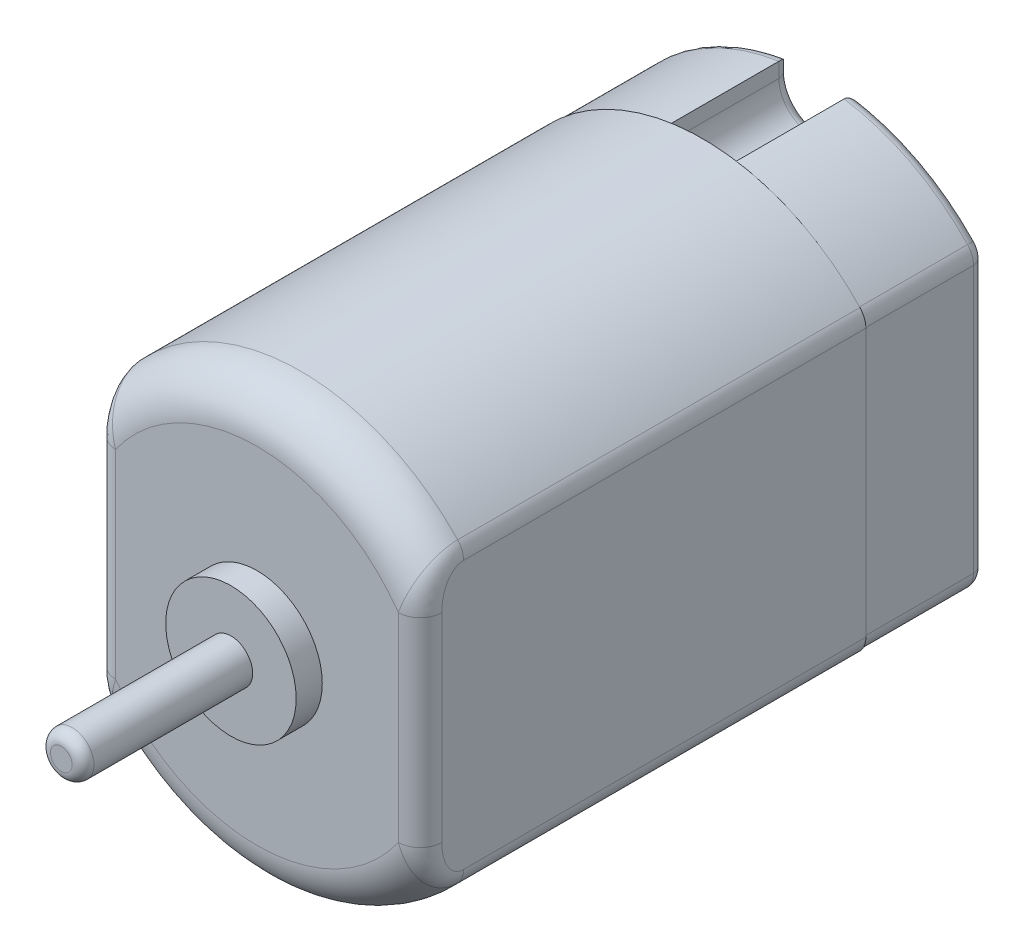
ISO-10303-21;
HEADER;
FILE_DESCRIPTION(('STEP AP214'),'2;1');
FILE_NAME('part.step','',(''),(''),'','','');
FILE_SCHEMA(('AUTOMOTIVE_DESIGN { 1 0 10303 214 1 1 1 1 }'));
ENDSEC;
DATA;
#1=APPLICATION_CONTEXT('core data for automotive mechanical design processes');
#2=APPLICATION_PROTOCOL_DEFINITION('international standard','automotive_design',2000,#1);
#3=PRODUCT_CONTEXT('',#1,'mechanical');
#4=PRODUCT('Part','Part','',(#3));
#5=PRODUCT_RELATED_PRODUCT_CATEGORY('part','',(#4));
#6=PRODUCT_DEFINITION_FORMATION('','',#4);
#7=PRODUCT_DEFINITION_CONTEXT('part definition',#1,'design');
#8=PRODUCT_DEFINITION('design','',#6,#7);
#9=PRODUCT_DEFINITION_SHAPE('','',#8);
#10=(LENGTH_UNIT() NAMED_UNIT(*) SI_UNIT(.MILLI.,.METRE.));
#11=(NAMED_UNIT(*) PLANE_ANGLE_UNIT() SI_UNIT($,.RADIAN.));
#12=(NAMED_UNIT(*) SI_UNIT($,.STERADIAN.) SOLID_ANGLE_UNIT());
#13=UNCERTAINTY_MEASURE_WITH_UNIT(LENGTH_MEASURE(1.E-05),#10,'distance_accuracy_value','');
#14=(GEOMETRIC_REPRESENTATION_CONTEXT(3) GLOBAL_UNCERTAINTY_ASSIGNED_CONTEXT((#13)) GLOBAL_UNIT_ASSIGNED_CONTEXT((#10,
#11,#12)) REPRESENTATION_CONTEXT('',''));
#15=CARTESIAN_POINT('',(0.,0.,0.));
#16=DIRECTION('',(0.,0.,1.));
#17=DIRECTION('',(1.,0.,0.));
#18=AXIS2_PLACEMENT_3D('',#15,#16,#17);
#19=CARTESIAN_POINT('',(6.45,6.13249541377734,-5.5));
#20=DIRECTION('',(0.,0.,1.));
#21=DIRECTION('',(1.,0.,0.));
#22=AXIS2_PLACEMENT_3D('',#19,#20,#21);
#23=PLANE('',#22);
#24=CARTESIAN_POINT('',(-6.45,6.13249541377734,-5.5));
#25=DIRECTION('',(0.,0.,1.));
#26=DIRECTION('',(1.,0.,0.));
#27=AXIS2_PLACEMENT_3D('',#24,#25,#26);
#28=CIRCLE('',#27,0.5);
#29=CARTESIAN_POINT('',(-6.95,6.13249541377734,-5.5));
#30=VERTEX_POINT('',#29);
#31=CARTESIAN_POINT('',(-6.8123595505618,6.47701762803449,-5.5));
#32=VERTEX_POINT('',#31);
#33=EDGE_CURVE('E1449',#30,#32,#28,.F.);
#34=ORIENTED_EDGE('',*,*,#33,.T.);
#35=CARTESIAN_POINT('',(0.,0.,-5.5));
#36=DIRECTION('',(0.,0.,1.));
#37=DIRECTION('',(1.,0.,0.));
#38=AXIS2_PLACEMENT_3D('',#35,#36,#37);
#39=CIRCLE('',#38,9.4);
#40=CARTESIAN_POINT('',(-2.,9.18477000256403,-5.5));
#41=VERTEX_POINT('',#40);
#42=EDGE_CURVE('E1422',#32,#41,#39,.F.);
#43=ORIENTED_EDGE('',*,*,#42,.T.);
#44=DIRECTION('',(0.,-1.,0.));
#45=VECTOR('',#44,1.);
#46=CARTESIAN_POINT('',(-2.,6.13249541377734,-5.5));
#47=LINE('',#46,#45);
#48=CARTESIAN_POINT('',(-2.,9.1,-5.5));
#49=VERTEX_POINT('',#48);
#50=EDGE_CURVE('E1458',#41,#49,#47,.T.);
#51=ORIENTED_EDGE('',*,*,#50,.T.);
#52=CARTESIAN_POINT('',(0.,9.1,-5.5));
#53=DIRECTION('',(0.,0.,1.));
#54=DIRECTION('',(1.,0.,0.));
#55=AXIS2_PLACEMENT_3D('',#52,#53,#54);
#56=CIRCLE('',#55,2.);
#57=CARTESIAN_POINT('',(2.,9.1,-5.5));
#58=VERTEX_POINT('',#57);
#59=EDGE_CURVE('E1463',#49,#58,#56,.T.);
#60=ORIENTED_EDGE('',*,*,#59,.T.);
#61=DIRECTION('',(0.,1.,0.));
#62=VECTOR('',#61,1.);
#63=CARTESIAN_POINT('',(2.,6.13249541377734,-5.5));
#64=LINE('',#63,#62);
#65=CARTESIAN_POINT('',(2.,9.18477000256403,-5.5));
#66=VERTEX_POINT('',#65);
#67=EDGE_CURVE('E1466',#58,#66,#64,.T.);
#68=ORIENTED_EDGE('',*,*,#67,.T.);
#69=CARTESIAN_POINT('',(0.,0.,-5.5));
#70=DIRECTION('',(0.,0.,1.));
#71=DIRECTION('',(1.,0.,0.));
#72=AXIS2_PLACEMENT_3D('',#69,#70,#71);
#73=CIRCLE('',#72,9.4);
#74=CARTESIAN_POINT('',(6.8123595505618,6.47701762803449,-5.5));
#75=VERTEX_POINT('',#74);
#76=EDGE_CURVE('E1412',#66,#75,#73,.F.);
#77=ORIENTED_EDGE('',*,*,#76,.T.);
#78=CARTESIAN_POINT('',(6.45,6.13249541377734,-5.5));
#79=DIRECTION('',(0.,0.,1.));
#80=DIRECTION('',(1.,0.,0.));
#81=AXIS2_PLACEMENT_3D('',#78,#79,#80);
#82=CIRCLE('',#81,0.5);
#83=CARTESIAN_POINT('',(6.95,6.13249541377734,-5.5));
#84=VERTEX_POINT('',#83);
#85=EDGE_CURVE('E1470',#75,#84,#82,.F.);
#86=ORIENTED_EDGE('',*,*,#85,.T.);
#87=DIRECTION('',(0.,-1.,0.));
#88=VECTOR('',#87,1.);
#89=CARTESIAN_POINT('',(6.95,6.13249541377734,-5.5));
#90=LINE('',#89,#88);
#91=CARTESIAN_POINT('',(6.95,-6.13249541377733,-5.5));
#92=VERTEX_POINT('',#91);
#93=EDGE_CURVE('E1472',#84,#92,#90,.T.);
#94=ORIENTED_EDGE('',*,*,#93,.T.);
#95=CARTESIAN_POINT('',(6.45,-6.13249541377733,-5.5));
#96=DIRECTION('',(0.,0.,1.));
#97=DIRECTION('',(1.,0.,0.));
#98=AXIS2_PLACEMENT_3D('',#95,#96,#97);
#99=CIRCLE('',#98,0.499999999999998);
#100=CARTESIAN_POINT('',(6.81235955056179,-6.47701762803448,-5.5));
#101=VERTEX_POINT('',#100);
#102=EDGE_CURVE('E1390',#92,#101,#99,.F.);
#103=ORIENTED_EDGE('',*,*,#102,.T.);
#104=CARTESIAN_POINT('',(0.,0.,-5.5));
#105=DIRECTION('',(0.,0.,1.));
#106=DIRECTION('',(1.,0.,0.));
#107=AXIS2_PLACEMENT_3D('',#104,#105,#106);
#108=CIRCLE('',#107,9.4);
#109=CARTESIAN_POINT('',(2.,-9.18477000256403,-5.5));
#110=VERTEX_POINT('',#109);
#111=EDGE_CURVE('E536',#101,#110,#108,.F.);
#112=ORIENTED_EDGE('',*,*,#111,.T.);
#113=DIRECTION('',(0.,1.,0.));
#114=VECTOR('',#113,1.);
#115=CARTESIAN_POINT('',(2.,6.13249541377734,-5.5));
#116=LINE('',#115,#114);
#117=CARTESIAN_POINT('',(2.,-9.1,-5.5));
#118=VERTEX_POINT('',#117);
#119=EDGE_CURVE('E1346',#110,#118,#116,.T.);
#120=ORIENTED_EDGE('',*,*,#119,.T.);
#121=CARTESIAN_POINT('',(0.,-9.1,-5.5));
#122=DIRECTION('',(0.,0.,1.));
#123=DIRECTION('',(1.,0.,0.));
#124=AXIS2_PLACEMENT_3D('',#121,#122,#123);
#125=CIRCLE('',#124,2.);
#126=CARTESIAN_POINT('',(-2.,-9.1,-5.5));
#127=VERTEX_POINT('',#126);
#128=EDGE_CURVE('E1342',#118,#127,#125,.T.);
#129=ORIENTED_EDGE('',*,*,#128,.T.);
#130=DIRECTION('',(0.,-1.,0.));
#131=VECTOR('',#130,1.);
#132=CARTESIAN_POINT('',(-2.,6.13249541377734,-5.5));
#133=LINE('',#132,#131);
#134=CARTESIAN_POINT('',(-2.,-9.18477000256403,-5.5));
#135=VERTEX_POINT('',#134);
#136=EDGE_CURVE('E1461',#127,#135,#133,.T.);
#137=ORIENTED_EDGE('',*,*,#136,.T.);
#138=CARTESIAN_POINT('',(0.,0.,-5.5));
#139=DIRECTION('',(0.,0.,1.));
#140=DIRECTION('',(1.,0.,0.));
#141=AXIS2_PLACEMENT_3D('',#138,#139,#140);
#142=CIRCLE('',#141,9.4);
#143=CARTESIAN_POINT('',(-6.81235955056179,-6.47701762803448,-5.5));
#144=VERTEX_POINT('',#143);
#145=EDGE_CURVE('E1456',#135,#144,#142,.F.);
#146=ORIENTED_EDGE('',*,*,#145,.T.);
#147=CARTESIAN_POINT('',(-6.45,-6.13249541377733,-5.5));
#148=DIRECTION('',(0.,0.,1.));
#149=DIRECTION('',(1.,0.,0.));
#150=AXIS2_PLACEMENT_3D('',#147,#148,#149);
#151=CIRCLE('',#150,0.499999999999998);
#152=CARTESIAN_POINT('',(-6.95,-6.13249541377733,-5.5));
#153=VERTEX_POINT('',#152);
#154=EDGE_CURVE('E1452',#144,#153,#151,.F.);
#155=ORIENTED_EDGE('',*,*,#154,.T.);
#156=DIRECTION('',(0.,1.,0.));
#157=VECTOR('',#156,1.);
#158=CARTESIAN_POINT('',(-6.95,6.13249541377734,-5.5));
#159=LINE('',#158,#157);
#160=EDGE_CURVE('E1442',#153,#30,#159,.T.);
#161=ORIENTED_EDGE('',*,*,#160,.T.);
#162=EDGE_LOOP('',(#34,#43,#51,#60,#68,#77,#86,#94,#103,#112,#120,#129,#137,#146,#155,#161));
#163=FACE_BOUND('',#162,.T.);
#164=CARTESIAN_POINT('',(0.,0.,-5.5));
#165=DIRECTION('',(0.,0.,-1.));
#166=DIRECTION('',(-1.,0.,0.));
#167=AXIS2_PLACEMENT_3D('',#164,#165,#166);
#168=CIRCLE('',#167,4.9);
#169=CARTESIAN_POINT('',(-4.,2.83019433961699,-5.5));
#170=VERTEX_POINT('',#169);
#171=CARTESIAN_POINT('',(-4.,-2.83019433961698,-5.5));
#172=VERTEX_POINT('',#171);
#173=EDGE_CURVE('E291',#170,#172,#168,.T.);
#174=ORIENTED_EDGE('',*,*,#173,.F.);
#175=DIRECTION('',(0.,1.,0.));
#176=VECTOR('',#175,1.);
#177=CARTESIAN_POINT('',(-4.,2.83019433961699,-5.5));
#178=LINE('',#177,#176);
#179=EDGE_CURVE('E296',#172,#170,#178,.T.);
#180=ORIENTED_EDGE('',*,*,#179,.F.);
#181=EDGE_LOOP('',(#174,#180));
#182=FACE_BOUND('',#181,.T.);
#183=ADVANCED_FACE('F37',(#163,#182),#23,.F.);
#184=CARTESIAN_POINT('',(0.,0.,20.5));
#185=DIRECTION('',(0.,0.,-1.));
#186=DIRECTION('',(-1.,0.,0.));
#187=AXIS2_PLACEMENT_3D('',#184,#185,#186);
#188=CYLINDRICAL_SURFACE('',#187,9.95);
#189=CARTESIAN_POINT('',(0.,0.,18.5));
#190=DIRECTION('',(0.,0.,1.));
#191=DIRECTION('',(1.,0.,0.));
#192=AXIS2_PLACEMENT_3D('',#189,#190,#191);
#193=CIRCLE('',#192,9.95);
#194=CARTESIAN_POINT('',(7.22625698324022,-6.83986184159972,18.5));
#195=VERTEX_POINT('',#194);
#196=CARTESIAN_POINT('',(-7.22625698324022,-6.83986184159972,18.5));
#197=VERTEX_POINT('',#196);
#198=EDGE_CURVE('E412',#195,#197,#193,.F.);
#199=ORIENTED_EDGE('',*,*,#198,.T.);
#200=DIRECTION('',(0.,0.,-1.));
#201=VECTOR('',#200,1.);
#202=CARTESIAN_POINT('',(-7.22625698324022,-6.83986184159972,20.5));
#203=LINE('',#202,#201);
#204=CARTESIAN_POINT('',(-7.22625698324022,-6.83986184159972,0.));
#205=VERTEX_POINT('',#204);
#206=EDGE_CURVE('E820',#197,#205,#203,.T.);
#207=ORIENTED_EDGE('',*,*,#206,.T.);
#208=CARTESIAN_POINT('',(0.,0.,0.));
#209=DIRECTION('',(0.,0.,1.));
#210=DIRECTION('',(1.,0.,0.));
#211=AXIS2_PLACEMENT_3D('',#208,#209,#210);
#212=CIRCLE('',#211,9.95);
#213=CARTESIAN_POINT('',(7.22625698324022,-6.83986184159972,0.));
#214=VERTEX_POINT('',#213);
#215=EDGE_CURVE('E404',#205,#214,#212,.T.);
#216=ORIENTED_EDGE('',*,*,#215,.T.);
#217=DIRECTION('',(0.,0.,-1.));
#218=VECTOR('',#217,1.);
#219=CARTESIAN_POINT('',(7.22625698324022,-6.83986184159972,20.5));
#220=LINE('',#219,#218);
#221=EDGE_CURVE('E822',#214,#195,#220,.F.);
#222=ORIENTED_EDGE('',*,*,#221,.T.);
#223=EDGE_LOOP('',(#199,#207,#216,#222));
#224=FACE_BOUND('',#223,.T.);
#225=ADVANCED_FACE('F688',(#224),#188,.T.);
#226=CARTESIAN_POINT('',(0.,0.,18.5));
#227=DIRECTION('',(0.,0.,1.));
#228=DIRECTION('',(1.,0.,0.));
#229=AXIS2_PLACEMENT_3D('',#226,#227,#228);
#230=TOROIDAL_SURFACE('',#229,7.95,2.);
#231=CARTESIAN_POINT('',(-7.22625698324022,6.83986184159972,18.5));
#232=VERTEX_POINT('',#231);
#233=CARTESIAN_POINT('',(7.22625698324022,6.83986184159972,18.5));
#234=VERTEX_POINT('',#233);
#235=EDGE_CURVE('E416',#232,#234,#193,.F.);
#236=ORIENTED_EDGE('',*,*,#235,.F.);
#237=CARTESIAN_POINT('',(-7.5,6.104345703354,18.2452550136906));
#238=CARTESIAN_POINT('',(-7.5,6.29074472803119,18.1735252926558));
#239=CARTESIAN_POINT('',(-7.42328081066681,6.46284337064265,18.1072986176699));
#240=CARTESIAN_POINT('',(-7.34656162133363,6.63494201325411,18.041071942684));
#241=CARTESIAN_POINT('',(-7.20489491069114,6.76633373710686,17.9905100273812));
#242=CARTESIAN_POINT('',(-7.5,6.11216233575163,18.2655634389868));
#243=CARTESIAN_POINT('',(-7.5,6.29943631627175,18.1996539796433));
#244=CARTESIAN_POINT('',(-7.42422239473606,6.47252210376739,18.1387461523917));
#245=CARTESIAN_POINT('',(-7.34844437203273,6.64560357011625,18.0778222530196));
#246=CARTESIAN_POINT('',(-7.20837246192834,6.77826426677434,18.0311268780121));
#247=CARTESIAN_POINT('',(-7.5,6.11909511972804,18.286204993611));
#248=CARTESIAN_POINT('',(-7.5,6.30714682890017,18.2261784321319));
#249=CARTESIAN_POINT('',(-7.42505546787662,6.48110696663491,18.170655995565));
#250=CARTESIAN_POINT('',(-7.35011067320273,6.65506438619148,18.1151213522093));
#251=CARTESIAN_POINT('',(-7.21145422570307,6.78885518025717,18.0724099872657));
#252=CARTESIAN_POINT('',(-7.5,6.1310853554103,18.328033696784));
#253=CARTESIAN_POINT('',(-7.5,6.32048004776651,18.2798625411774));
#254=CARTESIAN_POINT('',(-7.42649402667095,6.4959550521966,18.2352375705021));
#255=CARTESIAN_POINT('',(-7.35298777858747,6.67142722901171,18.1906006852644));
#256=CARTESIAN_POINT('',(-7.21678130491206,6.80718244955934,18.1560673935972));
#257=CARTESIAN_POINT('',(-7.5,6.13614205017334,18.3492210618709));
#258=CARTESIAN_POINT('',(-7.5,6.32610348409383,18.3070254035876));
#259=CARTESIAN_POINT('',(-7.42709942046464,6.50221733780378,18.2679096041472));
#260=CARTESIAN_POINT('',(-7.35419874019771,6.67833015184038,18.228785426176));
#261=CARTESIAN_POINT('',(-7.21902628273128,6.81491765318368,18.1984421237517));
#262=CARTESIAN_POINT('',(-7.5,6.14829194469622,18.4132059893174));
#263=CARTESIAN_POINT('',(-7.5,6.33961078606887,18.3889769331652));
#264=CARTESIAN_POINT('',(-7.42855289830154,6.51726424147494,18.3664937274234));
#265=CARTESIAN_POINT('',(-7.35710526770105,6.69491221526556,18.3439777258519));
#266=CARTESIAN_POINT('',(-7.22441893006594,6.8335084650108,18.326411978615));
#267=CARTESIAN_POINT('',(-7.5,6.15243618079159,18.4566088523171));
#268=CARTESIAN_POINT('',(-7.5,6.34422047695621,18.4445030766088));
#269=CARTESIAN_POINT('',(-7.42904681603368,6.52239711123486,18.433255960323));
#270=CARTESIAN_POINT('',(-7.35809362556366,6.70057368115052,18.4220094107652));
#271=CARTESIAN_POINT('',(-7.22625594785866,6.83985818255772,18.4132177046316));
#272=CARTESIAN_POINT('',(-7.5,6.15244090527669,18.5434682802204));
#273=CARTESIAN_POINT('',(-7.5,6.34422578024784,18.5555955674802));
#274=CARTESIAN_POINT('',(-7.42904736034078,6.52240296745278,18.5668626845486));
#275=CARTESIAN_POINT('',(-7.35809472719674,6.70058021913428,18.578129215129));
#276=CARTESIAN_POINT('',(-7.22625802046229,6.83986550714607,18.5869365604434));
#277=CARTESIAN_POINT('',(-7.5,6.1482866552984,18.5869248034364));
#278=CARTESIAN_POINT('',(-7.5,6.33960499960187,18.6111903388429));
#279=CARTESIAN_POINT('',(-7.4285522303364,6.51725769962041,18.6337071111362));
#280=CARTESIAN_POINT('',(-7.3571039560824,6.69490515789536,18.6562572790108));
#281=CARTESIAN_POINT('',(-7.22441654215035,6.83350053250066,18.6738496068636));
#282=CARTESIAN_POINT('',(-7.5,6.13203725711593,18.6722923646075));
#283=CARTESIAN_POINT('',(-7.5,6.3215377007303,18.7205430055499));
#284=CARTESIAN_POINT('',(-7.42660840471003,6.49713379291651,18.7652376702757));
#285=CARTESIAN_POINT('',(-7.35321633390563,6.67272498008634,18.8099652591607));
#286=CARTESIAN_POINT('',(-7.2172044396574,6.80863665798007,18.844584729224));
#287=CARTESIAN_POINT('',(-7.5,6.11994462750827,18.7142038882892));
#288=CARTESIAN_POINT('',(-7.5,6.30808505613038,18.7743276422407));
#289=CARTESIAN_POINT('',(-7.4251600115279,6.4821582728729,18.8299244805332));
#290=CARTESIAN_POINT('',(-7.35031816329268,6.65621234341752,18.8855827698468));
#291=CARTESIAN_POINT('',(-7.21183493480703,6.79014160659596,18.9284077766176));
#292=CARTESIAN_POINT('',(-7.5,6.08884312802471,18.795035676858));
#293=CARTESIAN_POINT('',(-7.5,6.27349471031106,18.8783501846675));
#294=CARTESIAN_POINT('',(-7.42141321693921,6.44364776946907,18.9550905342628));
#295=CARTESIAN_POINT('',(-7.3428246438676,6.61378246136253,19.0318913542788));
#296=CARTESIAN_POINT('',(-7.19799775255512,6.7426729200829,19.090071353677));
#297=CARTESIAN_POINT('',(-7.5,6.06987743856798,18.8339728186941));
#298=CARTESIAN_POINT('',(-7.5,6.25238970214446,18.9286282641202));
#299=CARTESIAN_POINT('',(-7.41912012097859,6.4201662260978,19.0155932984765));
#300=CARTESIAN_POINT('',(-7.33823654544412,6.58790520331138,19.1026386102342));
#301=CARTESIAN_POINT('',(-7.18954941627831,6.7137647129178,19.1679456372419));
#302=CARTESIAN_POINT('',(-7.5,6.02617071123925,18.9084573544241));
#303=CARTESIAN_POINT('',(-7.5,6.20375818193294,19.0252245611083));
#304=CARTESIAN_POINT('',(-7.41379605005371,6.36606270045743,19.1318909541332));
#305=CARTESIAN_POINT('',(-7.32758840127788,6.52832961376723,19.2386386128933));
#306=CARTESIAN_POINT('',(-7.17003227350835,6.64732694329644,19.3169147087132));
#307=CARTESIAN_POINT('',(-7.5,6.00142357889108,18.9440011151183));
#308=CARTESIAN_POINT('',(-7.5,6.17620658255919,19.0715515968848));
#309=CARTESIAN_POINT('',(-7.41076429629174,6.33543318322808,19.1876807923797));
#310=CARTESIAN_POINT('',(-7.32152270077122,6.49460066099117,19.3039039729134));
#311=CARTESIAN_POINT('',(-7.15896070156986,6.60978828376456,19.3880022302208));
#312=CARTESIAN_POINT('',(-7.5,5.9364091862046,19.0249157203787));
#313=CARTESIAN_POINT('',(-7.5,6.10379778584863,19.177681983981));
#314=CARTESIAN_POINT('',(-7.40272797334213,6.25498253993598,19.3155127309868));
#315=CARTESIAN_POINT('',(-7.3054444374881,6.4060522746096,19.4535261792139));
#316=CARTESIAN_POINT('',(-7.12979174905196,6.51149529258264,19.5498314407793));
#317=CARTESIAN_POINT('',(-7.5,5.89390411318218,19.0684843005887));
#318=CARTESIAN_POINT('',(-7.5,6.0564286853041,19.2353690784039));
#319=CARTESIAN_POINT('',(-7.39742049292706,6.20239877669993,19.3850590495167));
#320=CARTESIAN_POINT('',(-7.29482330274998,6.34819638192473,19.5349447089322));
#321=CARTESIAN_POINT('',(-7.11066007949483,6.44747790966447,19.6369686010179));
#322=CARTESIAN_POINT('',(-7.5,5.80243439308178,19.1483144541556));
#323=CARTESIAN_POINT('',(-7.5,5.9544782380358,19.3423156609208));
#324=CARTESIAN_POINT('',(-7.3858259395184,6.08928016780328,19.5140900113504));
#325=CARTESIAN_POINT('',(-7.27163402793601,6.22390790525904,19.686064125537));
#326=CARTESIAN_POINT('',(-7.06930775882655,6.31049930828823,19.7966289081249));
#327=CARTESIAN_POINT('',(-7.5,5.75345080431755,19.1845537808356));
#328=CARTESIAN_POINT('',(-7.5,5.89982747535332,19.3915505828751));
#329=CARTESIAN_POINT('',(-7.37953598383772,6.02872200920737,19.57354393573));
#330=CARTESIAN_POINT('',(-7.25904823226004,6.15739200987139,19.7557314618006));
#331=CARTESIAN_POINT('',(-7.04707803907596,6.23751190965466,19.8691075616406));
#332=CARTESIAN_POINT('',(-7.5,5.66475475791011,19.2413663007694));
#333=CARTESIAN_POINT('',(-7.5,5.80087740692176,19.469969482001));
#334=CARTESIAN_POINT('',(-7.36795706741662,5.91910743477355,19.6683507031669));
#335=CARTESIAN_POINT('',(-7.23590126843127,6.03721553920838,19.8668373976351));
#336=CARTESIAN_POINT('',(-7.00665080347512,6.10620210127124,19.9827326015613));
#337=CARTESIAN_POINT('',(-7.5,5.62604559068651,19.2635417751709));
#338=CARTESIAN_POINT('',(-7.5,5.75764125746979,19.5010253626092));
#339=CARTESIAN_POINT('',(-7.36284738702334,5.87128076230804,19.7059061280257));
#340=CARTESIAN_POINT('',(-7.22567972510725,5.98478127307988,19.910886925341));
#341=CARTESIAN_POINT('',(-6.98895524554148,6.04914817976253,20.0270835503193));
#342=CARTESIAN_POINT('',(-7.5,5.54690656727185,19.3043867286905));
#343=CARTESIAN_POINT('',(-7.5,5.66920396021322,19.5591276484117));
#344=CARTESIAN_POINT('',(-7.35226896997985,5.77352640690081,19.7762043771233));
#345=CARTESIAN_POINT('',(-7.20452286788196,5.87770950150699,19.993381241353));
#346=CARTESIAN_POINT('',(-6.95266887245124,5.93309022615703,20.1087734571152));
#347=CARTESIAN_POINT('',(-7.5,5.50647940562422,19.3230614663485));
#348=CARTESIAN_POINT('',(-7.5,5.62399063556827,19.5861749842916));
#349=CARTESIAN_POINT('',(-7.34680078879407,5.72360201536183,19.8089544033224));
#350=CARTESIAN_POINT('',(-7.19358431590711,5.82305748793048,20.0318274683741));
#351=CARTESIAN_POINT('',(-6.93407945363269,5.87408927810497,20.146122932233));
#352=CARTESIAN_POINT('',(-7.5,5.38307510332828,19.3743369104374));
#353=CARTESIAN_POINT('',(-7.5,5.48568408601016,19.6620664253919));
#354=CARTESIAN_POINT('',(-7.32988809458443,5.57124419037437,19.9007500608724));
#355=CARTESIAN_POINT('',(-7.15970698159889,5.65618165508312,20.139809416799));
#356=CARTESIAN_POINT('',(-6.87717451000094,5.69495940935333,20.2486738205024));
#357=CARTESIAN_POINT('',(-7.5,5.29808362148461,19.4021225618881));
#358=CARTESIAN_POINT('',(-7.5,5.39038683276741,19.7052965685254));
#359=CARTESIAN_POINT('',(-7.31794947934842,5.4663601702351,19.9532303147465));
#360=CARTESIAN_POINT('',(-7.13581315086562,5.54160099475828,20.2014732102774));
#361=CARTESIAN_POINT('',(-6.83777172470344,5.572864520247,20.3042451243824));
#362=CARTESIAN_POINT('',(-7.5,5.10841870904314,19.4510795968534));
#363=CARTESIAN_POINT('',(-7.5,5.17727584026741,19.7867854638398));
#364=CARTESIAN_POINT('',(-7.29053501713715,5.23238381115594,20.0521066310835));
#365=CARTESIAN_POINT('',(-7.08094579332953,5.28643160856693,20.3178763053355));
#366=CARTESIAN_POINT('',(-6.74944452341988,5.30369404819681,20.4021591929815));
#367=CARTESIAN_POINT('',(-7.5,5.00315878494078,19.4698793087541));
#368=CARTESIAN_POINT('',(-7.5,5.05874952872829,19.8222370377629));
#369=CARTESIAN_POINT('',(-7.27482502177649,5.10258347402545,20.095282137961));
#370=CARTESIAN_POINT('',(-7.04949796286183,5.14520558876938,20.3686457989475));
#371=CARTESIAN_POINT('',(-6.70017023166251,5.15642293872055,20.4397586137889));
#372=CARTESIAN_POINT('',(-7.5,4.79105038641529,19.49435072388));
#373=CARTESIAN_POINT('',(-7.5,4.81929717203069,19.8786940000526));
#374=CARTESIAN_POINT('',(-7.24200044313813,4.84101164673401,20.1639090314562));
#375=CARTESIAN_POINT('',(-6.9838465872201,4.86149647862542,20.4494460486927));
#376=CARTESIAN_POINT('',(-6.60058925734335,4.86437864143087,20.488701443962));
#377=CARTESIAN_POINT('',(-7.5,4.68419965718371,19.500001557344));
#378=CARTESIAN_POINT('',(-7.5,4.6982376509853,19.8995651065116));
#379=CARTESIAN_POINT('',(-7.22488367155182,4.70923735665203,20.1893321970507));
#380=CARTESIAN_POINT('',(-6.94958328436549,4.71887275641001,20.4792839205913));
#381=CARTESIAN_POINT('',(-6.55028106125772,4.71960978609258,20.5000031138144));
#382=CARTESIAN_POINT('',(-7.5,4.49248199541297,19.499998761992));
#383=CARTESIAN_POINT('',(-7.5,4.48042095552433,19.9259676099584));
#384=CARTESIAN_POINT('',(-7.19297507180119,4.47257831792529,20.2212366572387));
#385=CARTESIAN_POINT('',(-6.88583259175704,4.46386316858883,20.5166227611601));
#386=CARTESIAN_POINT('',(-6.46002915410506,4.46433277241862,20.4999975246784));
#387=CARTESIAN_POINT('',(-7.5,4.40759991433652,19.4964255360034));
#388=CARTESIAN_POINT('',(-7.5,4.38351581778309,19.9337242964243));
#389=CARTESIAN_POINT('',(-7.17842620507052,4.36772043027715,20.230533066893));
#390=CARTESIAN_POINT('',(-6.85671809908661,4.35098602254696,20.5273853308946));
#391=CARTESIAN_POINT('',(-6.42007545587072,4.35288637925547,20.4928510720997));
#392=CARTESIAN_POINT('',(-7.5,4.23830961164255,19.4828099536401));
#393=CARTESIAN_POINT('',(-7.5,4.1894004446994,19.9422586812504));
#394=CARTESIAN_POINT('',(-7.1484693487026,4.15822238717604,20.2403311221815));
#395=CARTESIAN_POINT('',(-6.79680325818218,4.12609689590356,20.5384483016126));
#396=CARTESIAN_POINT('',(-6.34057635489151,4.13383985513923,20.4656199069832));
#397=CARTESIAN_POINT('',(-7.5,4.15390171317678,19.4727636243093));
#398=CARTESIAN_POINT('',(-7.5,4.09212635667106,19.9429712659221));
#399=CARTESIAN_POINT('',(-7.13306083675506,4.05358240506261,20.2408273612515));
#400=CARTESIAN_POINT('',(-6.76596774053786,4.01402277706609,20.5386505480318));
#401=CARTESIAN_POINT('',(-6.30103121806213,4.02624212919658,20.445527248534));
#402=CARTESIAN_POINT('',(-7.5,3.98664183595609,19.4467874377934));
#403=CARTESIAN_POINT('',(-7.5,3.89820275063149,19.9379795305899));
#404=CARTESIAN_POINT('',(-7.10147290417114,3.84555574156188,20.2336030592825));
#405=CARTESIAN_POINT('',(-6.70279125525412,3.79189283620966,20.529188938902));
#406=CARTESIAN_POINT('',(-6.22304233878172,3.81627832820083,20.3935748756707));
#407=CARTESIAN_POINT('',(-7.5,3.90378297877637,19.4309014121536));
#408=CARTESIAN_POINT('',(-7.5,3.80147922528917,19.9322579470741));
#409=CARTESIAN_POINT('',(-7.08529998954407,3.74216550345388,20.2259429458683));
#410=CARTESIAN_POINT('',(-6.67042209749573,3.68175535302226,20.5194978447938));
#411=CARTESIAN_POINT('',(-6.18459263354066,3.71387958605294,20.3618028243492));
#412=CARTESIAN_POINT('',(-7.5,3.73947028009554,19.393462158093));
#413=CARTESIAN_POINT('',(-7.5,3.60791627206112,19.9146002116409));
#414=CARTESIAN_POINT('',(-7.05201827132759,3.53585523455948,20.2025130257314));
#415=CARTESIAN_POINT('',(-6.603861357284,3.4627019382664,20.4903074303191));
#416=CARTESIAN_POINT('',(-6.1089001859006,3.51398803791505,20.286924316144));
#417=CARTESIAN_POINT('',(-7.5,3.65801471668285,19.3719164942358));
#418=CARTESIAN_POINT('',(-7.5,3.5109970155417,19.9025986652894));
#419=CARTESIAN_POINT('',(-7.03491074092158,3.43293476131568,20.1867540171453));
#420=CARTESIAN_POINT('',(-6.56962562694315,3.35370833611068,20.4707043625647));
#421=CARTESIAN_POINT('',(-6.07165590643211,3.41648888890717,20.2438329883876));
#422=CARTESIAN_POINT('',(-7.5,3.57739008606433,19.3476317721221));
#423=CARTESIAN_POINT('',(-7.5,3.41441329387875,19.8876164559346));
#424=CARTESIAN_POINT('',(-7.0172838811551,3.33010802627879,20.1669418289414));
#425=CARTESIAN_POINT('',(-6.5345677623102,3.24580275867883,20.4462672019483));
#426=CARTESIAN_POINT('',(-6.03516522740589,3.32156003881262,20.1952635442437));
#427=(BOUNDED_SURFACE() B_SPLINE_SURFACE(3,2,((#237,#238,#239,#240,#241),(#242,#243,#244,#245,
#246),(#247,#248,#249,#250,#251),(#252,#253,#254,#255,#256),(#257,#258,#259,#260,#261),(#262,
#263,#264,#265,#266),(#267,#268,#269,#270,#271),(#272,#273,#274,#275,#276),(#277,#278,#279,#280,
#281),(#282,#283,#284,#285,#286),(#287,#288,#289,#290,#291),(#292,#293,#294,#295,#296),(#297,
#298,#299,#300,#301),(#302,#303,#304,#305,#306),(#307,#308,#309,#310,#311),(#312,#313,#314,#315,
#316),(#317,#318,#319,#320,#321),(#322,#323,#324,#325,#326),(#327,#328,#329,#330,#331),(#332,
#333,#334,#335,#336),(#337,#338,#339,#340,#341),(#342,#343,#344,#345,#346),(#347,#348,#349,#350,
#351),(#352,#353,#354,#355,#356),(#357,#358,#359,#360,#361),(#362,#363,#364,#365,#366),(#367,
#368,#369,#370,#371),(#372,#373,#374,#375,#376),(#377,#378,#379,#380,#381),(#382,#383,#384,#385,
#386),(#387,#388,#389,#390,#391),(#392,#393,#394,#395,#396),(#397,#398,#399,#400,#401),(#402,
#403,#404,#405,#406),(#407,#408,#409,#410,#411),(#412,#413,#414,#415,#416),(#417,#418,#419,#420,
#421),(#422,#423,#424,#425,#426)),.UNSPECIFIED.,.F.,.F.,.F.) B_SPLINE_SURFACE_WITH_KNOTS((4,2,2,
2,2,2,2,2,2,2,2,2,2,2,2,2,2,2,4),(3,2,3),(0.,0.0652453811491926,0.130517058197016,
0.260481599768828,0.390677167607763,0.520831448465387,0.650181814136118,0.779669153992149,
0.961270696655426,1.14341544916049,1.27707143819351,1.41052502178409,1.67780900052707,
1.99760058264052,2.31789938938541,2.57252039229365,2.82729782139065,3.0802007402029,
3.33276733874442),(0.,0.5,1.),
.UNSPECIFIED.) GEOMETRIC_REPRESENTATION_ITEM() RATIONAL_B_SPLINE_SURFACE(((1.,0.980632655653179,
1.,0.980632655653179,1.),(1.,0.980872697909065,1.,0.980872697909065,1.),(1.,0.981084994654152,
1.,0.981084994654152,1.),(1.,0.981451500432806,1.,0.981451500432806,1.),(1.,0.98160568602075,1.,
0.98160568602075,1.),(1.,0.981975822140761,1.,0.981975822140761,1.),(1.,0.982101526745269,1.,
0.982101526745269,1.),(1.,0.982101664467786,1.,0.982101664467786,1.),(1.,0.981975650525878,1.,
0.981975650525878,1.),(1.,0.981480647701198,1.,0.981480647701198,1.),(1.,0.981111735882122,1.,
0.981111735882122,1.),(1.,0.980156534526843,1.,0.980156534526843,1.),(1.,0.979571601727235,1.,
0.979571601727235,1.),(1.,0.978211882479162,1.,0.978211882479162,1.),(1.,0.977436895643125,1.,
0.977436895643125,1.),(1.,0.97537963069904,1.,0.97537963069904,1.),(1.,0.974018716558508,1.,
0.974018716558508,1.),(1.,0.971038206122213,1.,0.971038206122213,1.),(1.,0.9694178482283,1.,
0.9694178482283,1.),(1.,0.96642647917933,1.,0.96642647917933,1.),(1.,0.965103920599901,1.,
0.965103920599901,1.),(1.,0.962359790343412,1.,0.962359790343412,1.),(1.,0.960938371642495,1.,
0.960938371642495,1.),(1.,0.95653158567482,1.,0.95653158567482,1.),(1.,0.953407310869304,1.,
0.953407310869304,1.),(1.,0.946193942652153,1.,0.946193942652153,1.),(1.,0.942035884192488,1.,
0.942035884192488,1.),(1.,0.933284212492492,1.,0.933284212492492,1.),(1.,0.928689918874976,1.,
0.928689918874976,1.),(1.,0.92005552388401,1.,0.92005552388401,1.),(1.,0.916094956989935,1.,
0.916094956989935,1.),(1.,0.907882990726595,1.,0.907882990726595,1.),(1.,0.903631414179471,1.,
0.903631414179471,1.),(1.,0.894849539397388,1.,0.894849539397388,1.),(1.,0.890321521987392,1.,
0.890321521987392,1.),(1.,0.880926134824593,1.,0.880926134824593,1.),(1.,0.876059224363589,1.,
0.876059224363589,1.),(1.,0.871000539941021,1.,0.871000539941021,1.))) REPRESENTATION_ITEM('') SURFACE());
#428=CARTESIAN_POINT('',(-7.20489491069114,6.76633373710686,17.9905100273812));
#429=CARTESIAN_POINT('',(-7.20837246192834,6.77826426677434,18.0311268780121));
#430=CARTESIAN_POINT('',(-7.21145422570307,6.78885518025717,18.0724099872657));
#431=CARTESIAN_POINT('',(-7.21678130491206,6.80718244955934,18.1560673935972));
#432=CARTESIAN_POINT('',(-7.21902628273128,6.81491765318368,18.1984421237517));
#433=CARTESIAN_POINT('',(-7.22441893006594,6.8335084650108,18.326411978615));
#434=CARTESIAN_POINT('',(-7.22625594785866,6.83985818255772,18.4132177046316));
#435=CARTESIAN_POINT('',(-7.22625802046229,6.83986550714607,18.5869365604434));
#436=CARTESIAN_POINT('',(-7.22441654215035,6.83350053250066,18.6738496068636));
#437=CARTESIAN_POINT('',(-7.2172044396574,6.80863665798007,18.844584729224));
#438=CARTESIAN_POINT('',(-7.21183493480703,6.79014160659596,18.9284077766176));
#439=CARTESIAN_POINT('',(-7.19799775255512,6.7426729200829,19.090071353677));
#440=CARTESIAN_POINT('',(-7.18954941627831,6.71376471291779,19.1679456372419));
#441=CARTESIAN_POINT('',(-7.17003227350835,6.64732694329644,19.3169147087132));
#442=CARTESIAN_POINT('',(-7.15896070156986,6.60978828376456,19.3880022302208));
#443=CARTESIAN_POINT('',(-7.12979174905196,6.51149529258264,19.5498314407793));
#444=CARTESIAN_POINT('',(-7.11066007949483,6.44747790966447,19.6369686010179));
#445=CARTESIAN_POINT('',(-7.06930775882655,6.31049930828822,19.7966289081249));
#446=CARTESIAN_POINT('',(-7.04707803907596,6.23751190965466,19.8691075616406));
#447=CARTESIAN_POINT('',(-7.00665080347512,6.10620210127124,19.9827326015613));
#448=CARTESIAN_POINT('',(-6.98895524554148,6.04914817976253,20.0270835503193));
#449=CARTESIAN_POINT('',(-6.95266887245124,5.93309022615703,20.1087734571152));
#450=CARTESIAN_POINT('',(-6.93407945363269,5.87408927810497,20.146122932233));
#451=CARTESIAN_POINT('',(-6.87717451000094,5.69495940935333,20.2486738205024));
#452=CARTESIAN_POINT('',(-6.83777172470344,5.572864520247,20.3042451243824));
#453=CARTESIAN_POINT('',(-6.74944452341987,5.30369404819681,20.4021591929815));
#454=CARTESIAN_POINT('',(-6.70017023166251,5.15642293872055,20.4397586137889));
#455=CARTESIAN_POINT('',(-6.60058925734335,4.86437864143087,20.488701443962));
#456=CARTESIAN_POINT('',(-6.55028106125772,4.71960978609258,20.5000031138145));
#457=CARTESIAN_POINT('',(-6.46002915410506,4.46433277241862,20.4999975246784));
#458=CARTESIAN_POINT('',(-6.42007545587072,4.35288637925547,20.4928510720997));
#459=CARTESIAN_POINT('',(-6.34057635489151,4.13383985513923,20.4656199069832));
#460=CARTESIAN_POINT('',(-6.30103121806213,4.02624212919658,20.445527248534));
#461=CARTESIAN_POINT('',(-6.22304233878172,3.81627832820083,20.3935748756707));
#462=CARTESIAN_POINT('',(-6.18459263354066,3.71387958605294,20.3618028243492));
#463=CARTESIAN_POINT('',(-6.1089001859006,3.51398803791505,20.286924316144));
#464=CARTESIAN_POINT('',(-6.07165590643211,3.41648888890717,20.2438329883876));
#465=CARTESIAN_POINT('',(-6.03516522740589,3.32156003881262,20.1952635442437));
#466=B_SPLINE_CURVE_WITH_KNOTS('',3,(#428,#429,#430,#431,#432,#433,#434,#435,#436,#437,#438,
#439,#440,#441,#442,#443,#444,#445,#446,#447,#448,#449,#450,#451,#452,#453,#454,#455,#456,#457,
#458,#459,#460,#461,#462,#463,#464,#465),.UNSPECIFIED.,.F.,.F.,(4,2,2,2,2,2,2,2,2,2,2,2,2,2,2,2,
2,2,4),(0.,0.0652453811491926,0.130517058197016,0.260481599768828,0.390677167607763,
0.520831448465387,0.650181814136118,0.779669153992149,0.961270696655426,1.14341544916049,
1.27707143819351,1.41052502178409,1.67780900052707,1.99760058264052,2.31789938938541,
2.57252039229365,2.82729782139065,3.0802007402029,3.33276733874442),.UNSPECIFIED.);
#467=CARTESIAN_POINT('',(-6.5,4.57739008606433,20.5));
#468=VERTEX_POINT('',#467);
#469=EDGE_CURVE('E809',#232,#468,#466,.T.);
#470=ORIENTED_EDGE('',*,*,#469,.T.);
#471=CARTESIAN_POINT('',(0.,0.,20.5));
#472=DIRECTION('',(0.,0.,1.));
#473=DIRECTION('',(1.,0.,0.));
#474=AXIS2_PLACEMENT_3D('',#471,#472,#473);
#475=CIRCLE('',#474,7.95);
#476=CARTESIAN_POINT('',(6.5,4.57739008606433,20.5));
#477=VERTEX_POINT('',#476);
#478=EDGE_CURVE('E411',#477,#468,#475,.T.);
#479=ORIENTED_EDGE('',*,*,#478,.F.);
#480=CARTESIAN_POINT('',(7.5,3.57739008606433,19.3476317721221));
#481=CARTESIAN_POINT('',(7.5,3.41441329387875,19.8876164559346));
#482=CARTESIAN_POINT('',(7.0172838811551,3.33010802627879,20.1669418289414));
#483=CARTESIAN_POINT('',(6.5345677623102,3.24580275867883,20.4462672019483));
#484=CARTESIAN_POINT('',(6.03516522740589,3.32156003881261,20.1952635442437));
#485=CARTESIAN_POINT('',(7.5,3.65733030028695,19.3717115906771));
#486=CARTESIAN_POINT('',(7.5,3.51018279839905,19.9024740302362));
#487=CARTESIAN_POINT('',(7.03476135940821,3.43206329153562,20.1865883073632));
#488=CARTESIAN_POINT('',(6.56933003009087,3.35279869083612,20.4705007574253));
#489=CARTESIAN_POINT('',(6.07134617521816,3.41568321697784,20.2434231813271));
#490=CARTESIAN_POINT('',(7.5,3.73808843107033,19.393097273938));
#491=CARTESIAN_POINT('',(7.5,3.6062817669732,19.9143987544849));
#492=CARTESIAN_POINT('',(7.05172816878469,3.53411018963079,20.2022470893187));
#493=CARTESIAN_POINT('',(6.60328386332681,3.46086387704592,20.4899781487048));
#494=CARTESIAN_POINT('',(6.10826841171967,3.51233429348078,20.2861945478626));
#495=CARTESIAN_POINT('',(7.5,3.90097263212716,19.4303104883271));
#496=CARTESIAN_POINT('',(7.5,3.79819232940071,19.932009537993));
#497=CARTESIAN_POINT('',(7.08474082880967,3.73864743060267,20.2256107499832));
#498=CARTESIAN_POINT('',(6.66930665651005,3.67802434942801,20.5190833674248));
#499=CARTESIAN_POINT('',(6.18329336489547,3.71043424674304,20.3606209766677));
#500=CARTESIAN_POINT('',(7.5,3.9831001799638,19.4461315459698));
#501=CARTESIAN_POINT('',(7.5,3.89408171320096,19.9377603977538));
#502=CARTESIAN_POINT('',(7.10078558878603,3.84113815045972,20.233306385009));
#503=CARTESIAN_POINT('',(6.70141895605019,3.78719508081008,20.5288140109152));
#504=CARTESIAN_POINT('',(6.22139740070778,3.81188855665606,20.3922630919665));
#505=CARTESIAN_POINT('',(7.5,4.15031110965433,19.4723087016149));
#506=CARTESIAN_POINT('',(7.5,4.08797585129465,19.9429728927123));
#507=CARTESIAN_POINT('',(7.13240062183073,4.04912849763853,20.2408113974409));
#508=CARTESIAN_POINT('',(6.7646443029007,4.00924669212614,20.5386149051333));
#509=CARTESIAN_POINT('',(6.29935072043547,4.02168004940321,20.4446174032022));
#510=CARTESIAN_POINT('',(7.5,4.2354173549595,19.4825199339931));
#511=CARTESIAN_POINT('',(7.5,4.18606805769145,19.9423424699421));
#512=CARTESIAN_POINT('',(7.14794933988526,4.15463984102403,20.2404209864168));
#513=CARTESIAN_POINT('',(6.79576073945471,4.12224687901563,20.5385442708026));
#514=CARTESIAN_POINT('',(6.33921986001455,4.13012541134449,20.4650398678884));
#515=CARTESIAN_POINT('',(7.5,4.40614446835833,19.4963644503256));
#516=CARTESIAN_POINT('',(7.5,4.38184722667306,19.9338582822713));
#517=CARTESIAN_POINT('',(7.17817665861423,4.36592262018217,20.2306929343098));
#518=CARTESIAN_POINT('',(6.8562165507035,4.34904260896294,20.5275712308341));
#519=CARTESIAN_POINT('',(6.41939030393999,4.3509760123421,20.4927289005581));
#520=CARTESIAN_POINT('',(7.5,4.4917651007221,19.5000005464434));
#521=CARTESIAN_POINT('',(7.5,4.47959957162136,19.9260699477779));
#522=CARTESIAN_POINT('',(7.19285562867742,4.47169392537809,20.221359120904));
#523=CARTESIAN_POINT('',(6.88559168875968,4.46290196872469,20.5167674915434));
#524=CARTESIAN_POINT('',(6.45969141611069,4.46337953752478,20.5000010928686));
#525=CARTESIAN_POINT('',(7.5,4.65242018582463,19.4999995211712));
#526=CARTESIAN_POINT('',(7.5,4.66241175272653,19.9039053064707));
#527=CARTESIAN_POINT('',(7.21959455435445,4.6700078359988,20.1946179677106));
#528=CARTESIAN_POINT('',(6.93909817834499,4.6769290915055,20.4854218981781));
#529=CARTESIAN_POINT('',(6.535320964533,4.67729343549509,20.4999990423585));
#530=CARTESIAN_POINT('',(7.5,4.72745362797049,19.4972066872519));
#531=CARTESIAN_POINT('',(7.5,4.74750932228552,19.8905164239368));
#532=CARTESIAN_POINT('',(7.23175383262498,4.76256788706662,20.1783525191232));
#533=CARTESIAN_POINT('',(6.96342719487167,4.77699844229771,20.4663279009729));
#534=CARTESIAN_POINT('',(6.5706476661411,4.77843071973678,20.4944133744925));
#535=CARTESIAN_POINT('',(7.5,4.87702370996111,19.4854116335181));
#536=CARTESIAN_POINT('',(7.5,4.91668981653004,19.8568324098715));
#537=CARTESIAN_POINT('',(7.25539650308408,4.94703886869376,20.137431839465));
#538=CARTESIAN_POINT('',(7.01071317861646,4.97676521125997,20.4181694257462));
#539=CARTESIAN_POINT('',(6.64096845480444,4.98238986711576,20.4708232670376));
#540=CARTESIAN_POINT('',(7.5,4.95156053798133,19.4764119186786));
#541=CARTESIAN_POINT('',(7.5,5.00081760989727,19.8365790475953));
#542=CARTESIAN_POINT('',(7.26688016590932,5.03895004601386,20.1127799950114));
#543=CARTESIAN_POINT('',(7.03369045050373,5.07650971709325,20.389165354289));
#544=CARTESIAN_POINT('',(6.67596267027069,5.08521103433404,20.4528238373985));
#545=CARTESIAN_POINT('',(7.5,5.09884139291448,19.4515345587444));
#546=CARTESIAN_POINT('',(7.5,5.16669111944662,19.7884423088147));
#547=CARTESIAN_POINT('',(7.28903918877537,5.22058195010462,20.0542708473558));
#548=CARTESIAN_POINT('',(7.07801016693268,5.27391364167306,20.3202795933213));
#549=CARTESIAN_POINT('',(6.74492235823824,5.29058039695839,20.4030691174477));
#550=CARTESIAN_POINT('',(7.5,5.17159535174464,19.4357170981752));
#551=CARTESIAN_POINT('',(7.5,5.24849403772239,19.7606646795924));
#552=CARTESIAN_POINT('',(7.29972068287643,5.3103147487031,20.0204950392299));
#553=CARTESIAN_POINT('',(7.09938257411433,5.37163011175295,20.2805486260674));
#554=CARTESIAN_POINT('',(6.77889411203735,5.39312325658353,20.3714341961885));
#555=CARTESIAN_POINT('',(7.5,5.31491810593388,19.3963058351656));
#556=CARTESIAN_POINT('',(7.5,5.40935020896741,19.6963251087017));
#557=CARTESIAN_POINT('',(7.32029845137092,5.4871365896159,19.9423928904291));
#558=CARTESIAN_POINT('',(7.14053871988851,5.56442317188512,20.1886814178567));
#559=CARTESIAN_POINT('',(6.84556788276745,5.59711551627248,20.2926116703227));
#560=CARTESIAN_POINT('',(7.5,5.38548974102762,19.3727226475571));
#561=CARTESIAN_POINT('',(7.5,5.48845917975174,19.659810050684));
#562=CARTESIAN_POINT('',(7.3301957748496,5.57422906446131,19.8980809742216));
#563=CARTESIAN_POINT('',(7.16034290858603,5.6595619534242,20.1366111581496));
#564=CARTESIAN_POINT('',(6.87827156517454,5.69856621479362,20.2454452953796));
#565=CARTESIAN_POINT('',(7.5,5.51469348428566,19.3200987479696));
#566=CARTESIAN_POINT('',(7.5,5.63310911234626,19.5817094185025));
#567=CARTESIAN_POINT('',(7.34794373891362,5.73374054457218,19.8034874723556));
#568=CARTESIAN_POINT('',(7.19585010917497,5.83403597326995,20.0254646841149));
#569=CARTESIAN_POINT('',(6.93787935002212,5.8859372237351,20.1401974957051));
#570=CARTESIAN_POINT('',(7.5,5.57373352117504,19.2920712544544));
#571=CARTESIAN_POINT('',(7.5,5.69913511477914,19.5413246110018));
#572=CARTESIAN_POINT('',(7.35589688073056,5.80665553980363,19.7545883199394));
#573=CARTESIAN_POINT('',(7.21176311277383,5.91388995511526,19.968072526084));
#574=CARTESIAN_POINT('',(6.96500493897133,5.97224521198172,20.0841425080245));
#575=CARTESIAN_POINT('',(7.5,5.68761450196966,19.2283449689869));
#576=CARTESIAN_POINT('',(7.5,5.82633646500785,19.451754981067));
#577=CARTESIAN_POINT('',(7.37098193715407,5.94735043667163,19.6462696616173));
#578=CARTESIAN_POINT('',(7.2419334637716,6.06808093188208,19.8410022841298));
#579=CARTESIAN_POINT('',(7.01710551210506,6.13986339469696,19.9566899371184));
#580=CARTESIAN_POINT('',(7.5,5.74245584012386,19.1926468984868));
#581=CARTESIAN_POINT('',(7.5,5.88756122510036,19.4025857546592));
#582=CARTESIAN_POINT('',(7.37811392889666,6.01513082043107,19.5868511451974));
#583=CARTESIAN_POINT('',(7.25620461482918,6.14247632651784,19.7713455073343));
#584=CARTESIAN_POINT('',(7.04208069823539,6.22117405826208,19.885293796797));
#585=CARTESIAN_POINT('',(7.5,5.83815515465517,19.1187454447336));
#586=CARTESIAN_POINT('',(7.5,5.99430607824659,19.3025117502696));
#587=CARTESIAN_POINT('',(7.39037757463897,6.13344990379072,19.4660707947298));
#588=CARTESIAN_POINT('',(7.28073823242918,6.2724303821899,19.6297963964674));
#589=CARTESIAN_POINT('',(7.08548057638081,6.36388489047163,19.7374908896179));
#590=CARTESIAN_POINT('',(7.5,5.87988383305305,19.0816804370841));
#591=CARTESIAN_POINT('',(7.5,6.04082761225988,19.2529474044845));
#592=CARTESIAN_POINT('',(7.3956491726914,6.18505873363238,19.4062766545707));
#593=CARTESIAN_POINT('',(7.29128614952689,6.32916909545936,19.5597696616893));
#594=CARTESIAN_POINT('',(7.10432858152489,6.42645526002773,19.6633608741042));
#595=CARTESIAN_POINT('',(7.5,5.95681014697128,19.0012469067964));
#596=CARTESIAN_POINT('',(7.5,6.12651453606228,19.1465232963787));
#597=CARTESIAN_POINT('',(7.40526431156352,6.28022375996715,19.2779718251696));
#598=CARTESIAN_POINT('',(7.31051649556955,6.43381300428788,19.4095811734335));
#599=CARTESIAN_POINT('',(7.13896079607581,6.54227224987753,19.5024938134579));
#600=CARTESIAN_POINT('',(7.5,5.99201584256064,18.9578862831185));
#601=CARTESIAN_POINT('',(7.5,6.16572835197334,19.0896651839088));
#602=CARTESIAN_POINT('',(7.40960899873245,6.32378989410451,19.2094720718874));
#603=CARTESIAN_POINT('',(7.31921059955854,6.48177677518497,19.3294211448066));
#604=CARTESIAN_POINT('',(7.15474878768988,6.59553037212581,19.4157725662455));
#605=CARTESIAN_POINT('',(7.5,6.04660700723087,18.8757296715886));
#606=CARTESIAN_POINT('',(7.5,6.22649631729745,18.9827064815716));
#607=CARTESIAN_POINT('',(7.41629235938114,6.39135856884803,19.0806916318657));
#608=CARTESIAN_POINT('',(7.33258025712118,6.55617561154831,19.1787630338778));
#609=CARTESIAN_POINT('',(7.17916628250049,6.67836017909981,19.2514593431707));
#610=CARTESIAN_POINT('',(7.5,6.06776967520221,18.8381177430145));
#611=CARTESIAN_POINT('',(7.5,6.25004981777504,18.9339902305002));
#612=CARTESIAN_POINT('',(7.41886248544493,6.41755728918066,19.0220536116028));
#613=CARTESIAN_POINT('',(7.33772254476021,6.58503991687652,19.1101859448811));
#614=CARTESIAN_POINT('',(7.18860721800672,6.71056476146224,19.176235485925));
#615=CARTESIAN_POINT('',(7.5,6.10359878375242,18.7599435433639));
#616=CARTESIAN_POINT('',(7.5,6.28990409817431,18.8331364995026));
#617=CARTESIAN_POINT('',(7.42319467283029,6.46191753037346,18.9006779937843));
#618=CARTESIAN_POINT('',(7.34638688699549,6.63390578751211,18.9682873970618));
#619=CARTESIAN_POINT('',(7.20456735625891,6.76517608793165,19.0198870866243));
#620=CARTESIAN_POINT('',(7.5,6.11827814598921,18.7193873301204));
#621=CARTESIAN_POINT('',(7.5,6.30623568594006,18.780989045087));
#622=CARTESIAN_POINT('',(7.42495834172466,6.48009503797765,18.8379488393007));
#623=CARTESIAN_POINT('',(7.34991577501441,6.65394503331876,18.8949516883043));
#624=CARTESIAN_POINT('',(7.21109237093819,6.78760231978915,18.9387746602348));
#625=CARTESIAN_POINT('',(7.5,6.13686036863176,18.6488707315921));
#626=CARTESIAN_POINT('',(7.5,6.32690086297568,18.6905246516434));
#627=CARTESIAN_POINT('',(7.42718592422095,6.50310678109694,18.7291358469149));
#628=CARTESIAN_POINT('',(7.35437142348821,6.67930828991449,18.7677687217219));
#629=CARTESIAN_POINT('',(7.21934583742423,6.81601413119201,18.7977414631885));
#630=CARTESIAN_POINT('',(7.5,6.14267856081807,18.6194067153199));
#631=CARTESIAN_POINT('',(7.5,6.33337129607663,18.6527804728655));
#632=CARTESIAN_POINT('',(7.42788146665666,6.5103123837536,18.6837423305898));
#633=CARTESIAN_POINT('',(7.355762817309,6.68725226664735,18.7147153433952));
#634=CARTESIAN_POINT('',(7.22192758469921,6.82491888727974,18.7388134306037));
#635=CARTESIAN_POINT('',(7.5,6.15047037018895,18.5599692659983));
#636=CARTESIAN_POINT('',(7.5,6.34203449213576,18.576704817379));
#637=CARTESIAN_POINT('',(7.42881234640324,6.51996239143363,18.5922440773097));
#638=CARTESIAN_POINT('',(7.35762458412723,6.69788916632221,18.6077942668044));
#639=CARTESIAN_POINT('',(7.22538433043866,6.83684703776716,18.6199385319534));
#640=CARTESIAN_POINT('',(7.5,6.15244313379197,18.5299957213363));
#641=CARTESIAN_POINT('',(7.5,6.34422837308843,18.5383642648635));
#642=CARTESIAN_POINT('',(7.42904758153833,6.52240573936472,18.5461391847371));
#643=CARTESIAN_POINT('',(7.3580951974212,6.70058346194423,18.5539138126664));
#644=CARTESIAN_POINT('',(7.22625894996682,6.83986912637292,18.5599914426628));
#645=CARTESIAN_POINT('',(7.5,6.15243190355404,18.4566515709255));
#646=CARTESIAN_POINT('',(7.5,6.34421554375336,18.4445577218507));
#647=CARTESIAN_POINT('',(7.4290463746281,6.52239179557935,18.4333217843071));
#648=CARTESIAN_POINT('',(7.35809269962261,6.70056753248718,18.4220862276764));
#649=CARTESIAN_POINT('',(7.22625414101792,6.83985131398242,18.4133031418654));
#650=CARTESIAN_POINT('',(7.5,6.1482956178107,18.4132568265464));
#651=CARTESIAN_POINT('',(7.5,6.33961483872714,18.3890419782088));
#652=CARTESIAN_POINT('',(7.42855334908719,6.51726878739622,18.3665719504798));
#653=CARTESIAN_POINT('',(7.35710616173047,6.69491717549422,18.3440691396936));
#654=CARTESIAN_POINT('',(7.22442057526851,6.83351403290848,18.3265136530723));
#655=CARTESIAN_POINT('',(7.5,6.13615497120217,18.3492732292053));
#656=CARTESIAN_POINT('',(7.5,6.3261178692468,18.3070922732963));
#657=CARTESIAN_POINT('',(7.42710096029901,6.50223334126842,18.2679900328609));
#658=CARTESIAN_POINT('',(7.35420182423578,6.67834781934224,18.2288794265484));
#659=CARTESIAN_POINT('',(7.21903200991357,6.81493745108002,18.1985464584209));
#660=CARTESIAN_POINT('',(7.5,6.13109601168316,18.3280719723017));
#661=CARTESIAN_POINT('',(7.5,6.32049190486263,18.2799116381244));
#662=CARTESIAN_POINT('',(7.42649530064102,6.49596824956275,18.2352966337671));
#663=CARTESIAN_POINT('',(7.35299032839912,6.67144178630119,18.1906697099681));
#664=CARTESIAN_POINT('',(7.21678603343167,6.80719875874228,18.1561439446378));
#665=CARTESIAN_POINT('',(7.5,6.11910037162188,18.2862222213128));
#666=CARTESIAN_POINT('',(7.5,6.30715265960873,18.2262005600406));
#667=CARTESIAN_POINT('',(7.42505610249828,6.4811134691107,18.1706826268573));
#668=CARTESIAN_POINT('',(7.35011194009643,6.65507153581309,18.1151524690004));
#669=CARTESIAN_POINT('',(7.21145656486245,6.78886318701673,18.0724444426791));
#670=CARTESIAN_POINT('',(7.5,6.11216499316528,18.2655733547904));
#671=CARTESIAN_POINT('',(7.5,6.29943925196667,18.1996667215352));
#672=CARTESIAN_POINT('',(7.42422272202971,6.47252539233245,18.1387614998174));
#673=CARTESIAN_POINT('',(7.34844502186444,6.64560716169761,18.0778401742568));
#674=CARTESIAN_POINT('',(7.20837365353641,6.77826828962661,18.0311467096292));
#675=CARTESIAN_POINT('',(7.5,6.104345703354,18.2452550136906));
#676=CARTESIAN_POINT('',(7.5,6.29074472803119,18.1735252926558));
#677=CARTESIAN_POINT('',(7.42328081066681,6.46284337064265,18.1072986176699));
#678=CARTESIAN_POINT('',(7.34656162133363,6.63494201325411,18.041071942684));
#679=CARTESIAN_POINT('',(7.20489491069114,6.76633373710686,17.9905100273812));
#680=(BOUNDED_SURFACE() B_SPLINE_SURFACE(3,2,((#480,#481,#482,#483,#484),(#485,#486,#487,#488,
#489),(#490,#491,#492,#493,#494),(#495,#496,#497,#498,#499),(#500,#501,#502,#503,#504),(#505,
#506,#507,#508,#509),(#510,#511,#512,#513,#514),(#515,#516,#517,#518,#519),(#520,#521,#522,#523,
#524),(#525,#526,#527,#528,#529),(#530,#531,#532,#533,#534),(#535,#536,#537,#538,#539),(#540,
#541,#542,#543,#544),(#545,#546,#547,#548,#549),(#550,#551,#552,#553,#554),(#555,#556,#557,#558,
#559),(#560,#561,#562,#563,#564),(#565,#566,#567,#568,#569),(#570,#571,#572,#573,#574),(#575,
#576,#577,#578,#579),(#580,#581,#582,#583,#584),(#585,#586,#587,#588,#589),(#590,#591,#592,#593,
#594),(#595,#596,#597,#598,#599),(#600,#601,#602,#603,#604),(#605,#606,#607,#608,#609),(#610,
#611,#612,#613,#614),(#615,#616,#617,#618,#619),(#620,#621,#622,#623,#624),(#625,#626,#627,#628,
#629),(#630,#631,#632,#633,#634),(#635,#636,#637,#638,#639),(#640,#641,#642,#643,#644),(#645,
#646,#647,#648,#649),(#650,#651,#652,#653,#654),(#655,#656,#657,#658,#659),(#660,#661,#662,#663,
#664),(#665,#666,#667,#668,#669),(#670,#671,#672,#673,#674),(#675,#676,#677,#678,#679)),
.UNSPECIFIED.,.F.,.F.,.F.) B_SPLINE_SURFACE_WITH_KNOTS((4,2,2,2,2,2,2,2,2,2,2,2,2,2,2,2,2,2,2,
4),(3,2,3),(0.,0.250425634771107,0.501141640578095,0.758059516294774,1.0148674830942,
1.23989908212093,1.46483991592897,1.68783446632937,1.9105254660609,2.10611994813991,
2.30169604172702,2.46854208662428,2.63518057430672,2.76414790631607,2.89285702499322,
2.98271989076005,3.07260270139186,3.20249718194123,3.26781346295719,3.33308453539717),(0.,0.5,
1.),.UNSPECIFIED.) GEOMETRIC_REPRESENTATION_ITEM() RATIONAL_B_SPLINE_SURFACE(((1.,
0.871000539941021,1.,0.871000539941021,1.),(1.,0.876016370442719,1.,0.876016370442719,1.),(1.,
0.880843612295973,1.,0.880843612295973,1.),(1.,0.890164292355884,1.,0.890164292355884,1.),(1.,
0.894657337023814,1.,0.894657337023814,1.),(1.,0.903448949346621,1.,0.903448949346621,1.),(1.,
0.907739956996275,1.,0.907739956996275,1.),(1.,0.916027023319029,1.,0.916027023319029,1.),(1.,
0.920023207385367,1.,0.920023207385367,1.),(1.,0.927258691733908,1.,0.927258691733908,1.),(1.,
0.930530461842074,1.,0.930530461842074,1.),(1.,0.936860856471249,1.,0.936860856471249,1.),(1.,
0.939919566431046,1.,0.939919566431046,1.),(1.,0.945794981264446,1.,0.945794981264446,1.),(1.,
0.948613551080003,1.,0.948613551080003,1.),(1.,0.95402123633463,1.,0.95402123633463,1.),(1.,
0.956610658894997,1.,0.956610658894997,1.),(1.,0.961236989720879,1.,0.961236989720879,1.),(1.,
0.963302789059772,1.,0.963302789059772,1.),(1.,0.967209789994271,1.,0.967209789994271,1.),(1.,
0.969051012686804,1.,0.969051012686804,1.),(1.,0.972209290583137,1.,0.972209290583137,1.),(1.,
0.973563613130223,1.,0.973563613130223,1.),(1.,0.976029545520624,1.,0.976029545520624,1.),(1.,
0.977141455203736,1.,0.977141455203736,1.),(1.,0.978849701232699,1.,0.978849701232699,1.),(1.,
0.979505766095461,1.,0.979505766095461,1.),(1.,0.980610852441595,1.,0.980610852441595,1.),(1.,
0.981060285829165,1.,0.981060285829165,1.),(1.,0.981627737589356,1.,0.981627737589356,1.),(1.,
0.981804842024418,1.,0.981804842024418,1.),(1.,0.98204184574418,1.,0.98204184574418,1.),(1.,
0.982101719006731,1.,0.982101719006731,1.),(1.,0.98210141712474,1.,0.98210141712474,1.),(1.,
0.981975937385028,1.,0.981975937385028,1.),(1.,0.9816060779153,1.,0.9816060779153,1.),(1.,
0.981451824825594,1.,0.981451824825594,1.),(1.,0.98108515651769,1.,0.98108515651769,1.),(1.,
0.980872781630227,1.,0.980872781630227,1.),(1.,0.980632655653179,1.,0.980632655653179,1.))) REPRESENTATION_ITEM('') SURFACE());
#681=CARTESIAN_POINT('',(6.03516522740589,3.32156003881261,20.1952635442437));
#682=CARTESIAN_POINT('',(6.07134617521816,3.41568321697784,20.2434231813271));
#683=CARTESIAN_POINT('',(6.10826841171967,3.51233429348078,20.2861945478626));
#684=CARTESIAN_POINT('',(6.18329336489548,3.71043424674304,20.3606209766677));
#685=CARTESIAN_POINT('',(6.22139740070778,3.81188855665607,20.3922630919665));
#686=CARTESIAN_POINT('',(6.29935072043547,4.02168004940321,20.4446174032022));
#687=CARTESIAN_POINT('',(6.33921986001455,4.13012541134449,20.4650398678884));
#688=CARTESIAN_POINT('',(6.41939030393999,4.3509760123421,20.4927289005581));
#689=CARTESIAN_POINT('',(6.45969141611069,4.46337953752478,20.5000010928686));
#690=CARTESIAN_POINT('',(6.535320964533,4.67729343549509,20.4999990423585));
#691=CARTESIAN_POINT('',(6.5706476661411,4.77843071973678,20.4944133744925));
#692=CARTESIAN_POINT('',(6.64096845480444,4.98238986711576,20.4708232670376));
#693=CARTESIAN_POINT('',(6.67596267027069,5.08521103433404,20.4528238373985));
#694=CARTESIAN_POINT('',(6.74492235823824,5.29058039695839,20.4030691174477));
#695=CARTESIAN_POINT('',(6.77889411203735,5.39312325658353,20.3714341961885));
#696=CARTESIAN_POINT('',(6.84556788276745,5.59711551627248,20.2926116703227));
#697=CARTESIAN_POINT('',(6.87827156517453,5.69856621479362,20.2454452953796));
#698=CARTESIAN_POINT('',(6.93787935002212,5.8859372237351,20.1401974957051));
#699=CARTESIAN_POINT('',(6.96500493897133,5.97224521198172,20.0841425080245));
#700=CARTESIAN_POINT('',(7.01710551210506,6.13986339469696,19.9566899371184));
#701=CARTESIAN_POINT('',(7.04208069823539,6.22117405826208,19.885293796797));
#702=CARTESIAN_POINT('',(7.08548057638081,6.36388489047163,19.7374908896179));
#703=CARTESIAN_POINT('',(7.10432858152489,6.42645526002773,19.6633608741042));
#704=CARTESIAN_POINT('',(7.13896079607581,6.54227224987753,19.5024938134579));
#705=CARTESIAN_POINT('',(7.15474878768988,6.59553037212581,19.4157725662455));
#706=CARTESIAN_POINT('',(7.17916628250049,6.67836017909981,19.2514593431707));
#707=CARTESIAN_POINT('',(7.18860721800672,6.71056476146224,19.176235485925));
#708=CARTESIAN_POINT('',(7.20456735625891,6.76517608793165,19.0198870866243));
#709=CARTESIAN_POINT('',(7.21109237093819,6.78760231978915,18.9387746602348));
#710=CARTESIAN_POINT('',(7.21934583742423,6.81601413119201,18.7977414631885));
#711=CARTESIAN_POINT('',(7.22192758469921,6.82491888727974,18.7388134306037));
#712=CARTESIAN_POINT('',(7.22538433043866,6.83684703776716,18.6199385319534));
#713=CARTESIAN_POINT('',(7.22625894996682,6.83986912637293,18.5599914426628));
#714=CARTESIAN_POINT('',(7.22625414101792,6.83985131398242,18.4133031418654));
#715=CARTESIAN_POINT('',(7.2244205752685,6.83351403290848,18.3265136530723));
#716=CARTESIAN_POINT('',(7.21903200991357,6.81493745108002,18.1985464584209));
#717=CARTESIAN_POINT('',(7.21678603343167,6.80719875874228,18.1561439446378));
#718=CARTESIAN_POINT('',(7.21145656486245,6.78886318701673,18.0724444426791));
#719=CARTESIAN_POINT('',(7.20837365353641,6.77826828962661,18.0311467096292));
#720=CARTESIAN_POINT('',(7.20489491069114,6.76633373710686,17.9905100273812));
#721=B_SPLINE_CURVE_WITH_KNOTS('',3,(#681,#682,#683,#684,#685,#686,#687,#688,#689,#690,#691,
#692,#693,#694,#695,#696,#697,#698,#699,#700,#701,#702,#703,#704,#705,#706,#707,#708,#709,#710,
#711,#712,#713,#714,#715,#716,#717,#718,#719,#720),.UNSPECIFIED.,.F.,.F.,(4,2,2,2,2,2,2,2,2,2,2,
2,2,2,2,2,2,2,2,4),(0.,0.250425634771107,0.501141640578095,0.758059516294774,1.0148674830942,
1.23989908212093,1.46483991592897,1.68783446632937,1.9105254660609,2.10611994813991,
2.30169604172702,2.46854208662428,2.63518057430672,2.76414790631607,2.89285702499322,
2.98271989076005,3.07260270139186,3.20249718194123,3.26781346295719,3.33308453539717),.UNSPECIFIED.);
#722=EDGE_CURVE('E851',#477,#234,#721,.T.);
#723=ORIENTED_EDGE('',*,*,#722,.T.);
#724=EDGE_LOOP('',(#236,#470,#479,#723));
#725=FACE_BOUND('',#724,.T.);
#726=ADVANCED_FACE('F695',(#725),#230,.T.);
#727=CARTESIAN_POINT('',(7.22625698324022,6.83986184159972,0.));
#728=VERTEX_POINT('',#727);
#729=CARTESIAN_POINT('',(-7.22625698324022,6.83986184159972,0.));
#730=VERTEX_POINT('',#729);
#731=EDGE_CURVE('E407',#728,#730,#212,.T.);
#732=ORIENTED_EDGE('',*,*,#731,.T.);
#733=DIRECTION('',(0.,0.,-1.));
#734=VECTOR('',#733,1.);
#735=CARTESIAN_POINT('',(-7.22625698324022,6.83986184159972,20.5));
#736=LINE('',#735,#734);
#737=EDGE_CURVE('E419',#730,#232,#736,.F.);
#738=ORIENTED_EDGE('',*,*,#737,.T.);
#739=ORIENTED_EDGE('',*,*,#235,.T.);
#740=DIRECTION('',(0.,0.,-1.));
#741=VECTOR('',#740,1.);
#742=CARTESIAN_POINT('',(7.22625698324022,6.83986184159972,20.5));
#743=LINE('',#742,#741);
#744=EDGE_CURVE('E415',#234,#728,#743,.T.);
#745=ORIENTED_EDGE('',*,*,#744,.T.);
#746=EDGE_LOOP('',(#732,#738,#739,#745));
#747=FACE_BOUND('',#746,.T.);
#748=ADVANCED_FACE('F697',(#747),#188,.T.);
#749=CARTESIAN_POINT('',(0.,0.,20.5));
#750=DIRECTION('',(0.,0.,1.));
#751=DIRECTION('',(1.,0.,0.));
#752=AXIS2_PLACEMENT_3D('',#749,#750,#751);
#753=PLANE('',#752);
#754=CARTESIAN_POINT('',(0.,0.,20.5));
#755=DIRECTION('',(0.,0.,1.));
#756=DIRECTION('',(1.,0.,0.));
#757=AXIS2_PLACEMENT_3D('',#754,#755,#756);
#758=CIRCLE('',#757,3.);
#759=CARTESIAN_POINT('',(3.,0.,20.5));
#760=VERTEX_POINT('',#759);
#761=EDGE_CURVE('E390',#760,#760,#758,.T.);
#762=ORIENTED_EDGE('',*,*,#761,.F.);
#763=EDGE_LOOP('',(#762));
#764=FACE_BOUND('',#763,.T.);
#765=ORIENTED_EDGE('',*,*,#478,.T.);
#766=DIRECTION('',(0.,1.,0.));
#767=VECTOR('',#766,1.);
#768=CARTESIAN_POINT('',(-6.5,-2.63675937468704,20.5));
#769=LINE('',#768,#767);
#770=CARTESIAN_POINT('',(-6.5,-4.57739008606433,20.5));
#771=VERTEX_POINT('',#770);
#772=EDGE_CURVE('E789',#468,#771,#769,.F.);
#773=ORIENTED_EDGE('',*,*,#772,.T.);
#774=CARTESIAN_POINT('',(6.5,-4.57739008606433,20.5));
#775=VERTEX_POINT('',#774);
#776=EDGE_CURVE('E408',#771,#775,#475,.T.);
#777=ORIENTED_EDGE('',*,*,#776,.T.);
#778=DIRECTION('',(0.,-1.,0.));
#779=VECTOR('',#778,1.);
#780=CARTESIAN_POINT('',(6.5,2.63675937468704,20.5));
#781=LINE('',#780,#779);
#782=EDGE_CURVE('E792',#775,#477,#781,.F.);
#783=ORIENTED_EDGE('',*,*,#782,.T.);
#784=EDGE_LOOP('',(#765,#773,#777,#783));
#785=FACE_BOUND('',#784,.T.);
#786=ADVANCED_FACE('F782',(#764,#785),#753,.T.);
#787=CARTESIAN_POINT('',(0.,0.,0.));
#788=DIRECTION('',(0.,0.,1.));
#789=DIRECTION('',(1.,0.,0.));
#790=AXIS2_PLACEMENT_3D('',#787,#788,#789);
#791=PLANE('',#790);
#792=CARTESIAN_POINT('',(6.45,6.13249541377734,0.));
#793=DIRECTION('',(0.,0.,-1.));
#794=DIRECTION('',(1.,0.,0.));
#795=AXIS2_PLACEMENT_3D('',#792,#793,#794);
#796=CIRCLE('',#795,1.);
#797=CARTESIAN_POINT('',(7.17471910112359,6.82153984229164,0.));
#798=VERTEX_POINT('',#797);
#799=CARTESIAN_POINT('',(7.45,6.13249541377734,0.));
#800=VERTEX_POINT('',#799);
#801=EDGE_CURVE('E307',#798,#800,#796,.T.);
#802=ORIENTED_EDGE('',*,*,#801,.F.);
#803=CARTESIAN_POINT('',(0.,0.,0.));
#804=DIRECTION('',(0.,0.,-1.));
#805=DIRECTION('',(-1.,0.,0.));
#806=AXIS2_PLACEMENT_3D('',#803,#804,#805);
#807=CIRCLE('',#806,9.9);
#808=CARTESIAN_POINT('',(1.5,9.78570385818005,0.));
#809=VERTEX_POINT('',#808);
#810=EDGE_CURVE('E352',#809,#798,#807,.T.);
#811=ORIENTED_EDGE('',*,*,#810,.F.);
#812=DIRECTION('',(0.,1.,0.));
#813=VECTOR('',#812,1.);
#814=CARTESIAN_POINT('',(1.5,9.1,0.));
#815=LINE('',#814,#813);
#816=CARTESIAN_POINT('',(1.5,9.1,0.));
#817=VERTEX_POINT('',#816);
#818=EDGE_CURVE('E349',#817,#809,#815,.T.);
#819=ORIENTED_EDGE('',*,*,#818,.F.);
#820=CARTESIAN_POINT('',(0.,9.1,0.));
#821=DIRECTION('',(0.,0.,1.));
#822=DIRECTION('',(1.,0.,0.));
#823=AXIS2_PLACEMENT_3D('',#820,#821,#822);
#824=CIRCLE('',#823,1.5);
#825=CARTESIAN_POINT('',(-1.5,9.1,0.));
#826=VERTEX_POINT('',#825);
#827=EDGE_CURVE('E346',#826,#817,#824,.T.);
#828=ORIENTED_EDGE('',*,*,#827,.F.);
#829=DIRECTION('',(0.,-1.,0.));
#830=VECTOR('',#829,1.);
#831=CARTESIAN_POINT('',(-1.5,9.1,0.));
#832=LINE('',#831,#830);
#833=CARTESIAN_POINT('',(-1.5,9.78570385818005,0.));
#834=VERTEX_POINT('',#833);
#835=EDGE_CURVE('E343',#834,#826,#832,.T.);
#836=ORIENTED_EDGE('',*,*,#835,.F.);
#837=CARTESIAN_POINT('',(0.,0.,0.));
#838=DIRECTION('',(0.,0.,-1.));
#839=DIRECTION('',(-1.,0.,0.));
#840=AXIS2_PLACEMENT_3D('',#837,#838,#839);
#841=CIRCLE('',#840,9.9);
#842=CARTESIAN_POINT('',(-7.17471910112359,6.82153984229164,0.));
#843=VERTEX_POINT('',#842);
#844=EDGE_CURVE('E340',#843,#834,#841,.T.);
#845=ORIENTED_EDGE('',*,*,#844,.F.);
#846=CARTESIAN_POINT('',(-6.45,6.13249541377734,0.));
#847=DIRECTION('',(0.,0.,-1.));
#848=DIRECTION('',(-1.,0.,0.));
#849=AXIS2_PLACEMENT_3D('',#846,#847,#848);
#850=CIRCLE('',#849,1.);
#851=CARTESIAN_POINT('',(-7.45,6.13249541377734,0.));
#852=VERTEX_POINT('',#851);
#853=EDGE_CURVE('E337',#852,#843,#850,.T.);
#854=ORIENTED_EDGE('',*,*,#853,.F.);
#855=DIRECTION('',(0.,1.,0.));
#856=VECTOR('',#855,1.);
#857=CARTESIAN_POINT('',(-7.45,6.13249541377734,0.));
#858=LINE('',#857,#856);
#859=CARTESIAN_POINT('',(-7.45,-6.13249541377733,0.));
#860=VERTEX_POINT('',#859);
#861=EDGE_CURVE('E334',#860,#852,#858,.T.);
#862=ORIENTED_EDGE('',*,*,#861,.F.);
#863=CARTESIAN_POINT('',(-6.45,-6.13249541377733,0.));
#864=DIRECTION('',(0.,0.,-1.));
#865=DIRECTION('',(1.,0.,0.));
#866=AXIS2_PLACEMENT_3D('',#863,#864,#865);
#867=CIRCLE('',#866,0.999999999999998);
#868=CARTESIAN_POINT('',(-7.1747191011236,-6.82153984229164,0.));
#869=VERTEX_POINT('',#868);
#870=EDGE_CURVE('E331',#869,#860,#867,.T.);
#871=ORIENTED_EDGE('',*,*,#870,.F.);
#872=CARTESIAN_POINT('',(0.,0.,0.));
#873=DIRECTION('',(0.,0.,-1.));
#874=DIRECTION('',(-1.,0.,0.));
#875=AXIS2_PLACEMENT_3D('',#872,#873,#874);
#876=CIRCLE('',#875,9.9);
#877=CARTESIAN_POINT('',(-1.5,-9.78570385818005,0.));
#878=VERTEX_POINT('',#877);
#879=EDGE_CURVE('E328',#878,#869,#876,.T.);
#880=ORIENTED_EDGE('',*,*,#879,.F.);
#881=DIRECTION('',(0.,-1.,0.));
#882=VECTOR('',#881,1.);
#883=CARTESIAN_POINT('',(-1.5,-9.1,0.));
#884=LINE('',#883,#882);
#885=CARTESIAN_POINT('',(-1.5,-9.1,0.));
#886=VERTEX_POINT('',#885);
#887=EDGE_CURVE('E325',#886,#878,#884,.T.);
#888=ORIENTED_EDGE('',*,*,#887,.F.);
#889=CARTESIAN_POINT('',(0.,-9.1,0.));
#890=DIRECTION('',(0.,0.,1.));
#891=DIRECTION('',(-1.,0.,0.));
#892=AXIS2_PLACEMENT_3D('',#889,#890,#891);
#893=CIRCLE('',#892,1.5);
#894=CARTESIAN_POINT('',(1.5,-9.1,0.));
#895=VERTEX_POINT('',#894);
#896=EDGE_CURVE('E322',#895,#886,#893,.T.);
#897=ORIENTED_EDGE('',*,*,#896,.F.);
#898=DIRECTION('',(0.,1.,0.));
#899=VECTOR('',#898,1.);
#900=CARTESIAN_POINT('',(1.5,-9.1,0.));
#901=LINE('',#900,#899);
#902=CARTESIAN_POINT('',(1.5,-9.78570385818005,0.));
#903=VERTEX_POINT('',#902);
#904=EDGE_CURVE('E319',#903,#895,#901,.T.);
#905=ORIENTED_EDGE('',*,*,#904,.F.);
#906=CARTESIAN_POINT('',(0.,0.,0.));
#907=DIRECTION('',(0.,0.,-1.));
#908=DIRECTION('',(-1.,0.,0.));
#909=AXIS2_PLACEMENT_3D('',#906,#907,#908);
#910=CIRCLE('',#909,9.9);
#911=CARTESIAN_POINT('',(7.17471910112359,-6.82153984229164,0.));
#912=VERTEX_POINT('',#911);
#913=EDGE_CURVE('E316',#912,#903,#910,.T.);
#914=ORIENTED_EDGE('',*,*,#913,.F.);
#915=CARTESIAN_POINT('',(6.45,-6.13249541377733,0.));
#916=DIRECTION('',(0.,0.,-1.));
#917=DIRECTION('',(1.,0.,0.));
#918=AXIS2_PLACEMENT_3D('',#915,#916,#917);
#919=CIRCLE('',#918,0.999999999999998);
#920=CARTESIAN_POINT('',(7.45,-6.13249541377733,0.));
#921=VERTEX_POINT('',#920);
#922=EDGE_CURVE('E313',#921,#912,#919,.T.);
#923=ORIENTED_EDGE('',*,*,#922,.F.);
#924=DIRECTION('',(0.,-1.,0.));
#925=VECTOR('',#924,1.);
#926=CARTESIAN_POINT('',(7.45,6.13249541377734,0.));
#927=LINE('',#926,#925);
#928=EDGE_CURVE('E310',#800,#921,#927,.T.);
#929=ORIENTED_EDGE('',*,*,#928,.F.);
#930=EDGE_LOOP('',(#802,#811,#819,#828,#836,#845,#854,#862,#871,#880,#888,#897,#905,#914,#923,#929));
#931=FACE_BOUND('',#930,.T.);
#932=DIRECTION('',(0.,1.,0.));
#933=VECTOR('',#932,1.);
#934=CARTESIAN_POINT('',(-7.5,8.34442968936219,0.));
#935=LINE('',#934,#933);
#936=CARTESIAN_POINT('',(-7.5,-6.15243854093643,0.));
#937=VERTEX_POINT('',#936);
#938=CARTESIAN_POINT('',(-7.5,6.15243854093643,0.));
#939=VERTEX_POINT('',#938);
#940=EDGE_CURVE('E397',#937,#939,#935,.T.);
#941=ORIENTED_EDGE('',*,*,#940,.T.);
#942=CARTESIAN_POINT('',(-6.5,6.15243854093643,0.));
#943=DIRECTION('',(0.,0.,1.));
#944=DIRECTION('',(1.,0.,0.));
#945=AXIS2_PLACEMENT_3D('',#942,#943,#944);
#946=CIRCLE('',#945,1.);
#947=EDGE_CURVE('E846',#939,#730,#946,.F.);
#948=ORIENTED_EDGE('',*,*,#947,.T.);
#949=ORIENTED_EDGE('',*,*,#731,.F.);
#950=CARTESIAN_POINT('',(6.5,6.15243854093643,0.));
#951=DIRECTION('',(0.,0.,1.));
#952=DIRECTION('',(1.,0.,0.));
#953=AXIS2_PLACEMENT_3D('',#950,#951,#952);
#954=CIRCLE('',#953,1.);
#955=CARTESIAN_POINT('',(7.5,6.15243854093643,0.));
#956=VERTEX_POINT('',#955);
#957=EDGE_CURVE('E852',#728,#956,#954,.F.);
#958=ORIENTED_EDGE('',*,*,#957,.T.);
#959=DIRECTION('',(0.,-1.,0.));
#960=VECTOR('',#959,1.);
#961=CARTESIAN_POINT('',(7.5,7.14786996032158,0.));
#962=LINE('',#961,#960);
#963=CARTESIAN_POINT('',(7.5,-6.15243854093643,0.));
#964=VERTEX_POINT('',#963);
#965=EDGE_CURVE('E400',#956,#964,#962,.T.);
#966=ORIENTED_EDGE('',*,*,#965,.T.);
#967=CARTESIAN_POINT('',(6.5,-6.15243854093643,0.));
#968=DIRECTION('',(0.,0.,1.));
#969=DIRECTION('',(1.,0.,0.));
#970=AXIS2_PLACEMENT_3D('',#967,#968,#969);
#971=CIRCLE('',#970,1.);
#972=EDGE_CURVE('E909',#964,#214,#971,.F.);
#973=ORIENTED_EDGE('',*,*,#972,.T.);
#974=ORIENTED_EDGE('',*,*,#215,.F.);
#975=CARTESIAN_POINT('',(-6.5,-6.15243854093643,0.));
#976=DIRECTION('',(0.,0.,1.));
#977=DIRECTION('',(1.,0.,0.));
#978=AXIS2_PLACEMENT_3D('',#975,#976,#977);
#979=CIRCLE('',#978,1.);
#980=EDGE_CURVE('E855',#205,#937,#979,.F.);
#981=ORIENTED_EDGE('',*,*,#980,.T.);
#982=EDGE_LOOP('',(#941,#948,#949,#958,#966,#973,#974,#981));
#983=FACE_BOUND('',#982,.T.);
#984=ADVANCED_FACE('F785',(#931,#983),#791,.F.);
#985=ORIENTED_EDGE('',*,*,#776,.F.);
#986=CARTESIAN_POINT('',(-7.5,-3.57739008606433,19.3476317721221));
#987=CARTESIAN_POINT('',(-7.5,-3.41441329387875,19.8876164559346));
#988=CARTESIAN_POINT('',(-7.0172838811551,-3.33010802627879,20.1669418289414));
#989=CARTESIAN_POINT('',(-6.5345677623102,-3.24580275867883,20.4462672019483));
#990=CARTESIAN_POINT('',(-6.03516522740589,-3.32156003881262,20.1952635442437));
#991=CARTESIAN_POINT('',(-7.5,-3.65733030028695,19.3717115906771));
#992=CARTESIAN_POINT('',(-7.5,-3.51018279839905,19.9024740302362));
#993=CARTESIAN_POINT('',(-7.0347613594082,-3.43206329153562,20.1865883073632));
#994=CARTESIAN_POINT('',(-6.56933003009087,-3.35279869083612,20.4705007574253));
#995=CARTESIAN_POINT('',(-6.07134617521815,-3.41568321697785,20.2434231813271));
#996=CARTESIAN_POINT('',(-7.5,-3.73808843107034,19.393097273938));
#997=CARTESIAN_POINT('',(-7.5,-3.60628176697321,19.9143987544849));
#998=CARTESIAN_POINT('',(-7.05172816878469,-3.53411018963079,20.2022470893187));
#999=CARTESIAN_POINT('',(-6.60328386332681,-3.46086387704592,20.4899781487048));
#1000=CARTESIAN_POINT('',(-6.10826841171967,-3.51233429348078,20.2861945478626));
#1001=CARTESIAN_POINT('',(-7.5,-3.90097263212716,19.4303104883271));
#1002=CARTESIAN_POINT('',(-7.5,-3.79819232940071,19.932009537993));
#1003=CARTESIAN_POINT('',(-7.08474082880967,-3.73864743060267,20.2256107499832));
#1004=CARTESIAN_POINT('',(-6.66930665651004,-3.67802434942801,20.5190833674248));
#1005=CARTESIAN_POINT('',(-6.18329336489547,-3.71043424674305,20.3606209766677));
#1006=CARTESIAN_POINT('',(-7.5,-3.9831001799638,19.4461315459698));
#1007=CARTESIAN_POINT('',(-7.5,-3.89408171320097,19.9377603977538));
#1008=CARTESIAN_POINT('',(-7.10078558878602,-3.84113815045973,20.233306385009));
#1009=CARTESIAN_POINT('',(-6.70141895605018,-3.78719508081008,20.5288140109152));
#1010=CARTESIAN_POINT('',(-6.22139740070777,-3.81188855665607,20.3922630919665));
#1011=CARTESIAN_POINT('',(-7.5,-4.15031110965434,19.4723087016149));
#1012=CARTESIAN_POINT('',(-7.5,-4.08797585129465,19.9429728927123));
#1013=CARTESIAN_POINT('',(-7.13240062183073,-4.04912849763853,20.2408113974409));
#1014=CARTESIAN_POINT('',(-6.7646443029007,-4.00924669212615,20.5386149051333));
#1015=CARTESIAN_POINT('',(-6.29935072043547,-4.02168004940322,20.4446174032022));
#1016=CARTESIAN_POINT('',(-7.5,-4.2354173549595,19.4825199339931));
#1017=CARTESIAN_POINT('',(-7.5,-4.18606805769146,19.9423424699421));
#1018=CARTESIAN_POINT('',(-7.14794933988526,-4.15463984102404,20.2404209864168));
#1019=CARTESIAN_POINT('',(-6.79576073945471,-4.12224687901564,20.5385442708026));
#1020=CARTESIAN_POINT('',(-6.33921986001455,-4.1301254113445,20.4650398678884));
#1021=CARTESIAN_POINT('',(-7.5,-4.40614446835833,19.4963644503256));
#1022=CARTESIAN_POINT('',(-7.5,-4.38184722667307,19.9338582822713));
#1023=CARTESIAN_POINT('',(-7.17817665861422,-4.36592262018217,20.2306929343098));
#1024=CARTESIAN_POINT('',(-6.8562165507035,-4.34904260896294,20.5275712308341));
#1025=CARTESIAN_POINT('',(-6.41939030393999,-4.35097601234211,20.4927289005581));
#1026=CARTESIAN_POINT('',(-7.5,-4.4917651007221,19.5000005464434));
#1027=CARTESIAN_POINT('',(-7.5,-4.47959957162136,19.9260699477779));
#1028=CARTESIAN_POINT('',(-7.19285562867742,-4.4716939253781,20.221359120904));
#1029=CARTESIAN_POINT('',(-6.88559168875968,-4.4629019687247,20.5167674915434));
#1030=CARTESIAN_POINT('',(-6.45969141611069,-4.46337953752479,20.5000010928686));
#1031=CARTESIAN_POINT('',(-7.5,-4.65242018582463,19.4999995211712));
#1032=CARTESIAN_POINT('',(-7.5,-4.66241175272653,19.9039053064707));
#1033=CARTESIAN_POINT('',(-7.21959455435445,-4.6700078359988,20.1946179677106));
#1034=CARTESIAN_POINT('',(-6.93909817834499,-4.6769290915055,20.4854218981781));
#1035=CARTESIAN_POINT('',(-6.535320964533,-4.67729343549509,20.4999990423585));
#1036=CARTESIAN_POINT('',(-7.5,-4.72745362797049,19.4972066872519));
#1037=CARTESIAN_POINT('',(-7.5,-4.74750932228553,19.8905164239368));
#1038=CARTESIAN_POINT('',(-7.23175383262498,-4.76256788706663,20.1783525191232));
#1039=CARTESIAN_POINT('',(-6.96342719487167,-4.77699844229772,20.4663279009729));
#1040=CARTESIAN_POINT('',(-6.5706476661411,-4.77843071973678,20.4944133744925));
#1041=CARTESIAN_POINT('',(-7.5,-4.87702370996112,19.4854116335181));
#1042=CARTESIAN_POINT('',(-7.5,-4.91668981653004,19.8568324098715));
#1043=CARTESIAN_POINT('',(-7.25539650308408,-4.94703886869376,20.137431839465));
#1044=CARTESIAN_POINT('',(-7.01071317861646,-4.97676521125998,20.4181694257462));
#1045=CARTESIAN_POINT('',(-6.64096845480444,-4.98238986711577,20.4708232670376));
#1046=CARTESIAN_POINT('',(-7.5,-4.95156053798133,19.4764119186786));
#1047=CARTESIAN_POINT('',(-7.5,-5.00081760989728,19.8365790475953));
#1048=CARTESIAN_POINT('',(-7.26688016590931,-5.03895004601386,20.1127799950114));
#1049=CARTESIAN_POINT('',(-7.03369045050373,-5.07650971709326,20.389165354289));
#1050=CARTESIAN_POINT('',(-6.67596267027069,-5.08521103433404,20.4528238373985));
#1051=CARTESIAN_POINT('',(-7.5,-5.09884139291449,19.4515345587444));
#1052=CARTESIAN_POINT('',(-7.5,-5.16669111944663,19.7884423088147));
#1053=CARTESIAN_POINT('',(-7.28903918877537,-5.22058195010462,20.0542708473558));
#1054=CARTESIAN_POINT('',(-7.07801016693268,-5.27391364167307,20.3202795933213));
#1055=CARTESIAN_POINT('',(-6.74492235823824,-5.2905803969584,20.4030691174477));
#1056=CARTESIAN_POINT('',(-7.5,-5.17159535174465,19.4357170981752));
#1057=CARTESIAN_POINT('',(-7.5,-5.2484940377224,19.7606646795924));
#1058=CARTESIAN_POINT('',(-7.29972068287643,-5.3103147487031,20.0204950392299));
#1059=CARTESIAN_POINT('',(-7.09938257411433,-5.37163011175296,20.2805486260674));
#1060=CARTESIAN_POINT('',(-6.77889411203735,-5.39312325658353,20.3714341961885));
#1061=CARTESIAN_POINT('',(-7.5,-5.31491810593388,19.3963058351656));
#1062=CARTESIAN_POINT('',(-7.5,-5.40935020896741,19.6963251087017));
#1063=CARTESIAN_POINT('',(-7.32029845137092,-5.4871365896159,19.9423928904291));
#1064=CARTESIAN_POINT('',(-7.14053871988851,-5.56442317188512,20.1886814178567));
#1065=CARTESIAN_POINT('',(-6.84556788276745,-5.59711551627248,20.2926116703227));
#1066=CARTESIAN_POINT('',(-7.5,-5.38548974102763,19.3727226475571));
#1067=CARTESIAN_POINT('',(-7.5,-5.48845917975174,19.659810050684));
#1068=CARTESIAN_POINT('',(-7.3301957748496,-5.57422906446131,19.8980809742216));
#1069=CARTESIAN_POINT('',(-7.16034290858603,-5.6595619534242,20.1366111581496));
#1070=CARTESIAN_POINT('',(-6.87827156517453,-5.69856621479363,20.2454452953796));
#1071=CARTESIAN_POINT('',(-7.5,-5.51469348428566,19.3200987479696));
#1072=CARTESIAN_POINT('',(-7.5,-5.63310911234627,19.5817094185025));
#1073=CARTESIAN_POINT('',(-7.34794373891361,-5.73374054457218,19.8034874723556));
#1074=CARTESIAN_POINT('',(-7.19585010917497,-5.83403597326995,20.0254646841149));
#1075=CARTESIAN_POINT('',(-6.93787935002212,-5.88593722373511,20.1401974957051));
#1076=CARTESIAN_POINT('',(-7.5,-5.57373352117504,19.2920712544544));
#1077=CARTESIAN_POINT('',(-7.5,-5.69913511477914,19.5413246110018));
#1078=CARTESIAN_POINT('',(-7.35589688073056,-5.80665553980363,19.7545883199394));
#1079=CARTESIAN_POINT('',(-7.21176311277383,-5.91388995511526,19.968072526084));
#1080=CARTESIAN_POINT('',(-6.96500493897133,-5.97224521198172,20.0841425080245));
#1081=CARTESIAN_POINT('',(-7.5,-5.68761450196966,19.2283449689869));
#1082=CARTESIAN_POINT('',(-7.5,-5.82633646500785,19.451754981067));
#1083=CARTESIAN_POINT('',(-7.37098193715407,-5.94735043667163,19.6462696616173));
#1084=CARTESIAN_POINT('',(-7.2419334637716,-6.06808093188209,19.8410022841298));
#1085=CARTESIAN_POINT('',(-7.01710551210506,-6.13986339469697,19.9566899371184));
#1086=CARTESIAN_POINT('',(-7.5,-5.74245584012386,19.1926468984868));
#1087=CARTESIAN_POINT('',(-7.5,-5.88756122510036,19.4025857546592));
#1088=CARTESIAN_POINT('',(-7.37811392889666,-6.01513082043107,19.5868511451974));
#1089=CARTESIAN_POINT('',(-7.25620461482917,-6.14247632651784,19.7713455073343));
#1090=CARTESIAN_POINT('',(-7.04208069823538,-6.22117405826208,19.885293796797));
#1091=CARTESIAN_POINT('',(-7.5,-5.83815515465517,19.1187454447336));
#1092=CARTESIAN_POINT('',(-7.5,-5.99430607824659,19.3025117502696));
#1093=CARTESIAN_POINT('',(-7.39037757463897,-6.13344990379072,19.4660707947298));
#1094=CARTESIAN_POINT('',(-7.28073823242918,-6.2724303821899,19.6297963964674));
#1095=CARTESIAN_POINT('',(-7.0854805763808,-6.36388489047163,19.7374908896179));
#1096=CARTESIAN_POINT('',(-7.5,-5.87988383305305,19.0816804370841));
#1097=CARTESIAN_POINT('',(-7.5,-6.04082761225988,19.2529474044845));
#1098=CARTESIAN_POINT('',(-7.3956491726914,-6.18505873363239,19.4062766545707));
#1099=CARTESIAN_POINT('',(-7.29128614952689,-6.32916909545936,19.5597696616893));
#1100=CARTESIAN_POINT('',(-7.10432858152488,-6.42645526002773,19.6633608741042));
#1101=CARTESIAN_POINT('',(-7.5,-5.95681014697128,19.0012469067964));
#1102=CARTESIAN_POINT('',(-7.5,-6.12651453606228,19.1465232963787));
#1103=CARTESIAN_POINT('',(-7.40526431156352,-6.28022375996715,19.2779718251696));
#1104=CARTESIAN_POINT('',(-7.31051649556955,-6.43381300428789,19.4095811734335));
#1105=CARTESIAN_POINT('',(-7.13896079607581,-6.54227224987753,19.5024938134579));
#1106=CARTESIAN_POINT('',(-7.5,-5.99201584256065,18.9578862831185));
#1107=CARTESIAN_POINT('',(-7.5,-6.16572835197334,19.0896651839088));
#1108=CARTESIAN_POINT('',(-7.40960899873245,-6.32378989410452,19.2094720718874));
#1109=CARTESIAN_POINT('',(-7.31921059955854,-6.48177677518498,19.3294211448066));
#1110=CARTESIAN_POINT('',(-7.15474878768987,-6.59553037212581,19.4157725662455));
#1111=CARTESIAN_POINT('',(-7.5,-6.04660700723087,18.8757296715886));
#1112=CARTESIAN_POINT('',(-7.5,-6.22649631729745,18.9827064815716));
#1113=CARTESIAN_POINT('',(-7.41629235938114,-6.39135856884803,19.0806916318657));
#1114=CARTESIAN_POINT('',(-7.33258025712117,-6.55617561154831,19.1787630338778));
#1115=CARTESIAN_POINT('',(-7.17916628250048,-6.67836017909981,19.2514593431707));
#1116=CARTESIAN_POINT('',(-7.5,-6.06776967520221,18.8381177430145));
#1117=CARTESIAN_POINT('',(-7.5,-6.25004981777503,18.9339902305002));
#1118=CARTESIAN_POINT('',(-7.41886248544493,-6.41755728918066,19.0220536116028));
#1119=CARTESIAN_POINT('',(-7.33772254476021,-6.58503991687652,19.1101859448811));
#1120=CARTESIAN_POINT('',(-7.18860721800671,-6.71056476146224,19.176235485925));
#1121=CARTESIAN_POINT('',(-7.5,-6.10359878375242,18.7599435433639));
#1122=CARTESIAN_POINT('',(-7.5,-6.28990409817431,18.8331364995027));
#1123=CARTESIAN_POINT('',(-7.42319467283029,-6.46191753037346,18.9006779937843));
#1124=CARTESIAN_POINT('',(-7.34638688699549,-6.63390578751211,18.9682873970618));
#1125=CARTESIAN_POINT('',(-7.20456735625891,-6.76517608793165,19.0198870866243));
#1126=CARTESIAN_POINT('',(-7.5,-6.11827814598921,18.7193873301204));
#1127=CARTESIAN_POINT('',(-7.5,-6.30623568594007,18.780989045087));
#1128=CARTESIAN_POINT('',(-7.42495834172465,-6.48009503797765,18.8379488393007));
#1129=CARTESIAN_POINT('',(-7.34991577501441,-6.65394503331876,18.8949516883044));
#1130=CARTESIAN_POINT('',(-7.21109237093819,-6.78760231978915,18.9387746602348));
#1131=CARTESIAN_POINT('',(-7.5,-6.13686036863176,18.6488707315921));
#1132=CARTESIAN_POINT('',(-7.5,-6.32690086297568,18.6905246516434));
#1133=CARTESIAN_POINT('',(-7.42718592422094,-6.50310678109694,18.7291358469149));
#1134=CARTESIAN_POINT('',(-7.35437142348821,-6.67930828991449,18.7677687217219));
#1135=CARTESIAN_POINT('',(-7.21934583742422,-6.81601413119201,18.7977414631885));
#1136=CARTESIAN_POINT('',(-7.5,-6.14267856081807,18.6194067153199));
#1137=CARTESIAN_POINT('',(-7.5,-6.33337129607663,18.6527804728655));
#1138=CARTESIAN_POINT('',(-7.42788146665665,-6.5103123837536,18.6837423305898));
#1139=CARTESIAN_POINT('',(-7.355762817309,-6.68725226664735,18.7147153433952));
#1140=CARTESIAN_POINT('',(-7.22192758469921,-6.82491888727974,18.7388134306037));
#1141=CARTESIAN_POINT('',(-7.5,-6.15047037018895,18.5599692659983));
#1142=CARTESIAN_POINT('',(-7.5,-6.34203449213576,18.576704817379));
#1143=CARTESIAN_POINT('',(-7.42881234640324,-6.51996239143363,18.5922440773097));
#1144=CARTESIAN_POINT('',(-7.35762458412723,-6.69788916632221,18.6077942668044));
#1145=CARTESIAN_POINT('',(-7.22538433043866,-6.83684703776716,18.6199385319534));
#1146=CARTESIAN_POINT('',(-7.5,-6.15244313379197,18.5299957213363));
#1147=CARTESIAN_POINT('',(-7.5,-6.34422837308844,18.5383642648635));
#1148=CARTESIAN_POINT('',(-7.42904758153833,-6.52240573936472,18.5461391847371));
#1149=CARTESIAN_POINT('',(-7.3580951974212,-6.70058346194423,18.5539138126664));
#1150=CARTESIAN_POINT('',(-7.22625894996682,-6.83986912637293,18.5599914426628));
#1151=CARTESIAN_POINT('',(-7.5,-6.15243190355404,18.4566515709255));
#1152=CARTESIAN_POINT('',(-7.5,-6.34421554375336,18.4445577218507));
#1153=CARTESIAN_POINT('',(-7.4290463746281,-6.52239179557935,18.4333217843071));
#1154=CARTESIAN_POINT('',(-7.35809269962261,-6.70056753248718,18.4220862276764));
#1155=CARTESIAN_POINT('',(-7.22625414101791,-6.83985131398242,18.4133031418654));
#1156=CARTESIAN_POINT('',(-7.5,-6.14829561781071,18.4132568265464));
#1157=CARTESIAN_POINT('',(-7.5,-6.33961483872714,18.3890419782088));
#1158=CARTESIAN_POINT('',(-7.42855334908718,-6.51726878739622,18.3665719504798));
#1159=CARTESIAN_POINT('',(-7.35710616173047,-6.69491717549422,18.3440691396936));
#1160=CARTESIAN_POINT('',(-7.2244205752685,-6.83351403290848,18.3265136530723));
#1161=CARTESIAN_POINT('',(-7.5,-6.13615497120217,18.3492732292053));
#1162=CARTESIAN_POINT('',(-7.5,-6.3261178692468,18.3070922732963));
#1163=CARTESIAN_POINT('',(-7.427100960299,-6.50223334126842,18.2679900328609));
#1164=CARTESIAN_POINT('',(-7.35420182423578,-6.67834781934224,18.2288794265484));
#1165=CARTESIAN_POINT('',(-7.21903200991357,-6.81493745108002,18.1985464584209));
#1166=CARTESIAN_POINT('',(-7.5,-6.13109601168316,18.3280719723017));
#1167=CARTESIAN_POINT('',(-7.5,-6.32049190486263,18.2799116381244));
#1168=CARTESIAN_POINT('',(-7.42649530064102,-6.49596824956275,18.2352966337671));
#1169=CARTESIAN_POINT('',(-7.35299032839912,-6.6714417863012,18.1906697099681));
#1170=CARTESIAN_POINT('',(-7.21678603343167,-6.80719875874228,18.1561439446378));
#1171=CARTESIAN_POINT('',(-7.5,-6.11910037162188,18.2862222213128));
#1172=CARTESIAN_POINT('',(-7.5,-6.30715265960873,18.2262005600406));
#1173=CARTESIAN_POINT('',(-7.42505610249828,-6.4811134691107,18.1706826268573));
#1174=CARTESIAN_POINT('',(-7.35011194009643,-6.65507153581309,18.1151524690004));
#1175=CARTESIAN_POINT('',(-7.21145656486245,-6.78886318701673,18.0724444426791));
#1176=CARTESIAN_POINT('',(-7.5,-6.11216499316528,18.2655733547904));
#1177=CARTESIAN_POINT('',(-7.5,-6.29943925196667,18.1996667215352));
#1178=CARTESIAN_POINT('',(-7.4242227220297,-6.47252539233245,18.1387614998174));
#1179=CARTESIAN_POINT('',(-7.34844502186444,-6.64560716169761,18.0778401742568));
#1180=CARTESIAN_POINT('',(-7.20837365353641,-6.77826828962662,18.0311467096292));
#1181=CARTESIAN_POINT('',(-7.5,-6.104345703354,18.2452550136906));
#1182=CARTESIAN_POINT('',(-7.5,-6.29074472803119,18.1735252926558));
#1183=CARTESIAN_POINT('',(-7.42328081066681,-6.46284337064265,18.1072986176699));
#1184=CARTESIAN_POINT('',(-7.34656162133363,-6.63494201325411,18.041071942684));
#1185=CARTESIAN_POINT('',(-7.20489491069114,-6.76633373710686,17.9905100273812));
#1186=(BOUNDED_SURFACE() B_SPLINE_SURFACE(3,2,((#986,#987,#988,#989,#990),(#991,#992,#993,#994,
#995),(#996,#997,#998,#999,#1000),(#1001,#1002,#1003,#1004,#1005),(#1006,#1007,#1008,#1009,
#1010),(#1011,#1012,#1013,#1014,#1015),(#1016,#1017,#1018,#1019,#1020),(#1021,#1022,#1023,#1024,
#1025),(#1026,#1027,#1028,#1029,#1030),(#1031,#1032,#1033,#1034,#1035),(#1036,#1037,#1038,#1039,
#1040),(#1041,#1042,#1043,#1044,#1045),(#1046,#1047,#1048,#1049,#1050),(#1051,#1052,#1053,#1054,
#1055),(#1056,#1057,#1058,#1059,#1060),(#1061,#1062,#1063,#1064,#1065),(#1066,#1067,#1068,#1069,
#1070),(#1071,#1072,#1073,#1074,#1075),(#1076,#1077,#1078,#1079,#1080),(#1081,#1082,#1083,#1084,
#1085),(#1086,#1087,#1088,#1089,#1090),(#1091,#1092,#1093,#1094,#1095),(#1096,#1097,#1098,#1099,
#1100),(#1101,#1102,#1103,#1104,#1105),(#1106,#1107,#1108,#1109,#1110),(#1111,#1112,#1113,#1114,
#1115),(#1116,#1117,#1118,#1119,#1120),(#1121,#1122,#1123,#1124,#1125),(#1126,#1127,#1128,#1129,
#1130),(#1131,#1132,#1133,#1134,#1135),(#1136,#1137,#1138,#1139,#1140),(#1141,#1142,#1143,#1144,
#1145),(#1146,#1147,#1148,#1149,#1150),(#1151,#1152,#1153,#1154,#1155),(#1156,#1157,#1158,#1159,
#1160),(#1161,#1162,#1163,#1164,#1165),(#1166,#1167,#1168,#1169,#1170),(#1171,#1172,#1173,#1174,
#1175),(#1176,#1177,#1178,#1179,#1180),(#1181,#1182,#1183,#1184,#1185)),.UNSPECIFIED.,.F.,.F.,
.F.) B_SPLINE_SURFACE_WITH_KNOTS((4,2,2,2,2,2,2,2,2,2,2,2,2,2,2,2,2,2,2,4),(3,2,3),(0.,
0.250425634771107,0.501141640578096,0.758059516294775,1.0148674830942,1.23989908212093,
1.46483991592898,1.68783446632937,1.9105254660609,2.10611994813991,2.30169604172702,
2.46854208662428,2.63518057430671,2.76414790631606,2.89285702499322,2.98271989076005,
3.07260270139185,3.20249718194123,3.26781346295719,3.33308453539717),(0.,0.5,1.),
.UNSPECIFIED.) GEOMETRIC_REPRESENTATION_ITEM() RATIONAL_B_SPLINE_SURFACE(((1.,0.871000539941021,
1.,0.871000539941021,1.),(1.,0.876016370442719,1.,0.876016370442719,1.),(1.,0.880843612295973,
1.,0.880843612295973,1.),(1.,0.890164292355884,1.,0.890164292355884,1.),(1.,0.894657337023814,
1.,0.894657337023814,1.),(1.,0.903448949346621,1.,0.903448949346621,1.),(1.,0.907739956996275,
1.,0.907739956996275,1.),(1.,0.916027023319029,1.,0.916027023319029,1.),(1.,0.920023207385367,
1.,0.920023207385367,1.),(1.,0.927258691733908,1.,0.927258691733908,1.),(1.,0.930530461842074,
1.,0.930530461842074,1.),(1.,0.936860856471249,1.,0.936860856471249,1.),(1.,0.939919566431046,
1.,0.939919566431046,1.),(1.,0.945794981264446,1.,0.945794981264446,1.),(1.,0.948613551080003,
1.,0.948613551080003,1.),(1.,0.95402123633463,1.,0.95402123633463,1.),(1.,0.956610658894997,1.,
0.956610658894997,1.),(1.,0.961236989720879,1.,0.961236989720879,1.),(1.,0.963302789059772,1.,
0.963302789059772,1.),(1.,0.967209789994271,1.,0.967209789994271,1.),(1.,0.969051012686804,1.,
0.969051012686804,1.),(1.,0.972209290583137,1.,0.972209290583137,1.),(1.,0.973563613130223,1.,
0.973563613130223,1.),(1.,0.976029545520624,1.,0.976029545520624,1.),(1.,0.977141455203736,1.,
0.977141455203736,1.),(1.,0.978849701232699,1.,0.978849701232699,1.),(1.,0.979505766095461,1.,
0.979505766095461,1.),(1.,0.980610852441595,1.,0.980610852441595,1.),(1.,0.981060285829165,1.,
0.981060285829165,1.),(1.,0.981627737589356,1.,0.981627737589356,1.),(1.,0.981804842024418,1.,
0.981804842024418,1.),(1.,0.98204184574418,1.,0.98204184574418,1.),(1.,0.982101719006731,1.,
0.982101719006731,1.),(1.,0.98210141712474,1.,0.98210141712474,1.),(1.,0.981975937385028,1.,
0.981975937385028,1.),(1.,0.9816060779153,1.,0.9816060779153,1.),(1.,0.981451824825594,1.,
0.981451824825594,1.),(1.,0.98108515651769,1.,0.98108515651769,1.),(1.,0.980872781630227,1.,
0.980872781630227,1.),(1.,0.980632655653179,1.,0.980632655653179,1.))) REPRESENTATION_ITEM('') SURFACE());
#1187=CARTESIAN_POINT('',(-6.03516522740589,-3.32156003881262,20.1952635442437));
#1188=CARTESIAN_POINT('',(-6.07134617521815,-3.41568321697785,20.2434231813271));
#1189=CARTESIAN_POINT('',(-6.10826841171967,-3.51233429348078,20.2861945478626));
#1190=CARTESIAN_POINT('',(-6.18329336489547,-3.71043424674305,20.3606209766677));
#1191=CARTESIAN_POINT('',(-6.22139740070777,-3.81188855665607,20.3922630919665));
#1192=CARTESIAN_POINT('',(-6.29935072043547,-4.02168004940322,20.4446174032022));
#1193=CARTESIAN_POINT('',(-6.33921986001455,-4.1301254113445,20.4650398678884));
#1194=CARTESIAN_POINT('',(-6.41939030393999,-4.35097601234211,20.4927289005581));
#1195=CARTESIAN_POINT('',(-6.45969141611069,-4.46337953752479,20.5000010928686));
#1196=CARTESIAN_POINT('',(-6.535320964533,-4.67729343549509,20.4999990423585));
#1197=CARTESIAN_POINT('',(-6.5706476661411,-4.77843071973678,20.4944133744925));
#1198=CARTESIAN_POINT('',(-6.64096845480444,-4.98238986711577,20.4708232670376));
#1199=CARTESIAN_POINT('',(-6.67596267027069,-5.08521103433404,20.4528238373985));
#1200=CARTESIAN_POINT('',(-6.74492235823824,-5.2905803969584,20.4030691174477));
#1201=CARTESIAN_POINT('',(-6.77889411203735,-5.39312325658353,20.3714341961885));
#1202=CARTESIAN_POINT('',(-6.84556788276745,-5.59711551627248,20.2926116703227));
#1203=CARTESIAN_POINT('',(-6.87827156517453,-5.69856621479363,20.2454452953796));
#1204=CARTESIAN_POINT('',(-6.93787935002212,-5.88593722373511,20.1401974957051));
#1205=CARTESIAN_POINT('',(-6.96500493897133,-5.97224521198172,20.0841425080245));
#1206=CARTESIAN_POINT('',(-7.01710551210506,-6.13986339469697,19.9566899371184));
#1207=CARTESIAN_POINT('',(-7.04208069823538,-6.22117405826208,19.885293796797));
#1208=CARTESIAN_POINT('',(-7.0854805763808,-6.36388489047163,19.7374908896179));
#1209=CARTESIAN_POINT('',(-7.10432858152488,-6.42645526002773,19.6633608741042));
#1210=CARTESIAN_POINT('',(-7.13896079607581,-6.54227224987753,19.5024938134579));
#1211=CARTESIAN_POINT('',(-7.15474878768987,-6.59553037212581,19.4157725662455));
#1212=CARTESIAN_POINT('',(-7.17916628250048,-6.67836017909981,19.2514593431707));
#1213=CARTESIAN_POINT('',(-7.18860721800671,-6.71056476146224,19.176235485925));
#1214=CARTESIAN_POINT('',(-7.20456735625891,-6.76517608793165,19.0198870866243));
#1215=CARTESIAN_POINT('',(-7.21109237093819,-6.78760231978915,18.9387746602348));
#1216=CARTESIAN_POINT('',(-7.21934583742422,-6.81601413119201,18.7977414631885));
#1217=CARTESIAN_POINT('',(-7.22192758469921,-6.82491888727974,18.7388134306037));
#1218=CARTESIAN_POINT('',(-7.22538433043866,-6.83684703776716,18.6199385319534));
#1219=CARTESIAN_POINT('',(-7.22625894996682,-6.83986912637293,18.5599914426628));
#1220=CARTESIAN_POINT('',(-7.22625414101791,-6.83985131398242,18.4133031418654));
#1221=CARTESIAN_POINT('',(-7.2244205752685,-6.83351403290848,18.3265136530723));
#1222=CARTESIAN_POINT('',(-7.21903200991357,-6.81493745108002,18.1985464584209));
#1223=CARTESIAN_POINT('',(-7.21678603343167,-6.80719875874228,18.1561439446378));
#1224=CARTESIAN_POINT('',(-7.21145656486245,-6.78886318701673,18.0724444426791));
#1225=CARTESIAN_POINT('',(-7.20837365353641,-6.77826828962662,18.0311467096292));
#1226=CARTESIAN_POINT('',(-7.20489491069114,-6.76633373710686,17.9905100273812));
#1227=B_SPLINE_CURVE_WITH_KNOTS('',3,(#1187,#1188,#1189,#1190,#1191,#1192,#1193,#1194,#1195,
#1196,#1197,#1198,#1199,#1200,#1201,#1202,#1203,#1204,#1205,#1206,#1207,#1208,#1209,#1210,#1211,
#1212,#1213,#1214,#1215,#1216,#1217,#1218,#1219,#1220,#1221,#1222,#1223,#1224,#1225,#1226),
.UNSPECIFIED.,.F.,.F.,(4,2,2,2,2,2,2,2,2,2,2,2,2,2,2,2,2,2,2,4),(0.,0.250425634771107,
0.501141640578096,0.758059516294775,1.0148674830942,1.23989908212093,1.46483991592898,
1.68783446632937,1.9105254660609,2.10611994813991,2.30169604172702,2.46854208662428,
2.63518057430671,2.76414790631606,2.89285702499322,2.98271989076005,3.07260270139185,
3.20249718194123,3.26781346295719,3.33308453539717),.UNSPECIFIED.);
#1228=EDGE_CURVE('E877',#771,#197,#1227,.T.);
#1229=ORIENTED_EDGE('',*,*,#1228,.T.);
#1230=ORIENTED_EDGE('',*,*,#198,.F.);
#1231=CARTESIAN_POINT('',(7.5,-6.104345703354,18.2452550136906));
#1232=CARTESIAN_POINT('',(7.5,-6.29074472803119,18.1735252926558));
#1233=CARTESIAN_POINT('',(7.42328081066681,-6.46284337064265,18.1072986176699));
#1234=CARTESIAN_POINT('',(7.34656162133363,-6.63494201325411,18.041071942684));
#1235=CARTESIAN_POINT('',(7.20489491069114,-6.76633373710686,17.9905100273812));
#1236=CARTESIAN_POINT('',(7.5,-6.11216233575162,18.2655634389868));
#1237=CARTESIAN_POINT('',(7.5,-6.29943631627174,18.1996539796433));
#1238=CARTESIAN_POINT('',(7.42422239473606,-6.47252210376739,18.1387461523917));
#1239=CARTESIAN_POINT('',(7.34844437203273,-6.64560357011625,18.0778222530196));
#1240=CARTESIAN_POINT('',(7.20837246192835,-6.77826426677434,18.0311268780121));
#1241=CARTESIAN_POINT('',(7.5,-6.11909511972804,18.286204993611));
#1242=CARTESIAN_POINT('',(7.5,-6.30714682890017,18.2261784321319));
#1243=CARTESIAN_POINT('',(7.42505546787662,-6.48110696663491,18.170655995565));
#1244=CARTESIAN_POINT('',(7.35011067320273,-6.65506438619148,18.1151213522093));
#1245=CARTESIAN_POINT('',(7.21145422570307,-6.78885518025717,18.0724099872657));
#1246=CARTESIAN_POINT('',(7.5,-6.1310853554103,18.328033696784));
#1247=CARTESIAN_POINT('',(7.5,-6.32048004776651,18.2798625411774));
#1248=CARTESIAN_POINT('',(7.42649402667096,-6.4959550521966,18.2352375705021));
#1249=CARTESIAN_POINT('',(7.35298777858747,-6.67142722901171,18.1906006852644));
#1250=CARTESIAN_POINT('',(7.21678130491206,-6.80718244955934,18.1560673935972));
#1251=CARTESIAN_POINT('',(7.5,-6.13614205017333,18.3492210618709));
#1252=CARTESIAN_POINT('',(7.5,-6.32610348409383,18.3070254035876));
#1253=CARTESIAN_POINT('',(7.42709942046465,-6.50221733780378,18.2679096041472));
#1254=CARTESIAN_POINT('',(7.35419874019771,-6.67833015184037,18.228785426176));
#1255=CARTESIAN_POINT('',(7.21902628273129,-6.81491765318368,18.1984421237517));
#1256=CARTESIAN_POINT('',(7.5,-6.14829194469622,18.4132059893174));
#1257=CARTESIAN_POINT('',(7.5,-6.33961078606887,18.3889769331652));
#1258=CARTESIAN_POINT('',(7.42855289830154,-6.51726424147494,18.3664937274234));
#1259=CARTESIAN_POINT('',(7.35710526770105,-6.69491221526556,18.3439777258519));
#1260=CARTESIAN_POINT('',(7.22441893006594,-6.8335084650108,18.326411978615));
#1261=CARTESIAN_POINT('',(7.5,-6.15243618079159,18.4566088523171));
#1262=CARTESIAN_POINT('',(7.5,-6.34422047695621,18.4445030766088));
#1263=CARTESIAN_POINT('',(7.42904681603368,-6.52239711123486,18.433255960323));
#1264=CARTESIAN_POINT('',(7.35809362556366,-6.70057368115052,18.4220094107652));
#1265=CARTESIAN_POINT('',(7.22625594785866,-6.83985818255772,18.4132177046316));
#1266=CARTESIAN_POINT('',(7.5,-6.15244090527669,18.5434682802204));
#1267=CARTESIAN_POINT('',(7.5,-6.34422578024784,18.5555955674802));
#1268=CARTESIAN_POINT('',(7.42904736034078,-6.52240296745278,18.5668626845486));
#1269=CARTESIAN_POINT('',(7.35809472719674,-6.70058021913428,18.578129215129));
#1270=CARTESIAN_POINT('',(7.22625802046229,-6.83986550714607,18.5869365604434));
#1271=CARTESIAN_POINT('',(7.5,-6.1482866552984,18.5869248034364));
#1272=CARTESIAN_POINT('',(7.5,-6.33960499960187,18.6111903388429));
#1273=CARTESIAN_POINT('',(7.4285522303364,-6.51725769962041,18.6337071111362));
#1274=CARTESIAN_POINT('',(7.3571039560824,-6.69490515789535,18.6562572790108));
#1275=CARTESIAN_POINT('',(7.22441654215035,-6.83350053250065,18.6738496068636));
#1276=CARTESIAN_POINT('',(7.5,-6.13203725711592,18.6722923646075));
#1277=CARTESIAN_POINT('',(7.5,-6.3215377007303,18.7205430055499));
#1278=CARTESIAN_POINT('',(7.42660840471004,-6.49713379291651,18.7652376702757));
#1279=CARTESIAN_POINT('',(7.35321633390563,-6.67272498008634,18.8099652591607));
#1280=CARTESIAN_POINT('',(7.2172044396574,-6.80863665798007,18.844584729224));
#1281=CARTESIAN_POINT('',(7.5,-6.11994462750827,18.7142038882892));
#1282=CARTESIAN_POINT('',(7.5,-6.30808505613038,18.7743276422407));
#1283=CARTESIAN_POINT('',(7.4251600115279,-6.4821582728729,18.8299244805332));
#1284=CARTESIAN_POINT('',(7.35031816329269,-6.65621234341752,18.8855827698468));
#1285=CARTESIAN_POINT('',(7.21183493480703,-6.79014160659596,18.9284077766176));
#1286=CARTESIAN_POINT('',(7.5,-6.08884312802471,18.795035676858));
#1287=CARTESIAN_POINT('',(7.5,-6.27349471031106,18.8783501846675));
#1288=CARTESIAN_POINT('',(7.42141321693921,-6.44364776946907,18.9550905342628));
#1289=CARTESIAN_POINT('',(7.3428246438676,-6.61378246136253,19.0318913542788));
#1290=CARTESIAN_POINT('',(7.19799775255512,-6.7426729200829,19.090071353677));
#1291=CARTESIAN_POINT('',(7.5,-6.06987743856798,18.8339728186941));
#1292=CARTESIAN_POINT('',(7.5,-6.25238970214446,18.9286282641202));
#1293=CARTESIAN_POINT('',(7.41912012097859,-6.42016622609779,19.0155932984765));
#1294=CARTESIAN_POINT('',(7.33823654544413,-6.58790520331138,19.1026386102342));
#1295=CARTESIAN_POINT('',(7.18954941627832,-6.71376471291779,19.1679456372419));
#1296=CARTESIAN_POINT('',(7.5,-6.02617071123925,18.9084573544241));
#1297=CARTESIAN_POINT('',(7.5,-6.20375818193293,19.0252245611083));
#1298=CARTESIAN_POINT('',(7.41379605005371,-6.36606270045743,19.1318909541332));
#1299=CARTESIAN_POINT('',(7.32758840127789,-6.52832961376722,19.2386386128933));
#1300=CARTESIAN_POINT('',(7.17003227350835,-6.64732694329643,19.3169147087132));
#1301=CARTESIAN_POINT('',(7.5,-6.00142357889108,18.9440011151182));
#1302=CARTESIAN_POINT('',(7.5,-6.17620658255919,19.0715515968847));
#1303=CARTESIAN_POINT('',(7.41076429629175,-6.33543318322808,19.1876807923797));
#1304=CARTESIAN_POINT('',(7.32152270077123,-6.49460066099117,19.3039039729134));
#1305=CARTESIAN_POINT('',(7.15896070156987,-6.60978828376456,19.3880022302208));
#1306=CARTESIAN_POINT('',(7.5,-5.9364091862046,19.0249157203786));
#1307=CARTESIAN_POINT('',(7.5,-6.10379778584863,19.177681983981));
#1308=CARTESIAN_POINT('',(7.40272797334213,-6.25498253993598,19.3155127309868));
#1309=CARTESIAN_POINT('',(7.3054444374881,-6.4060522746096,19.4535261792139));
#1310=CARTESIAN_POINT('',(7.12979174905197,-6.51149529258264,19.5498314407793));
#1311=CARTESIAN_POINT('',(7.5,-5.89390411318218,19.0684843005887));
#1312=CARTESIAN_POINT('',(7.5,-6.0564286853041,19.2353690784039));
#1313=CARTESIAN_POINT('',(7.39742049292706,-6.20239877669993,19.3850590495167));
#1314=CARTESIAN_POINT('',(7.29482330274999,-6.34819638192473,19.5349447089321));
#1315=CARTESIAN_POINT('',(7.11066007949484,-6.44747790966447,19.6369686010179));
#1316=CARTESIAN_POINT('',(7.5,-5.80243439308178,19.1483144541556));
#1317=CARTESIAN_POINT('',(7.5,-5.9544782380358,19.3423156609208));
#1318=CARTESIAN_POINT('',(7.3858259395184,-6.08928016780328,19.5140900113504));
#1319=CARTESIAN_POINT('',(7.27163402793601,-6.22390790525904,19.686064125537));
#1320=CARTESIAN_POINT('',(7.06930775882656,-6.31049930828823,19.7966289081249));
#1321=CARTESIAN_POINT('',(7.5,-5.75345080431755,19.1845537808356));
#1322=CARTESIAN_POINT('',(7.5,-5.89982747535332,19.3915505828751));
#1323=CARTESIAN_POINT('',(7.37953598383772,-6.02872200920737,19.57354393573));
#1324=CARTESIAN_POINT('',(7.25904823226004,-6.15739200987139,19.7557314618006));
#1325=CARTESIAN_POINT('',(7.04707803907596,-6.23751190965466,19.8691075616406));
#1326=CARTESIAN_POINT('',(7.5,-5.66475475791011,19.2413663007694));
#1327=CARTESIAN_POINT('',(7.5,-5.80087740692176,19.469969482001));
#1328=CARTESIAN_POINT('',(7.36795706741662,-5.91910743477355,19.6683507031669));
#1329=CARTESIAN_POINT('',(7.23590126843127,-6.03721553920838,19.8668373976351));
#1330=CARTESIAN_POINT('',(7.00665080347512,-6.10620210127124,19.9827326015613));
#1331=CARTESIAN_POINT('',(7.5,-5.62604559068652,19.2635417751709));
#1332=CARTESIAN_POINT('',(7.5,-5.75764125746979,19.5010253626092));
#1333=CARTESIAN_POINT('',(7.36284738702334,-5.87128076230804,19.7059061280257));
#1334=CARTESIAN_POINT('',(7.22567972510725,-5.98478127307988,19.910886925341));
#1335=CARTESIAN_POINT('',(6.98895524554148,-6.04914817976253,20.0270835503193));
#1336=CARTESIAN_POINT('',(7.5,-5.54690656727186,19.3043867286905));
#1337=CARTESIAN_POINT('',(7.5,-5.66920396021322,19.5591276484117));
#1338=CARTESIAN_POINT('',(7.35226896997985,-5.77352640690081,19.7762043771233));
#1339=CARTESIAN_POINT('',(7.20452286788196,-5.87770950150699,19.993381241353));
#1340=CARTESIAN_POINT('',(6.95266887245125,-5.93309022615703,20.1087734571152));
#1341=CARTESIAN_POINT('',(7.5,-5.50647940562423,19.3230614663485));
#1342=CARTESIAN_POINT('',(7.5,-5.62399063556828,19.5861749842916));
#1343=CARTESIAN_POINT('',(7.34680078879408,-5.72360201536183,19.8089544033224));
#1344=CARTESIAN_POINT('',(7.19358431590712,-5.82305748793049,20.0318274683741));
#1345=CARTESIAN_POINT('',(6.93407945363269,-5.87408927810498,20.146122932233));
#1346=CARTESIAN_POINT('',(7.5,-5.38307510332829,19.3743369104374));
#1347=CARTESIAN_POINT('',(7.5,-5.48568408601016,19.6620664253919));
#1348=CARTESIAN_POINT('',(7.32988809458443,-5.57124419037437,19.9007500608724));
#1349=CARTESIAN_POINT('',(7.15970698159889,-5.65618165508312,20.139809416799));
#1350=CARTESIAN_POINT('',(6.87717451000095,-5.69495940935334,20.2486738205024));
#1351=CARTESIAN_POINT('',(7.5,-5.29808362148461,19.4021225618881));
#1352=CARTESIAN_POINT('',(7.5,-5.39038683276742,19.7052965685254));
#1353=CARTESIAN_POINT('',(7.31794947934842,-5.4663601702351,19.9532303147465));
#1354=CARTESIAN_POINT('',(7.13581315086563,-5.54160099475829,20.2014732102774));
#1355=CARTESIAN_POINT('',(6.83777172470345,-5.57286452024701,20.3042451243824));
#1356=CARTESIAN_POINT('',(7.5,-5.10841870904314,19.4510795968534));
#1357=CARTESIAN_POINT('',(7.5,-5.17727584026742,19.7867854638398));
#1358=CARTESIAN_POINT('',(7.29053501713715,-5.23238381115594,20.0521066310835));
#1359=CARTESIAN_POINT('',(7.08094579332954,-5.28643160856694,20.3178763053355));
#1360=CARTESIAN_POINT('',(6.74944452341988,-5.30369404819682,20.4021591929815));
#1361=CARTESIAN_POINT('',(7.5,-5.00315878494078,19.4698793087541));
#1362=CARTESIAN_POINT('',(7.5,-5.0587495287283,19.8222370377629));
#1363=CARTESIAN_POINT('',(7.27482502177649,-5.10258347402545,20.095282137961));
#1364=CARTESIAN_POINT('',(7.04949796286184,-5.14520558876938,20.3686457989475));
#1365=CARTESIAN_POINT('',(6.70017023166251,-5.15642293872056,20.4397586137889));
#1366=CARTESIAN_POINT('',(7.5,-4.79105038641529,19.49435072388));
#1367=CARTESIAN_POINT('',(7.5,-4.81929717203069,19.8786940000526));
#1368=CARTESIAN_POINT('',(7.24200044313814,-4.84101164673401,20.1639090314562));
#1369=CARTESIAN_POINT('',(6.98384658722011,-4.86149647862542,20.4494460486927));
#1370=CARTESIAN_POINT('',(6.60058925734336,-4.86437864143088,20.488701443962));
#1371=CARTESIAN_POINT('',(7.5,-4.68419965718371,19.500001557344));
#1372=CARTESIAN_POINT('',(7.5,-4.6982376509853,19.8995651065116));
#1373=CARTESIAN_POINT('',(7.22488367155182,-4.70923735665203,20.1893321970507));
#1374=CARTESIAN_POINT('',(6.94958328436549,-4.71887275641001,20.4792839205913));
#1375=CARTESIAN_POINT('',(6.55028106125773,-4.71960978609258,20.5000031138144));
#1376=CARTESIAN_POINT('',(7.5,-4.49248199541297,19.499998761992));
#1377=CARTESIAN_POINT('',(7.5,-4.48042095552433,19.9259676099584));
#1378=CARTESIAN_POINT('',(7.19297507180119,-4.47257831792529,20.2212366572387));
#1379=CARTESIAN_POINT('',(6.88583259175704,-4.46386316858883,20.5166227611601));
#1380=CARTESIAN_POINT('',(6.46002915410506,-4.46433277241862,20.4999975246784));
#1381=CARTESIAN_POINT('',(7.5,-4.40759991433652,19.4964255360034));
#1382=CARTESIAN_POINT('',(7.5,-4.38351581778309,19.9337242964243));
#1383=CARTESIAN_POINT('',(7.17842620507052,-4.36772043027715,20.230533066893));
#1384=CARTESIAN_POINT('',(6.85671809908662,-4.35098602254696,20.5273853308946));
#1385=CARTESIAN_POINT('',(6.42007545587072,-4.35288637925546,20.4928510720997));
#1386=CARTESIAN_POINT('',(7.5,-4.23830961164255,19.4828099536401));
#1387=CARTESIAN_POINT('',(7.5,-4.1894004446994,19.9422586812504));
#1388=CARTESIAN_POINT('',(7.1484693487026,-4.15822238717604,20.2403311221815));
#1389=CARTESIAN_POINT('',(6.79680325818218,-4.12609689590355,20.5384483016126));
#1390=CARTESIAN_POINT('',(6.34057635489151,-4.13383985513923,20.4656199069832));
#1391=CARTESIAN_POINT('',(7.5,-4.15390171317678,19.4727636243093));
#1392=CARTESIAN_POINT('',(7.5,-4.09212635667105,19.9429712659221));
#1393=CARTESIAN_POINT('',(7.13306083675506,-4.05358240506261,20.2408273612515));
#1394=CARTESIAN_POINT('',(6.76596774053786,-4.01402277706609,20.5386505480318));
#1395=CARTESIAN_POINT('',(6.30103121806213,-4.02624212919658,20.445527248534));
#1396=CARTESIAN_POINT('',(7.5,-3.98664183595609,19.4467874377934));
#1397=CARTESIAN_POINT('',(7.5,-3.89820275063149,19.9379795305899));
#1398=CARTESIAN_POINT('',(7.10147290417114,-3.84555574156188,20.2336030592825));
#1399=CARTESIAN_POINT('',(6.70279125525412,-3.79189283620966,20.529188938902));
#1400=CARTESIAN_POINT('',(6.22304233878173,-3.81627832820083,20.3935748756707));
#1401=CARTESIAN_POINT('',(7.5,-3.90378297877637,19.4309014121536));
#1402=CARTESIAN_POINT('',(7.5,-3.80147922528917,19.9322579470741));
#1403=CARTESIAN_POINT('',(7.08529998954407,-3.74216550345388,20.2259429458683));
#1404=CARTESIAN_POINT('',(6.67042209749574,-3.68175535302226,20.5194978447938));
#1405=CARTESIAN_POINT('',(6.18459263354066,-3.71387958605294,20.3618028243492));
#1406=CARTESIAN_POINT('',(7.5,-3.73947028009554,19.393462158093));
#1407=CARTESIAN_POINT('',(7.5,-3.60791627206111,19.9146002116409));
#1408=CARTESIAN_POINT('',(7.05201827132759,-3.53585523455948,20.2025130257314));
#1409=CARTESIAN_POINT('',(6.603861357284,-3.4627019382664,20.4903074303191));
#1410=CARTESIAN_POINT('',(6.10890018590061,-3.51398803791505,20.286924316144));
#1411=CARTESIAN_POINT('',(7.5,-3.65801471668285,19.3719164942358));
#1412=CARTESIAN_POINT('',(7.5,-3.51099701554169,19.9025986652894));
#1413=CARTESIAN_POINT('',(7.03491074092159,-3.43293476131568,20.1867540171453));
#1414=CARTESIAN_POINT('',(6.56962562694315,-3.35370833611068,20.4707043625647));
#1415=CARTESIAN_POINT('',(6.07165590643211,-3.41648888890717,20.2438329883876));
#1416=CARTESIAN_POINT('',(7.5,-3.57739008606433,19.3476317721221));
#1417=CARTESIAN_POINT('',(7.5,-3.41441329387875,19.8876164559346));
#1418=CARTESIAN_POINT('',(7.0172838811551,-3.33010802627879,20.1669418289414));
#1419=CARTESIAN_POINT('',(6.5345677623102,-3.24580275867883,20.4462672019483));
#1420=CARTESIAN_POINT('',(6.03516522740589,-3.32156003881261,20.1952635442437));
#1421=(BOUNDED_SURFACE() B_SPLINE_SURFACE(3,2,((#1231,#1232,#1233,#1234,#1235),(#1236,#1237,
#1238,#1239,#1240),(#1241,#1242,#1243,#1244,#1245),(#1246,#1247,#1248,#1249,#1250),(#1251,#1252,
#1253,#1254,#1255),(#1256,#1257,#1258,#1259,#1260),(#1261,#1262,#1263,#1264,#1265),(#1266,#1267,
#1268,#1269,#1270),(#1271,#1272,#1273,#1274,#1275),(#1276,#1277,#1278,#1279,#1280),(#1281,#1282,
#1283,#1284,#1285),(#1286,#1287,#1288,#1289,#1290),(#1291,#1292,#1293,#1294,#1295),(#1296,#1297,
#1298,#1299,#1300),(#1301,#1302,#1303,#1304,#1305),(#1306,#1307,#1308,#1309,#1310),(#1311,#1312,
#1313,#1314,#1315),(#1316,#1317,#1318,#1319,#1320),(#1321,#1322,#1323,#1324,#1325),(#1326,#1327,
#1328,#1329,#1330),(#1331,#1332,#1333,#1334,#1335),(#1336,#1337,#1338,#1339,#1340),(#1341,#1342,
#1343,#1344,#1345),(#1346,#1347,#1348,#1349,#1350),(#1351,#1352,#1353,#1354,#1355),(#1356,#1357,
#1358,#1359,#1360),(#1361,#1362,#1363,#1364,#1365),(#1366,#1367,#1368,#1369,#1370),(#1371,#1372,
#1373,#1374,#1375),(#1376,#1377,#1378,#1379,#1380),(#1381,#1382,#1383,#1384,#1385),(#1386,#1387,
#1388,#1389,#1390),(#1391,#1392,#1393,#1394,#1395),(#1396,#1397,#1398,#1399,#1400),(#1401,#1402,
#1403,#1404,#1405),(#1406,#1407,#1408,#1409,#1410),(#1411,#1412,#1413,#1414,#1415),(#1416,#1417,
#1418,#1419,#1420)),.UNSPECIFIED.,.F.,.F.,.F.) B_SPLINE_SURFACE_WITH_KNOTS((4,2,2,2,2,2,2,2,2,2,
2,2,2,2,2,2,2,2,4),(3,2,3),(0.,0.0652453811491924,0.130517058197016,0.260481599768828,
0.390677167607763,0.520831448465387,0.650181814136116,0.779669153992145,0.961270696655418,
1.14341544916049,1.27707143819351,1.41052502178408,1.67780900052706,1.99760058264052,
2.31789938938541,2.57252039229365,2.82729782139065,3.0802007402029,3.33276733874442),(0.,0.5,
1.),.UNSPECIFIED.) GEOMETRIC_REPRESENTATION_ITEM() RATIONAL_B_SPLINE_SURFACE(((1.,
0.980632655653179,1.,0.980632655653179,1.),(1.,0.980872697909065,1.,0.980872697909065,1.),(1.,
0.981084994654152,1.,0.981084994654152,1.),(1.,0.981451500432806,1.,0.981451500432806,1.),(1.,
0.98160568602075,1.,0.98160568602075,1.),(1.,0.981975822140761,1.,0.981975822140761,1.),(1.,
0.982101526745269,1.,0.982101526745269,1.),(1.,0.982101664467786,1.,0.982101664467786,1.),(1.,
0.981975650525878,1.,0.981975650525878,1.),(1.,0.981480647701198,1.,0.981480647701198,1.),(1.,
0.981111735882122,1.,0.981111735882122,1.),(1.,0.980156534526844,1.,0.980156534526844,1.),(1.,
0.979571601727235,1.,0.979571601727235,1.),(1.,0.978211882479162,1.,0.978211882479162,1.),(1.,
0.977436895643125,1.,0.977436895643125,1.),(1.,0.97537963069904,1.,0.97537963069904,1.),(1.,
0.974018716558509,1.,0.974018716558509,1.),(1.,0.971038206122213,1.,0.971038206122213,1.),(1.,
0.9694178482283,1.,0.9694178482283,1.),(1.,0.96642647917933,1.,0.96642647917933,1.),(1.,
0.965103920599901,1.,0.965103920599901,1.),(1.,0.962359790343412,1.,0.962359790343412,1.),(1.,
0.960938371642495,1.,0.960938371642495,1.),(1.,0.95653158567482,1.,0.95653158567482,1.),(1.,
0.953407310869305,1.,0.953407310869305,1.),(1.,0.946193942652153,1.,0.946193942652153,1.),(1.,
0.942035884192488,1.,0.942035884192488,1.),(1.,0.933284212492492,1.,0.933284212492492,1.),(1.,
0.928689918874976,1.,0.928689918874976,1.),(1.,0.92005552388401,1.,0.92005552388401,1.),(1.,
0.916094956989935,1.,0.916094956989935,1.),(1.,0.907882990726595,1.,0.907882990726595,1.),(1.,
0.903631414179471,1.,0.903631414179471,1.),(1.,0.894849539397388,1.,0.894849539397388,1.),(1.,
0.890321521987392,1.,0.890321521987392,1.),(1.,0.880926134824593,1.,0.880926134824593,1.),(1.,
0.87605922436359,1.,0.87605922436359,1.),(1.,0.871000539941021,1.,0.871000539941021,1.))) REPRESENTATION_ITEM('') SURFACE());
#1422=CARTESIAN_POINT('',(7.20489491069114,-6.76633373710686,17.9905100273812));
#1423=CARTESIAN_POINT('',(7.20837246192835,-6.77826426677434,18.0311268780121));
#1424=CARTESIAN_POINT('',(7.21145422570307,-6.78885518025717,18.0724099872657));
#1425=CARTESIAN_POINT('',(7.21678130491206,-6.80718244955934,18.1560673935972));
#1426=CARTESIAN_POINT('',(7.21902628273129,-6.81491765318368,18.1984421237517));
#1427=CARTESIAN_POINT('',(7.22441893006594,-6.8335084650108,18.326411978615));
#1428=CARTESIAN_POINT('',(7.22625594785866,-6.83985818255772,18.4132177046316));
#1429=CARTESIAN_POINT('',(7.22625802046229,-6.83986550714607,18.5869365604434));
#1430=CARTESIAN_POINT('',(7.22441654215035,-6.83350053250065,18.6738496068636));
#1431=CARTESIAN_POINT('',(7.2172044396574,-6.80863665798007,18.844584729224));
#1432=CARTESIAN_POINT('',(7.21183493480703,-6.79014160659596,18.9284077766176));
#1433=CARTESIAN_POINT('',(7.19799775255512,-6.7426729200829,19.090071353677));
#1434=CARTESIAN_POINT('',(7.18954941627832,-6.71376471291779,19.1679456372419));
#1435=CARTESIAN_POINT('',(7.17003227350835,-6.64732694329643,19.3169147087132));
#1436=CARTESIAN_POINT('',(7.15896070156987,-6.60978828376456,19.3880022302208));
#1437=CARTESIAN_POINT('',(7.12979174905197,-6.51149529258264,19.5498314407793));
#1438=CARTESIAN_POINT('',(7.11066007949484,-6.44747790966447,19.6369686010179));
#1439=CARTESIAN_POINT('',(7.06930775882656,-6.31049930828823,19.7966289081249));
#1440=CARTESIAN_POINT('',(7.04707803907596,-6.23751190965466,19.8691075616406));
#1441=CARTESIAN_POINT('',(7.00665080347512,-6.10620210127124,19.9827326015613));
#1442=CARTESIAN_POINT('',(6.98895524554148,-6.04914817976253,20.0270835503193));
#1443=CARTESIAN_POINT('',(6.95266887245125,-5.93309022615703,20.1087734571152));
#1444=CARTESIAN_POINT('',(6.93407945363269,-5.87408927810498,20.146122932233));
#1445=CARTESIAN_POINT('',(6.87717451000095,-5.69495940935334,20.2486738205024));
#1446=CARTESIAN_POINT('',(6.83777172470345,-5.57286452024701,20.3042451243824));
#1447=CARTESIAN_POINT('',(6.74944452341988,-5.30369404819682,20.4021591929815));
#1448=CARTESIAN_POINT('',(6.70017023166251,-5.15642293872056,20.4397586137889));
#1449=CARTESIAN_POINT('',(6.60058925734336,-4.86437864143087,20.488701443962));
#1450=CARTESIAN_POINT('',(6.55028106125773,-4.71960978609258,20.5000031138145));
#1451=CARTESIAN_POINT('',(6.46002915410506,-4.46433277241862,20.4999975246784));
#1452=CARTESIAN_POINT('',(6.42007545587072,-4.35288637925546,20.4928510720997));
#1453=CARTESIAN_POINT('',(6.34057635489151,-4.13383985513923,20.4656199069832));
#1454=CARTESIAN_POINT('',(6.30103121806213,-4.02624212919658,20.445527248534));
#1455=CARTESIAN_POINT('',(6.22304233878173,-3.81627832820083,20.3935748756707));
#1456=CARTESIAN_POINT('',(6.18459263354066,-3.71387958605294,20.3618028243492));
#1457=CARTESIAN_POINT('',(6.10890018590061,-3.51398803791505,20.286924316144));
#1458=CARTESIAN_POINT('',(6.07165590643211,-3.41648888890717,20.2438329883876));
#1459=CARTESIAN_POINT('',(6.03516522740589,-3.32156003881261,20.1952635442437));
#1460=B_SPLINE_CURVE_WITH_KNOTS('',3,(#1422,#1423,#1424,#1425,#1426,#1427,#1428,#1429,#1430,
#1431,#1432,#1433,#1434,#1435,#1436,#1437,#1438,#1439,#1440,#1441,#1442,#1443,#1444,#1445,#1446,
#1447,#1448,#1449,#1450,#1451,#1452,#1453,#1454,#1455,#1456,#1457,#1458,#1459),.UNSPECIFIED.,
.F.,.F.,(4,2,2,2,2,2,2,2,2,2,2,2,2,2,2,2,2,2,4),(0.,0.0652453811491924,0.130517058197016,
0.260481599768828,0.390677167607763,0.520831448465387,0.650181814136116,0.779669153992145,
0.961270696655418,1.14341544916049,1.27707143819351,1.41052502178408,1.67780900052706,
1.99760058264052,2.31789938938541,2.57252039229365,2.82729782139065,3.0802007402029,
3.33276733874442),.UNSPECIFIED.);
#1461=EDGE_CURVE('E804',#195,#775,#1460,.T.);
#1462=ORIENTED_EDGE('',*,*,#1461,.T.);
#1463=EDGE_LOOP('',(#985,#1229,#1230,#1462));
#1464=FACE_BOUND('',#1463,.T.);
#1465=ADVANCED_FACE('F475',(#1464),#230,.T.);
#1466=CARTESIAN_POINT('',(7.5,7.14786996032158,0.));
#1467=DIRECTION('',(-1.,0.,0.));
#1468=DIRECTION('',(0.,0.,1.));
#1469=AXIS2_PLACEMENT_3D('',#1466,#1467,#1468);
#1470=PLANE('',#1469);
#1471=ORIENTED_EDGE('',*,*,#965,.F.);
#1472=DIRECTION('',(0.,0.,-1.));
#1473=VECTOR('',#1472,1.);
#1474=CARTESIAN_POINT('',(7.5,6.15243854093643,0.));
#1475=LINE('',#1474,#1473);
#1476=CARTESIAN_POINT('',(7.5,6.15243854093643,18.5));
#1477=VERTEX_POINT('',#1476);
#1478=EDGE_CURVE('E824',#956,#1477,#1475,.F.);
#1479=ORIENTED_EDGE('',*,*,#1478,.T.);
#1480=CARTESIAN_POINT('',(7.5,6.104345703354,18.2452550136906));
#1481=CARTESIAN_POINT('',(7.5,6.11216499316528,18.2655733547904));
#1482=CARTESIAN_POINT('',(7.5,6.11910037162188,18.2862222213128));
#1483=CARTESIAN_POINT('',(7.5,6.13109601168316,18.3280719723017));
#1484=CARTESIAN_POINT('',(7.5,6.13615497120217,18.3492732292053));
#1485=CARTESIAN_POINT('',(7.5,6.1482956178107,18.4132568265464));
#1486=CARTESIAN_POINT('',(7.5,6.15243190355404,18.4566515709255));
#1487=CARTESIAN_POINT('',(7.5,6.15244313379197,18.5299957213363));
#1488=CARTESIAN_POINT('',(7.5,6.15047037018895,18.5599692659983));
#1489=CARTESIAN_POINT('',(7.5,6.14267856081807,18.6194067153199));
#1490=CARTESIAN_POINT('',(7.5,6.13686036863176,18.6488707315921));
#1491=CARTESIAN_POINT('',(7.5,6.11827814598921,18.7193873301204));
#1492=CARTESIAN_POINT('',(7.5,6.10359878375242,18.7599435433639));
#1493=CARTESIAN_POINT('',(7.5,6.06776967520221,18.8381177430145));
#1494=CARTESIAN_POINT('',(7.5,6.04660700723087,18.8757296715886));
#1495=CARTESIAN_POINT('',(7.5,5.99201584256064,18.9578862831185));
#1496=CARTESIAN_POINT('',(7.5,5.95681014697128,19.0012469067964));
#1497=CARTESIAN_POINT('',(7.5,5.87988383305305,19.0816804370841));
#1498=CARTESIAN_POINT('',(7.5,5.83815515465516,19.1187454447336));
#1499=CARTESIAN_POINT('',(7.5,5.74245584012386,19.1926468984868));
#1500=CARTESIAN_POINT('',(7.5,5.68761450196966,19.2283449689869));
#1501=CARTESIAN_POINT('',(7.5,5.57373352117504,19.2920712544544));
#1502=CARTESIAN_POINT('',(7.5,5.51469348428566,19.3200987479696));
#1503=CARTESIAN_POINT('',(7.5,5.38548974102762,19.3727226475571));
#1504=CARTESIAN_POINT('',(7.5,5.31491810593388,19.3963058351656));
#1505=CARTESIAN_POINT('',(7.5,5.17159535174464,19.4357170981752));
#1506=CARTESIAN_POINT('',(7.5,5.09884139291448,19.4515345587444));
#1507=CARTESIAN_POINT('',(7.5,4.95156053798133,19.4764119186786));
#1508=CARTESIAN_POINT('',(7.5,4.87702370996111,19.4854116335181));
#1509=CARTESIAN_POINT('',(7.5,4.72745362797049,19.4972066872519));
#1510=CARTESIAN_POINT('',(7.5,4.65242018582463,19.4999995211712));
#1511=CARTESIAN_POINT('',(7.5,4.4917651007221,19.5000005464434));
#1512=CARTESIAN_POINT('',(7.5,4.40614446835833,19.4963644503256));
#1513=CARTESIAN_POINT('',(7.5,4.2354173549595,19.4825199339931));
#1514=CARTESIAN_POINT('',(7.5,4.15031110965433,19.4723087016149));
#1515=CARTESIAN_POINT('',(7.5,3.98310017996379,19.4461315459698));
#1516=CARTESIAN_POINT('',(7.5,3.90097263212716,19.4303104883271));
#1517=CARTESIAN_POINT('',(7.5,3.73808843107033,19.393097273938));
#1518=CARTESIAN_POINT('',(7.5,3.65733030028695,19.3717115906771));
#1519=CARTESIAN_POINT('',(7.5,3.57739008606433,19.3476317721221));
#1520=B_SPLINE_CURVE_WITH_KNOTS('',3,(#1480,#1481,#1482,#1483,#1484,#1485,#1486,#1487,#1488,
#1489,#1490,#1491,#1492,#1493,#1494,#1495,#1496,#1497,#1498,#1499,#1500,#1501,#1502,#1503,#1504,
#1505,#1506,#1507,#1508,#1509,#1510,#1511,#1512,#1513,#1514,#1515,#1516,#1517,#1518,#1519),
.UNSPECIFIED.,.F.,.F.,(4,2,2,2,2,2,2,2,2,2,2,2,2,2,2,2,2,2,2,4),(0.,0.0652710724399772,
0.130587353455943,0.260481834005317,0.350364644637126,0.440227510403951,0.568936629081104,
0.697903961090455,0.864542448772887,1.03138849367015,1.22696458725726,1.42255906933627,
1.6452500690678,1.8682446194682,2.09318545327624,2.31821705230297,2.5750250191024,
2.83194289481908,3.08265890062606,3.33308453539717),.UNSPECIFIED.);
#1521=CARTESIAN_POINT('',(7.5,4.57739008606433,19.5));
#1522=VERTEX_POINT('',#1521);
#1523=EDGE_CURVE('E826',#1477,#1522,#1520,.T.);
#1524=ORIENTED_EDGE('',*,*,#1523,.T.);
#1525=DIRECTION('',(0.,-1.,0.));
#1526=VECTOR('',#1525,1.);
#1527=CARTESIAN_POINT('',(7.5,-2.63675937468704,19.5));
#1528=LINE('',#1527,#1526);
#1529=CARTESIAN_POINT('',(7.5,-4.57739008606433,19.5));
#1530=VERTEX_POINT('',#1529);
#1531=EDGE_CURVE('E832',#1522,#1530,#1528,.T.);
#1532=ORIENTED_EDGE('',*,*,#1531,.T.);
#1533=CARTESIAN_POINT('',(7.5,-3.57739008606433,19.3476317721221));
#1534=CARTESIAN_POINT('',(7.5,-3.65801471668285,19.3719164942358));
#1535=CARTESIAN_POINT('',(7.5,-3.73947028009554,19.393462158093));
#1536=CARTESIAN_POINT('',(7.5,-3.90378297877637,19.4309014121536));
#1537=CARTESIAN_POINT('',(7.5,-3.98664183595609,19.4467874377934));
#1538=CARTESIAN_POINT('',(7.5,-4.15390171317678,19.4727636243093));
#1539=CARTESIAN_POINT('',(7.5,-4.23830961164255,19.4828099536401));
#1540=CARTESIAN_POINT('',(7.5,-4.40759991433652,19.4964255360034));
#1541=CARTESIAN_POINT('',(7.5,-4.49248199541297,19.499998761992));
#1542=CARTESIAN_POINT('',(7.5,-4.68419965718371,19.500001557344));
#1543=CARTESIAN_POINT('',(7.5,-4.79105038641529,19.49435072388));
#1544=CARTESIAN_POINT('',(7.5,-5.00315878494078,19.4698793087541));
#1545=CARTESIAN_POINT('',(7.5,-5.10841870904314,19.4510795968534));
#1546=CARTESIAN_POINT('',(7.5,-5.29808362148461,19.4021225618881));
#1547=CARTESIAN_POINT('',(7.5,-5.38307510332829,19.3743369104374));
#1548=CARTESIAN_POINT('',(7.5,-5.50647940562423,19.3230614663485));
#1549=CARTESIAN_POINT('',(7.5,-5.54690656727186,19.3043867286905));
#1550=CARTESIAN_POINT('',(7.5,-5.62604559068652,19.2635417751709));
#1551=CARTESIAN_POINT('',(7.5,-5.66475475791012,19.2413663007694));
#1552=CARTESIAN_POINT('',(7.5,-5.75345080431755,19.1845537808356));
#1553=CARTESIAN_POINT('',(7.5,-5.80243439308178,19.1483144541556));
#1554=CARTESIAN_POINT('',(7.5,-5.89390411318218,19.0684843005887));
#1555=CARTESIAN_POINT('',(7.5,-5.9364091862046,19.0249157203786));
#1556=CARTESIAN_POINT('',(7.5,-6.00142357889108,18.9440011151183));
#1557=CARTESIAN_POINT('',(7.5,-6.02617071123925,18.9084573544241));
#1558=CARTESIAN_POINT('',(7.5,-6.06987743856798,18.8339728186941));
#1559=CARTESIAN_POINT('',(7.5,-6.08884312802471,18.795035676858));
#1560=CARTESIAN_POINT('',(7.5,-6.11994462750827,18.7142038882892));
#1561=CARTESIAN_POINT('',(7.5,-6.13203725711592,18.6722923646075));
#1562=CARTESIAN_POINT('',(7.5,-6.1482866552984,18.5869248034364));
#1563=CARTESIAN_POINT('',(7.5,-6.15244090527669,18.5434682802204));
#1564=CARTESIAN_POINT('',(7.5,-6.15243618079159,18.4566088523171));
#1565=CARTESIAN_POINT('',(7.5,-6.14829194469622,18.4132059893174));
#1566=CARTESIAN_POINT('',(7.5,-6.13614205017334,18.3492210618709));
#1567=CARTESIAN_POINT('',(7.5,-6.1310853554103,18.328033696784));
#1568=CARTESIAN_POINT('',(7.5,-6.11909511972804,18.286204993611));
#1569=CARTESIAN_POINT('',(7.5,-6.11216233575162,18.2655634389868));
#1570=CARTESIAN_POINT('',(7.5,-6.104345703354,18.2452550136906));
#1571=B_SPLINE_CURVE_WITH_KNOTS('',3,(#1533,#1534,#1535,#1536,#1537,#1538,#1539,#1540,#1541,
#1542,#1543,#1544,#1545,#1546,#1547,#1548,#1549,#1550,#1551,#1552,#1553,#1554,#1555,#1556,#1557,
#1558,#1559,#1560,#1561,#1562,#1563,#1564,#1565,#1566,#1567,#1568,#1569,#1570),.UNSPECIFIED.,
.F.,.F.,(4,2,2,2,2,2,2,2,2,2,2,2,2,2,2,2,2,2,4),(0.,0.252566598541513,0.505469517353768,
0.760246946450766,1.01486794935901,1.3351667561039,1.65495833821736,1.92224231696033,
2.05569590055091,2.18935188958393,2.371496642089,2.55309818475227,2.6825855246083,
2.81193589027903,2.94209017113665,3.07228573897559,3.2022502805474,3.26752195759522,
3.33276733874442),.UNSPECIFIED.);
#1572=CARTESIAN_POINT('',(7.5,-6.15243854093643,18.5));
#1573=VERTEX_POINT('',#1572);
#1574=EDGE_CURVE('E883',#1530,#1573,#1571,.T.);
#1575=ORIENTED_EDGE('',*,*,#1574,.T.);
#1576=DIRECTION('',(0.,0.,-1.));
#1577=VECTOR('',#1576,1.);
#1578=CARTESIAN_POINT('',(7.5,-6.15243854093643,0.));
#1579=LINE('',#1578,#1577);
#1580=EDGE_CURVE('E882',#1573,#964,#1579,.T.);
#1581=ORIENTED_EDGE('',*,*,#1580,.T.);
#1582=EDGE_LOOP('',(#1471,#1479,#1524,#1532,#1575,#1581));
#1583=FACE_BOUND('',#1582,.T.);
#1584=ADVANCED_FACE('F443',(#1583),#1470,.F.);
#1585=CARTESIAN_POINT('',(-7.5,8.34442968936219,0.));
#1586=DIRECTION('',(1.,0.,0.));
#1587=DIRECTION('',(0.,0.,-1.));
#1588=AXIS2_PLACEMENT_3D('',#1585,#1586,#1587);
#1589=PLANE('',#1588);
#1590=CARTESIAN_POINT('',(-7.5,3.57739008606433,19.3476317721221));
#1591=CARTESIAN_POINT('',(-7.5,3.65801471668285,19.3719164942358));
#1592=CARTESIAN_POINT('',(-7.5,3.73947028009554,19.393462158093));
#1593=CARTESIAN_POINT('',(-7.5,3.90378297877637,19.4309014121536));
#1594=CARTESIAN_POINT('',(-7.5,3.98664183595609,19.4467874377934));
#1595=CARTESIAN_POINT('',(-7.5,4.15390171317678,19.4727636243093));
#1596=CARTESIAN_POINT('',(-7.5,4.23830961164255,19.4828099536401));
#1597=CARTESIAN_POINT('',(-7.5,4.40759991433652,19.4964255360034));
#1598=CARTESIAN_POINT('',(-7.5,4.49248199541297,19.499998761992));
#1599=CARTESIAN_POINT('',(-7.5,4.68419965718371,19.500001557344));
#1600=CARTESIAN_POINT('',(-7.5,4.79105038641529,19.49435072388));
#1601=CARTESIAN_POINT('',(-7.5,5.00315878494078,19.4698793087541));
#1602=CARTESIAN_POINT('',(-7.5,5.10841870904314,19.4510795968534));
#1603=CARTESIAN_POINT('',(-7.5,5.29808362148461,19.4021225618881));
#1604=CARTESIAN_POINT('',(-7.5,5.38307510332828,19.3743369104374));
#1605=CARTESIAN_POINT('',(-7.5,5.50647940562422,19.3230614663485));
#1606=CARTESIAN_POINT('',(-7.5,5.54690656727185,19.3043867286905));
#1607=CARTESIAN_POINT('',(-7.5,5.62604559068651,19.2635417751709));
#1608=CARTESIAN_POINT('',(-7.5,5.66475475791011,19.2413663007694));
#1609=CARTESIAN_POINT('',(-7.5,5.75345080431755,19.1845537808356));
#1610=CARTESIAN_POINT('',(-7.5,5.80243439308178,19.1483144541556));
#1611=CARTESIAN_POINT('',(-7.5,5.89390411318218,19.0684843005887));
#1612=CARTESIAN_POINT('',(-7.5,5.9364091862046,19.0249157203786));
#1613=CARTESIAN_POINT('',(-7.5,6.00142357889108,18.9440011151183));
#1614=CARTESIAN_POINT('',(-7.5,6.02617071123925,18.9084573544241));
#1615=CARTESIAN_POINT('',(-7.5,6.06987743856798,18.8339728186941));
#1616=CARTESIAN_POINT('',(-7.5,6.08884312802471,18.795035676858));
#1617=CARTESIAN_POINT('',(-7.5,6.11994462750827,18.7142038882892));
#1618=CARTESIAN_POINT('',(-7.5,6.13203725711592,18.6722923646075));
#1619=CARTESIAN_POINT('',(-7.5,6.1482866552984,18.5869248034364));
#1620=CARTESIAN_POINT('',(-7.5,6.15244090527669,18.5434682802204));
#1621=CARTESIAN_POINT('',(-7.5,6.15243618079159,18.4566088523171));
#1622=CARTESIAN_POINT('',(-7.5,6.14829194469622,18.4132059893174));
#1623=CARTESIAN_POINT('',(-7.5,6.13614205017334,18.3492210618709));
#1624=CARTESIAN_POINT('',(-7.5,6.1310853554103,18.328033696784));
#1625=CARTESIAN_POINT('',(-7.5,6.11909511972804,18.286204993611));
#1626=CARTESIAN_POINT('',(-7.5,6.11216233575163,18.2655634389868));
#1627=CARTESIAN_POINT('',(-7.5,6.104345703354,18.2452550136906));
#1628=B_SPLINE_CURVE_WITH_KNOTS('',3,(#1590,#1591,#1592,#1593,#1594,#1595,#1596,#1597,#1598,
#1599,#1600,#1601,#1602,#1603,#1604,#1605,#1606,#1607,#1608,#1609,#1610,#1611,#1612,#1613,#1614,
#1615,#1616,#1617,#1618,#1619,#1620,#1621,#1622,#1623,#1624,#1625,#1626,#1627),.UNSPECIFIED.,
.F.,.F.,(4,2,2,2,2,2,2,2,2,2,2,2,2,2,2,2,2,2,4),(0.,0.252566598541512,0.505469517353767,
0.760246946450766,1.01486794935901,1.33516675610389,1.65495833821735,1.92224231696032,
2.05569590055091,2.18935188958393,2.37149664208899,2.55309818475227,2.6825855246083,
2.81193589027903,2.94209017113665,3.07228573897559,3.2022502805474,3.26752195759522,
3.33276733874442),.UNSPECIFIED.);
#1629=CARTESIAN_POINT('',(-7.5,4.57739008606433,19.5));
#1630=VERTEX_POINT('',#1629);
#1631=CARTESIAN_POINT('',(-7.5,6.15243854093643,18.5));
#1632=VERTEX_POINT('',#1631);
#1633=EDGE_CURVE('E451',#1630,#1632,#1628,.T.);
#1634=ORIENTED_EDGE('',*,*,#1633,.T.);
#1635=DIRECTION('',(0.,0.,-1.));
#1636=VECTOR('',#1635,1.);
#1637=CARTESIAN_POINT('',(-7.5,6.15243854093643,0.));
#1638=LINE('',#1637,#1636);
#1639=EDGE_CURVE('E847',#1632,#939,#1638,.T.);
#1640=ORIENTED_EDGE('',*,*,#1639,.T.);
#1641=ORIENTED_EDGE('',*,*,#940,.F.);
#1642=DIRECTION('',(0.,0.,-1.));
#1643=VECTOR('',#1642,1.);
#1644=CARTESIAN_POINT('',(-7.5,-6.15243854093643,0.));
#1645=LINE('',#1644,#1643);
#1646=CARTESIAN_POINT('',(-7.5,-6.15243854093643,18.5));
#1647=VERTEX_POINT('',#1646);
#1648=EDGE_CURVE('E422',#937,#1647,#1645,.F.);
#1649=ORIENTED_EDGE('',*,*,#1648,.T.);
#1650=CARTESIAN_POINT('',(-7.5,-6.104345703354,18.2452550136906));
#1651=CARTESIAN_POINT('',(-7.5,-6.11216499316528,18.2655733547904));
#1652=CARTESIAN_POINT('',(-7.5,-6.11910037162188,18.2862222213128));
#1653=CARTESIAN_POINT('',(-7.5,-6.13109601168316,18.3280719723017));
#1654=CARTESIAN_POINT('',(-7.5,-6.13615497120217,18.3492732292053));
#1655=CARTESIAN_POINT('',(-7.5,-6.14829561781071,18.4132568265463));
#1656=CARTESIAN_POINT('',(-7.5,-6.15243190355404,18.4566515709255));
#1657=CARTESIAN_POINT('',(-7.5,-6.15244313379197,18.5299957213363));
#1658=CARTESIAN_POINT('',(-7.5,-6.15047037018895,18.5599692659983));
#1659=CARTESIAN_POINT('',(-7.5,-6.14267856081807,18.6194067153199));
#1660=CARTESIAN_POINT('',(-7.5,-6.13686036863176,18.6488707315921));
#1661=CARTESIAN_POINT('',(-7.5,-6.11827814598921,18.7193873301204));
#1662=CARTESIAN_POINT('',(-7.5,-6.10359878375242,18.7599435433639));
#1663=CARTESIAN_POINT('',(-7.5,-6.06776967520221,18.8381177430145));
#1664=CARTESIAN_POINT('',(-7.5,-6.04660700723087,18.8757296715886));
#1665=CARTESIAN_POINT('',(-7.5,-5.99201584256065,18.9578862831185));
#1666=CARTESIAN_POINT('',(-7.5,-5.95681014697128,19.0012469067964));
#1667=CARTESIAN_POINT('',(-7.5,-5.87988383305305,19.0816804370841));
#1668=CARTESIAN_POINT('',(-7.5,-5.83815515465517,19.1187454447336));
#1669=CARTESIAN_POINT('',(-7.5,-5.74245584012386,19.1926468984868));
#1670=CARTESIAN_POINT('',(-7.5,-5.68761450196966,19.2283449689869));
#1671=CARTESIAN_POINT('',(-7.5,-5.57373352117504,19.2920712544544));
#1672=CARTESIAN_POINT('',(-7.5,-5.51469348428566,19.3200987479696));
#1673=CARTESIAN_POINT('',(-7.5,-5.38548974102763,19.3727226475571));
#1674=CARTESIAN_POINT('',(-7.5,-5.31491810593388,19.3963058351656));
#1675=CARTESIAN_POINT('',(-7.5,-5.17159535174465,19.4357170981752));
#1676=CARTESIAN_POINT('',(-7.5,-5.09884139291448,19.4515345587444));
#1677=CARTESIAN_POINT('',(-7.5,-4.95156053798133,19.4764119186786));
#1678=CARTESIAN_POINT('',(-7.5,-4.87702370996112,19.4854116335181));
#1679=CARTESIAN_POINT('',(-7.5,-4.72745362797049,19.4972066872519));
#1680=CARTESIAN_POINT('',(-7.5,-4.65242018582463,19.4999995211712));
#1681=CARTESIAN_POINT('',(-7.5,-4.4917651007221,19.5000005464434));
#1682=CARTESIAN_POINT('',(-7.5,-4.40614446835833,19.4963644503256));
#1683=CARTESIAN_POINT('',(-7.5,-4.2354173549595,19.4825199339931));
#1684=CARTESIAN_POINT('',(-7.5,-4.15031110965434,19.4723087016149));
#1685=CARTESIAN_POINT('',(-7.5,-3.9831001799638,19.4461315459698));
#1686=CARTESIAN_POINT('',(-7.5,-3.90097263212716,19.4303104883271));
#1687=CARTESIAN_POINT('',(-7.5,-3.73808843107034,19.393097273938));
#1688=CARTESIAN_POINT('',(-7.5,-3.65733030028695,19.3717115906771));
#1689=CARTESIAN_POINT('',(-7.5,-3.57739008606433,19.3476317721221));
#1690=B_SPLINE_CURVE_WITH_KNOTS('',3,(#1650,#1651,#1652,#1653,#1654,#1655,#1656,#1657,#1658,
#1659,#1660,#1661,#1662,#1663,#1664,#1665,#1666,#1667,#1668,#1669,#1670,#1671,#1672,#1673,#1674,
#1675,#1676,#1677,#1678,#1679,#1680,#1681,#1682,#1683,#1684,#1685,#1686,#1687,#1688,#1689),
.UNSPECIFIED.,.F.,.F.,(4,2,2,2,2,2,2,2,2,2,2,2,2,2,2,2,2,2,2,4),(0.,0.0652710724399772,
0.130587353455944,0.260481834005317,0.350364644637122,0.44022751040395,0.568936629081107,
0.697903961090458,0.864542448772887,1.03138849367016,1.22696458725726,1.42255906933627,
1.6452500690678,1.8682446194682,2.09318545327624,2.31821705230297,2.5750250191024,
2.83194289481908,3.08265890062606,3.33308453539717),.UNSPECIFIED.);
#1691=CARTESIAN_POINT('',(-7.5,-4.57739008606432,19.5));
#1692=VERTEX_POINT('',#1691);
#1693=EDGE_CURVE('E424',#1647,#1692,#1690,.T.);
#1694=ORIENTED_EDGE('',*,*,#1693,.T.);
#1695=DIRECTION('',(0.,1.,0.));
#1696=VECTOR('',#1695,1.);
#1697=CARTESIAN_POINT('',(-7.5,2.63675937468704,19.5));
#1698=LINE('',#1697,#1696);
#1699=EDGE_CURVE('E431',#1692,#1630,#1698,.T.);
#1700=ORIENTED_EDGE('',*,*,#1699,.T.);
#1701=EDGE_LOOP('',(#1634,#1640,#1641,#1649,#1694,#1700));
#1702=FACE_BOUND('',#1701,.T.);
#1703=ADVANCED_FACE('F437',(#1702),#1589,.F.);
#1704=CARTESIAN_POINT('',(-6.5,-6.15243854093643,20.5));
#1705=DIRECTION('',(0.,0.,-1.));
#1706=DIRECTION('',(-1.,0.,0.));
#1707=AXIS2_PLACEMENT_3D('',#1704,#1705,#1706);
#1708=CYLINDRICAL_SURFACE('',#1707,1.);
#1709=ORIENTED_EDGE('',*,*,#980,.F.);
#1710=ORIENTED_EDGE('',*,*,#206,.F.);
#1711=CARTESIAN_POINT('',(-6.5,-6.15243854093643,18.5));
#1712=DIRECTION('',(0.,0.,1.));
#1713=DIRECTION('',(1.,0.,0.));
#1714=AXIS2_PLACEMENT_3D('',#1711,#1712,#1713);
#1715=CIRCLE('',#1714,1.);
#1716=EDGE_CURVE('E401',#1647,#197,#1715,.T.);
#1717=ORIENTED_EDGE('',*,*,#1716,.F.);
#1718=ORIENTED_EDGE('',*,*,#1648,.F.);
#1719=EDGE_LOOP('',(#1709,#1710,#1717,#1718));
#1720=FACE_BOUND('',#1719,.T.);
#1721=ADVANCED_FACE('F442',(#1720),#1708,.T.);
#1722=ORIENTED_EDGE('',*,*,#1716,.T.);
#1723=ORIENTED_EDGE('',*,*,#1228,.F.);
#1724=CARTESIAN_POINT('',(-6.5,-4.57739008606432,19.5));
#1725=DIRECTION('',(0.,1.,0.));
#1726=DIRECTION('',(0.,0.,1.));
#1727=AXIS2_PLACEMENT_3D('',#1724,#1725,#1726);
#1728=CIRCLE('',#1727,1.);
#1729=EDGE_CURVE('E803',#1692,#771,#1728,.T.);
#1730=ORIENTED_EDGE('',*,*,#1729,.F.);
#1731=ORIENTED_EDGE('',*,*,#1693,.F.);
#1732=EDGE_LOOP('',(#1722,#1723,#1730,#1731));
#1733=FACE_BOUND('',#1732,.T.);
#1734=ADVANCED_FACE('F463',(#1733),#1186,.T.);
#1735=CARTESIAN_POINT('',(-6.5,8.34442968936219,19.5));
#1736=DIRECTION('',(0.,-1.,0.));
#1737=DIRECTION('',(0.,0.,-1.));
#1738=AXIS2_PLACEMENT_3D('',#1735,#1736,#1737);
#1739=CYLINDRICAL_SURFACE('',#1738,1.);
#1740=ORIENTED_EDGE('',*,*,#1729,.T.);
#1741=ORIENTED_EDGE('',*,*,#772,.F.);
#1742=CARTESIAN_POINT('',(-6.5,4.57739008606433,19.5));
#1743=DIRECTION('',(0.,1.,0.));
#1744=DIRECTION('',(0.,0.,1.));
#1745=AXIS2_PLACEMENT_3D('',#1742,#1743,#1744);
#1746=CIRCLE('',#1745,1.);
#1747=EDGE_CURVE('E800',#1630,#468,#1746,.T.);
#1748=ORIENTED_EDGE('',*,*,#1747,.F.);
#1749=ORIENTED_EDGE('',*,*,#1699,.F.);
#1750=EDGE_LOOP('',(#1740,#1741,#1748,#1749));
#1751=FACE_BOUND('',#1750,.T.);
#1752=ADVANCED_FACE('F469',(#1751),#1739,.T.);
#1753=ORIENTED_EDGE('',*,*,#1747,.T.);
#1754=ORIENTED_EDGE('',*,*,#469,.F.);
#1755=CARTESIAN_POINT('',(-6.5,6.15243854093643,18.5));
#1756=DIRECTION('',(0.,0.,-1.));
#1757=DIRECTION('',(-1.,0.,0.));
#1758=AXIS2_PLACEMENT_3D('',#1755,#1756,#1757);
#1759=CIRCLE('',#1758,1.);
#1760=EDGE_CURVE('E810',#1632,#232,#1759,.T.);
#1761=ORIENTED_EDGE('',*,*,#1760,.F.);
#1762=ORIENTED_EDGE('',*,*,#1633,.F.);
#1763=EDGE_LOOP('',(#1753,#1754,#1761,#1762));
#1764=FACE_BOUND('',#1763,.T.);
#1765=ADVANCED_FACE('F458',(#1764),#427,.T.);
#1766=CARTESIAN_POINT('',(-6.5,6.15243854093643,20.5));
#1767=DIRECTION('',(0.,0.,-1.));
#1768=DIRECTION('',(-1.,0.,0.));
#1769=AXIS2_PLACEMENT_3D('',#1766,#1767,#1768);
#1770=CYLINDRICAL_SURFACE('',#1769,1.);
#1771=ORIENTED_EDGE('',*,*,#947,.F.);
#1772=ORIENTED_EDGE('',*,*,#1639,.F.);
#1773=ORIENTED_EDGE('',*,*,#1760,.T.);
#1774=ORIENTED_EDGE('',*,*,#737,.F.);
#1775=EDGE_LOOP('',(#1771,#1772,#1773,#1774));
#1776=FACE_BOUND('',#1775,.T.);
#1777=ADVANCED_FACE('F542',(#1776),#1770,.T.);
#1778=CARTESIAN_POINT('',(6.5,-6.15243854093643,20.5));
#1779=DIRECTION('',(0.,0.,-1.));
#1780=DIRECTION('',(-1.,0.,0.));
#1781=AXIS2_PLACEMENT_3D('',#1778,#1779,#1780);
#1782=CYLINDRICAL_SURFACE('',#1781,1.);
#1783=ORIENTED_EDGE('',*,*,#972,.F.);
#1784=ORIENTED_EDGE('',*,*,#1580,.F.);
#1785=CARTESIAN_POINT('',(6.5,-6.15243854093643,18.5));
#1786=DIRECTION('',(0.,0.,1.));
#1787=DIRECTION('',(1.,0.,0.));
#1788=AXIS2_PLACEMENT_3D('',#1785,#1786,#1787);
#1789=CIRCLE('',#1788,1.);
#1790=EDGE_CURVE('E535',#195,#1573,#1789,.T.);
#1791=ORIENTED_EDGE('',*,*,#1790,.F.);
#1792=ORIENTED_EDGE('',*,*,#221,.F.);
#1793=EDGE_LOOP('',(#1783,#1784,#1791,#1792));
#1794=FACE_BOUND('',#1793,.T.);
#1795=ADVANCED_FACE('F524',(#1794),#1782,.T.);
#1796=ORIENTED_EDGE('',*,*,#1790,.T.);
#1797=ORIENTED_EDGE('',*,*,#1574,.F.);
#1798=CARTESIAN_POINT('',(6.5,-4.57739008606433,19.5));
#1799=DIRECTION('',(0.,1.,0.));
#1800=DIRECTION('',(0.,0.,1.));
#1801=AXIS2_PLACEMENT_3D('',#1798,#1799,#1800);
#1802=CIRCLE('',#1801,1.);
#1803=EDGE_CURVE('E512',#775,#1530,#1802,.T.);
#1804=ORIENTED_EDGE('',*,*,#1803,.F.);
#1805=ORIENTED_EDGE('',*,*,#1461,.F.);
#1806=EDGE_LOOP('',(#1796,#1797,#1804,#1805));
#1807=FACE_BOUND('',#1806,.T.);
#1808=ADVANCED_FACE('F518',(#1807),#1421,.T.);
#1809=CARTESIAN_POINT('',(6.5,7.14786996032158,19.5));
#1810=DIRECTION('',(0.,1.,0.));
#1811=DIRECTION('',(0.,0.,1.));
#1812=AXIS2_PLACEMENT_3D('',#1809,#1810,#1811);
#1813=CYLINDRICAL_SURFACE('',#1812,1.);
#1814=ORIENTED_EDGE('',*,*,#1803,.T.);
#1815=ORIENTED_EDGE('',*,*,#1531,.F.);
#1816=CARTESIAN_POINT('',(6.5,4.57739008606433,19.5));
#1817=DIRECTION('',(0.,1.,0.));
#1818=DIRECTION('',(0.,0.,1.));
#1819=AXIS2_PLACEMENT_3D('',#1816,#1817,#1818);
#1820=CIRCLE('',#1819,1.);
#1821=EDGE_CURVE('E511',#477,#1522,#1820,.T.);
#1822=ORIENTED_EDGE('',*,*,#1821,.F.);
#1823=ORIENTED_EDGE('',*,*,#782,.F.);
#1824=EDGE_LOOP('',(#1814,#1815,#1822,#1823));
#1825=FACE_BOUND('',#1824,.T.);
#1826=ADVANCED_FACE('F500',(#1825),#1813,.T.);
#1827=ORIENTED_EDGE('',*,*,#1821,.T.);
#1828=ORIENTED_EDGE('',*,*,#1523,.F.);
#1829=CARTESIAN_POINT('',(6.5,6.15243854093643,18.5));
#1830=DIRECTION('',(0.,0.,-1.));
#1831=DIRECTION('',(-1.,0.,0.));
#1832=AXIS2_PLACEMENT_3D('',#1829,#1830,#1831);
#1833=CIRCLE('',#1832,1.);
#1834=EDGE_CURVE('E394',#234,#1477,#1833,.T.);
#1835=ORIENTED_EDGE('',*,*,#1834,.F.);
#1836=ORIENTED_EDGE('',*,*,#722,.F.);
#1837=EDGE_LOOP('',(#1827,#1828,#1835,#1836));
#1838=FACE_BOUND('',#1837,.T.);
#1839=ADVANCED_FACE('F494',(#1838),#680,.T.);
#1840=CARTESIAN_POINT('',(6.5,6.15243854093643,20.5));
#1841=DIRECTION('',(0.,0.,-1.));
#1842=DIRECTION('',(-1.,0.,0.));
#1843=AXIS2_PLACEMENT_3D('',#1840,#1841,#1842);
#1844=CYLINDRICAL_SURFACE('',#1843,1.);
#1845=ORIENTED_EDGE('',*,*,#1834,.T.);
#1846=ORIENTED_EDGE('',*,*,#1478,.F.);
#1847=ORIENTED_EDGE('',*,*,#957,.F.);
#1848=ORIENTED_EDGE('',*,*,#744,.F.);
#1849=EDGE_LOOP('',(#1845,#1846,#1847,#1848));
#1850=FACE_BOUND('',#1849,.T.);
#1851=ADVANCED_FACE('F491',(#1850),#1844,.T.);
#1852=CARTESIAN_POINT('',(0.,0.,21.7));
#1853=DIRECTION('',(0.,0.,-1.));
#1854=DIRECTION('',(-1.,0.,0.));
#1855=AXIS2_PLACEMENT_3D('',#1852,#1853,#1854);
#1856=CYLINDRICAL_SURFACE('',#1855,3.);
#1857=CARTESIAN_POINT('',(0.,0.,21.7));
#1858=DIRECTION('',(0.,0.,1.));
#1859=DIRECTION('',(1.,0.,0.));
#1860=AXIS2_PLACEMENT_3D('',#1857,#1858,#1859);
#1861=CIRCLE('',#1860,3.);
#1862=CARTESIAN_POINT('',(3.,0.,21.7));
#1863=VERTEX_POINT('',#1862);
#1864=EDGE_CURVE('E391',#1863,#1863,#1861,.T.);
#1865=ORIENTED_EDGE('',*,*,#1864,.F.);
#1866=EDGE_LOOP('',(#1865));
#1867=FACE_BOUND('',#1866,.T.);
#1868=ORIENTED_EDGE('',*,*,#761,.T.);
#1869=EDGE_LOOP('',(#1868));
#1870=FACE_BOUND('',#1869,.T.);
#1871=ADVANCED_FACE('F445',(#1867,#1870),#1856,.T.);
#1872=CARTESIAN_POINT('',(0.,0.,21.7));
#1873=DIRECTION('',(0.,0.,1.));
#1874=DIRECTION('',(1.,0.,0.));
#1875=AXIS2_PLACEMENT_3D('',#1872,#1873,#1874);
#1876=PLANE('',#1875);
#1877=CARTESIAN_POINT('',(0.,0.,21.7));
#1878=DIRECTION('',(0.,0.,1.));
#1879=DIRECTION('',(1.,0.,0.));
#1880=AXIS2_PLACEMENT_3D('',#1877,#1878,#1879);
#1881=CIRCLE('',#1880,1.);
#1882=CARTESIAN_POINT('',(1.,0.,21.7));
#1883=VERTEX_POINT('',#1882);
#1884=EDGE_CURVE('E387',#1883,#1883,#1881,.T.);
#1885=ORIENTED_EDGE('',*,*,#1884,.F.);
#1886=EDGE_LOOP('',(#1885));
#1887=FACE_BOUND('',#1886,.T.);
#1888=ORIENTED_EDGE('',*,*,#1864,.T.);
#1889=EDGE_LOOP('',(#1888));
#1890=FACE_BOUND('',#1889,.T.);
#1891=ADVANCED_FACE('F769',(#1887,#1890),#1876,.T.);
#1892=CARTESIAN_POINT('',(0.,0.,29.5));
#1893=DIRECTION('',(0.,0.,-1.));
#1894=DIRECTION('',(-1.,0.,0.));
#1895=AXIS2_PLACEMENT_3D('',#1892,#1893,#1894);
#1896=CYLINDRICAL_SURFACE('',#1895,1.);
#1897=CARTESIAN_POINT('',(0.,0.,29.));
#1898=DIRECTION('',(0.,0.,1.));
#1899=DIRECTION('',(1.,0.,0.));
#1900=AXIS2_PLACEMENT_3D('',#1897,#1898,#1899);
#1901=CIRCLE('',#1900,1.);
#1902=CARTESIAN_POINT('',(1.,0.,29.));
#1903=VERTEX_POINT('',#1902);
#1904=EDGE_CURVE('E11',#1903,#1903,#1901,.F.);
#1905=ORIENTED_EDGE('',*,*,#1904,.T.);
#1906=EDGE_LOOP('',(#1905));
#1907=FACE_BOUND('',#1906,.T.);
#1908=ORIENTED_EDGE('',*,*,#1884,.T.);
#1909=EDGE_LOOP('',(#1908));
#1910=FACE_BOUND('',#1909,.T.);
#1911=ADVANCED_FACE('F767',(#1907,#1910),#1896,.T.);
#1912=CARTESIAN_POINT('',(0.,0.,29.5));
#1913=DIRECTION('',(0.,0.,1.));
#1914=DIRECTION('',(1.,0.,0.));
#1915=AXIS2_PLACEMENT_3D('',#1912,#1913,#1914);
#1916=PLANE('',#1915);
#1917=CARTESIAN_POINT('',(0.,0.,29.5));
#1918=DIRECTION('',(0.,0.,1.));
#1919=DIRECTION('',(1.,0.,0.));
#1920=AXIS2_PLACEMENT_3D('',#1917,#1918,#1919);
#1921=CIRCLE('',#1920,0.5);
#1922=CARTESIAN_POINT('',(0.5,0.,29.5));
#1923=VERTEX_POINT('',#1922);
#1924=EDGE_CURVE('E45',#1923,#1923,#1921,.T.);
#1925=ORIENTED_EDGE('',*,*,#1924,.T.);
#1926=EDGE_LOOP('',(#1925));
#1927=FACE_BOUND('',#1926,.T.);
#1928=ADVANCED_FACE('F678',(#1927),#1916,.T.);
#1929=CARTESIAN_POINT('',(6.45,6.13249541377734,-5.5));
#1930=DIRECTION('',(0.,0.,1.));
#1931=DIRECTION('',(1.,0.,0.));
#1932=AXIS2_PLACEMENT_3D('',#1929,#1930,#1931);
#1933=CYLINDRICAL_SURFACE('',#1932,1.);
#1934=DIRECTION('',(0.,0.,1.));
#1935=VECTOR('',#1934,1.);
#1936=CARTESIAN_POINT('',(7.45,6.13249541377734,-5.5));
#1937=LINE('',#1936,#1935);
#1938=CARTESIAN_POINT('',(7.45,6.13249541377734,-5.));
#1939=VERTEX_POINT('',#1938);
#1940=EDGE_CURVE('E385',#1939,#800,#1937,.T.);
#1941=ORIENTED_EDGE('',*,*,#1940,.F.);
#1942=CARTESIAN_POINT('',(6.45,6.13249541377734,-5.));
#1943=DIRECTION('',(0.,0.,1.));
#1944=DIRECTION('',(1.,0.,0.));
#1945=AXIS2_PLACEMENT_3D('',#1942,#1943,#1944);
#1946=CIRCLE('',#1945,1.);
#1947=CARTESIAN_POINT('',(7.17471910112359,6.82153984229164,-5.));
#1948=VERTEX_POINT('',#1947);
#1949=EDGE_CURVE('E1361',#1939,#1948,#1946,.T.);
#1950=ORIENTED_EDGE('',*,*,#1949,.T.);
#1951=DIRECTION('',(0.,0.,1.));
#1952=VECTOR('',#1951,1.);
#1953=CARTESIAN_POINT('',(7.17471910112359,6.82153984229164,-5.5));
#1954=LINE('',#1953,#1952);
#1955=EDGE_CURVE('E355',#1948,#798,#1954,.T.);
#1956=ORIENTED_EDGE('',*,*,#1955,.T.);
#1957=ORIENTED_EDGE('',*,*,#801,.T.);
#1958=EDGE_LOOP('',(#1941,#1950,#1956,#1957));
#1959=FACE_BOUND('',#1958,.T.);
#1960=ADVANCED_FACE('F760',(#1959),#1933,.T.);
#1961=CARTESIAN_POINT('',(7.45,6.13249541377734,-5.5));
#1962=DIRECTION('',(-1.,0.,0.));
#1963=DIRECTION('',(0.,-1.,0.));
#1964=AXIS2_PLACEMENT_3D('',#1961,#1962,#1963);
#1965=PLANE('',#1964);
#1966=DIRECTION('',(0.,0.,1.));
#1967=VECTOR('',#1966,1.);
#1968=CARTESIAN_POINT('',(7.45,-6.13249541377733,-5.5));
#1969=LINE('',#1968,#1967);
#1970=CARTESIAN_POINT('',(7.45,-6.13249541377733,-5.));
#1971=VERTEX_POINT('',#1970);
#1972=EDGE_CURVE('E383',#1971,#921,#1969,.T.);
#1973=ORIENTED_EDGE('',*,*,#1972,.F.);
#1974=DIRECTION('',(0.,-1.,0.));
#1975=VECTOR('',#1974,1.);
#1976=CARTESIAN_POINT('',(7.45,6.13249541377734,-5.));
#1977=LINE('',#1976,#1975);
#1978=EDGE_CURVE('E1363',#1971,#1939,#1977,.F.);
#1979=ORIENTED_EDGE('',*,*,#1978,.T.);
#1980=ORIENTED_EDGE('',*,*,#1940,.T.);
#1981=ORIENTED_EDGE('',*,*,#928,.T.);
#1982=EDGE_LOOP('',(#1973,#1979,#1980,#1981));
#1983=FACE_BOUND('',#1982,.T.);
#1984=ADVANCED_FACE('F756',(#1983),#1965,.F.);
#1985=CARTESIAN_POINT('',(6.45,-6.13249541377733,-5.5));
#1986=DIRECTION('',(0.,0.,1.));
#1987=DIRECTION('',(1.,0.,0.));
#1988=AXIS2_PLACEMENT_3D('',#1985,#1986,#1987);
#1989=CYLINDRICAL_SURFACE('',#1988,0.999999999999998);
#1990=DIRECTION('',(0.,0.,1.));
#1991=VECTOR('',#1990,1.);
#1992=CARTESIAN_POINT('',(7.17471910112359,-6.82153984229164,-5.5));
#1993=LINE('',#1992,#1991);
#1994=CARTESIAN_POINT('',(7.17471910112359,-6.82153984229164,-5.));
#1995=VERTEX_POINT('',#1994);
#1996=EDGE_CURVE('E381',#1995,#912,#1993,.T.);
#1997=ORIENTED_EDGE('',*,*,#1996,.F.);
#1998=CARTESIAN_POINT('',(6.45,-6.13249541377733,-5.));
#1999=DIRECTION('',(0.,0.,1.));
#2000=DIRECTION('',(1.,0.,0.));
#2001=AXIS2_PLACEMENT_3D('',#1998,#1999,#2000);
#2002=CIRCLE('',#2001,0.999999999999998);
#2003=EDGE_CURVE('E1365',#1995,#1971,#2002,.T.);
#2004=ORIENTED_EDGE('',*,*,#2003,.T.);
#2005=ORIENTED_EDGE('',*,*,#1972,.T.);
#2006=ORIENTED_EDGE('',*,*,#922,.T.);
#2007=EDGE_LOOP('',(#1997,#2004,#2005,#2006));
#2008=FACE_BOUND('',#2007,.T.);
#2009=ADVANCED_FACE('F752',(#2008),#1989,.T.);
#2010=CARTESIAN_POINT('',(0.,0.,-5.5));
#2011=DIRECTION('',(0.,0.,1.));
#2012=DIRECTION('',(1.,0.,0.));
#2013=AXIS2_PLACEMENT_3D('',#2010,#2011,#2012);
#2014=CYLINDRICAL_SURFACE('',#2013,9.9);
#2015=DIRECTION('',(0.,0.,1.));
#2016=VECTOR('',#2015,1.);
#2017=CARTESIAN_POINT('',(1.5,-9.78570385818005,-5.5));
#2018=LINE('',#2017,#2016);
#2019=CARTESIAN_POINT('',(1.5,-9.78570385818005,-5.));
#2020=VERTEX_POINT('',#2019);
#2021=EDGE_CURVE('E379',#2020,#903,#2018,.T.);
#2022=ORIENTED_EDGE('',*,*,#2021,.F.);
#2023=CARTESIAN_POINT('',(0.,0.,-5.));
#2024=DIRECTION('',(0.,0.,1.));
#2025=DIRECTION('',(1.,0.,0.));
#2026=AXIS2_PLACEMENT_3D('',#2023,#2024,#2025);
#2027=CIRCLE('',#2026,9.9);
#2028=EDGE_CURVE('E673',#2020,#1995,#2027,.T.);
#2029=ORIENTED_EDGE('',*,*,#2028,.T.);
#2030=ORIENTED_EDGE('',*,*,#1996,.T.);
#2031=ORIENTED_EDGE('',*,*,#913,.T.);
#2032=EDGE_LOOP('',(#2022,#2029,#2030,#2031));
#2033=FACE_BOUND('',#2032,.T.);
#2034=ADVANCED_FACE('F748',(#2033),#2014,.T.);
#2035=CARTESIAN_POINT('',(1.5,-9.1,-5.5));
#2036=DIRECTION('',(1.,0.,0.));
#2037=DIRECTION('',(0.,0.,-1.));
#2038=AXIS2_PLACEMENT_3D('',#2035,#2036,#2037);
#2039=PLANE('',#2038);
#2040=DIRECTION('',(0.,0.,1.));
#2041=VECTOR('',#2040,1.);
#2042=CARTESIAN_POINT('',(1.5,-9.1,-5.5));
#2043=LINE('',#2042,#2041);
#2044=CARTESIAN_POINT('',(1.5,-9.1,-5.));
#2045=VERTEX_POINT('',#2044);
#2046=EDGE_CURVE('E377',#2045,#895,#2043,.T.);
#2047=ORIENTED_EDGE('',*,*,#2046,.F.);
#2048=DIRECTION('',(0.,1.,0.));
#2049=VECTOR('',#2048,1.);
#2050=CARTESIAN_POINT('',(1.5,-9.1,-5.));
#2051=LINE('',#2050,#2049);
#2052=EDGE_CURVE('E1347',#2045,#2020,#2051,.F.);
#2053=ORIENTED_EDGE('',*,*,#2052,.T.);
#2054=ORIENTED_EDGE('',*,*,#2021,.T.);
#2055=ORIENTED_EDGE('',*,*,#904,.T.);
#2056=EDGE_LOOP('',(#2047,#2053,#2054,#2055));
#2057=FACE_BOUND('',#2056,.T.);
#2058=ADVANCED_FACE('F744',(#2057),#2039,.F.);
#2059=CARTESIAN_POINT('',(0.,-9.1,-5.5));
#2060=DIRECTION('',(0.,0.,1.));
#2061=DIRECTION('',(1.,0.,0.));
#2062=AXIS2_PLACEMENT_3D('',#2059,#2060,#2061);
#2063=CYLINDRICAL_SURFACE('',#2062,1.5);
#2064=DIRECTION('',(0.,0.,1.));
#2065=VECTOR('',#2064,1.);
#2066=CARTESIAN_POINT('',(-1.5,-9.1,-5.5));
#2067=LINE('',#2066,#2065);
#2068=CARTESIAN_POINT('',(-1.5,-9.1,-5.));
#2069=VERTEX_POINT('',#2068);
#2070=EDGE_CURVE('E375',#2069,#886,#2067,.T.);
#2071=ORIENTED_EDGE('',*,*,#2070,.F.);
#2072=CARTESIAN_POINT('',(0.,-9.1,-5.));
#2073=DIRECTION('',(0.,0.,1.));
#2074=DIRECTION('',(1.,0.,0.));
#2075=AXIS2_PLACEMENT_3D('',#2072,#2073,#2074);
#2076=CIRCLE('',#2075,1.5);
#2077=EDGE_CURVE('E1341',#2069,#2045,#2076,.F.);
#2078=ORIENTED_EDGE('',*,*,#2077,.T.);
#2079=ORIENTED_EDGE('',*,*,#2046,.T.);
#2080=ORIENTED_EDGE('',*,*,#896,.T.);
#2081=EDGE_LOOP('',(#2071,#2078,#2079,#2080));
#2082=FACE_BOUND('',#2081,.T.);
#2083=ADVANCED_FACE('F740',(#2082),#2063,.F.);
#2084=CARTESIAN_POINT('',(-1.5,-9.1,-5.5));
#2085=DIRECTION('',(-1.,0.,0.));
#2086=DIRECTION('',(0.,0.,1.));
#2087=AXIS2_PLACEMENT_3D('',#2084,#2085,#2086);
#2088=PLANE('',#2087);
#2089=DIRECTION('',(0.,0.,1.));
#2090=VECTOR('',#2089,1.);
#2091=CARTESIAN_POINT('',(-1.5,-9.78570385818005,-5.5));
#2092=LINE('',#2091,#2090);
#2093=CARTESIAN_POINT('',(-1.5,-9.78570385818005,-5.));
#2094=VERTEX_POINT('',#2093);
#2095=EDGE_CURVE('E373',#2094,#878,#2092,.T.);
#2096=ORIENTED_EDGE('',*,*,#2095,.F.);
#2097=DIRECTION('',(0.,-1.,0.));
#2098=VECTOR('',#2097,1.);
#2099=CARTESIAN_POINT('',(-1.5,-9.1,-5.));
#2100=LINE('',#2099,#2098);
#2101=EDGE_CURVE('E1351',#2094,#2069,#2100,.F.);
#2102=ORIENTED_EDGE('',*,*,#2101,.T.);
#2103=ORIENTED_EDGE('',*,*,#2070,.T.);
#2104=ORIENTED_EDGE('',*,*,#887,.T.);
#2105=EDGE_LOOP('',(#2096,#2102,#2103,#2104));
#2106=FACE_BOUND('',#2105,.T.);
#2107=ADVANCED_FACE('F736',(#2106),#2088,.F.);
#2108=CARTESIAN_POINT('',(0.,0.,-5.5));
#2109=DIRECTION('',(0.,0.,1.));
#2110=DIRECTION('',(1.,0.,0.));
#2111=AXIS2_PLACEMENT_3D('',#2108,#2109,#2110);
#2112=CYLINDRICAL_SURFACE('',#2111,9.9);
#2113=DIRECTION('',(0.,0.,1.));
#2114=VECTOR('',#2113,1.);
#2115=CARTESIAN_POINT('',(-7.17471910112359,-6.82153984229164,-5.5));
#2116=LINE('',#2115,#2114);
#2117=CARTESIAN_POINT('',(-7.17471910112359,-6.82153984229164,-5.));
#2118=VERTEX_POINT('',#2117);
#2119=EDGE_CURVE('E371',#2118,#869,#2116,.T.);
#2120=ORIENTED_EDGE('',*,*,#2119,.F.);
#2121=CARTESIAN_POINT('',(0.,0.,-5.));
#2122=DIRECTION('',(0.,0.,1.));
#2123=DIRECTION('',(1.,0.,0.));
#2124=AXIS2_PLACEMENT_3D('',#2121,#2122,#2123);
#2125=CIRCLE('',#2124,9.9);
#2126=EDGE_CURVE('E1377',#2118,#2094,#2125,.T.);
#2127=ORIENTED_EDGE('',*,*,#2126,.T.);
#2128=ORIENTED_EDGE('',*,*,#2095,.T.);
#2129=ORIENTED_EDGE('',*,*,#879,.T.);
#2130=EDGE_LOOP('',(#2120,#2127,#2128,#2129));
#2131=FACE_BOUND('',#2130,.T.);
#2132=ADVANCED_FACE('F732',(#2131),#2112,.T.);
#2133=CARTESIAN_POINT('',(-6.45,-6.13249541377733,-5.5));
#2134=DIRECTION('',(0.,0.,1.));
#2135=DIRECTION('',(1.,0.,0.));
#2136=AXIS2_PLACEMENT_3D('',#2133,#2134,#2135);
#2137=CYLINDRICAL_SURFACE('',#2136,0.999999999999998);
#2138=DIRECTION('',(0.,0.,1.));
#2139=VECTOR('',#2138,1.);
#2140=CARTESIAN_POINT('',(-7.45,-6.13249541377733,-5.5));
#2141=LINE('',#2140,#2139);
#2142=CARTESIAN_POINT('',(-7.45,-6.13249541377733,-5.));
#2143=VERTEX_POINT('',#2142);
#2144=EDGE_CURVE('E369',#2143,#860,#2141,.T.);
#2145=ORIENTED_EDGE('',*,*,#2144,.F.);
#2146=CARTESIAN_POINT('',(-6.45,-6.13249541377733,-5.));
#2147=DIRECTION('',(0.,0.,1.));
#2148=DIRECTION('',(1.,0.,0.));
#2149=AXIS2_PLACEMENT_3D('',#2146,#2147,#2148);
#2150=CIRCLE('',#2149,0.999999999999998);
#2151=EDGE_CURVE('E1352',#2143,#2118,#2150,.T.);
#2152=ORIENTED_EDGE('',*,*,#2151,.T.);
#2153=ORIENTED_EDGE('',*,*,#2119,.T.);
#2154=ORIENTED_EDGE('',*,*,#870,.T.);
#2155=EDGE_LOOP('',(#2145,#2152,#2153,#2154));
#2156=FACE_BOUND('',#2155,.T.);
#2157=ADVANCED_FACE('F728',(#2156),#2137,.T.);
#2158=CARTESIAN_POINT('',(-7.45,6.13249541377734,-5.5));
#2159=DIRECTION('',(1.,0.,0.));
#2160=DIRECTION('',(0.,1.,0.));
#2161=AXIS2_PLACEMENT_3D('',#2158,#2159,#2160);
#2162=PLANE('',#2161);
#2163=DIRECTION('',(0.,0.,1.));
#2164=VECTOR('',#2163,1.);
#2165=CARTESIAN_POINT('',(-7.45,6.13249541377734,-5.5));
#2166=LINE('',#2165,#2164);
#2167=CARTESIAN_POINT('',(-7.45,6.13249541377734,-5.));
#2168=VERTEX_POINT('',#2167);
#2169=EDGE_CURVE('E367',#2168,#852,#2166,.T.);
#2170=ORIENTED_EDGE('',*,*,#2169,.F.);
#2171=DIRECTION('',(0.,1.,0.));
#2172=VECTOR('',#2171,1.);
#2173=CARTESIAN_POINT('',(-7.45,6.13249541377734,-5.));
#2174=LINE('',#2173,#2172);
#2175=EDGE_CURVE('E1356',#2168,#2143,#2174,.F.);
#2176=ORIENTED_EDGE('',*,*,#2175,.T.);
#2177=ORIENTED_EDGE('',*,*,#2144,.T.);
#2178=ORIENTED_EDGE('',*,*,#861,.T.);
#2179=EDGE_LOOP('',(#2170,#2176,#2177,#2178));
#2180=FACE_BOUND('',#2179,.T.);
#2181=ADVANCED_FACE('F724',(#2180),#2162,.F.);
#2182=CARTESIAN_POINT('',(-6.45,6.13249541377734,-5.5));
#2183=DIRECTION('',(0.,0.,1.));
#2184=DIRECTION('',(1.,0.,0.));
#2185=AXIS2_PLACEMENT_3D('',#2182,#2183,#2184);
#2186=CYLINDRICAL_SURFACE('',#2185,1.);
#2187=DIRECTION('',(0.,0.,1.));
#2188=VECTOR('',#2187,1.);
#2189=CARTESIAN_POINT('',(-7.17471910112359,6.82153984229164,-5.5));
#2190=LINE('',#2189,#2188);
#2191=CARTESIAN_POINT('',(-7.17471910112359,6.82153984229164,-5.));
#2192=VERTEX_POINT('',#2191);
#2193=EDGE_CURVE('E365',#2192,#843,#2190,.T.);
#2194=ORIENTED_EDGE('',*,*,#2193,.F.);
#2195=CARTESIAN_POINT('',(-6.45,6.13249541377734,-5.));
#2196=DIRECTION('',(0.,0.,1.));
#2197=DIRECTION('',(1.,0.,0.));
#2198=AXIS2_PLACEMENT_3D('',#2195,#2196,#2197);
#2199=CIRCLE('',#2198,1.);
#2200=EDGE_CURVE('E1419',#2192,#2168,#2199,.T.);
#2201=ORIENTED_EDGE('',*,*,#2200,.T.);
#2202=ORIENTED_EDGE('',*,*,#2169,.T.);
#2203=ORIENTED_EDGE('',*,*,#853,.T.);
#2204=EDGE_LOOP('',(#2194,#2201,#2202,#2203));
#2205=FACE_BOUND('',#2204,.T.);
#2206=ADVANCED_FACE('F720',(#2205),#2186,.T.);
#2207=CARTESIAN_POINT('',(0.,0.,-5.5));
#2208=DIRECTION('',(0.,0.,1.));
#2209=DIRECTION('',(1.,0.,0.));
#2210=AXIS2_PLACEMENT_3D('',#2207,#2208,#2209);
#2211=CYLINDRICAL_SURFACE('',#2210,9.9);
#2212=DIRECTION('',(0.,0.,1.));
#2213=VECTOR('',#2212,1.);
#2214=CARTESIAN_POINT('',(-1.5,9.78570385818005,-5.5));
#2215=LINE('',#2214,#2213);
#2216=CARTESIAN_POINT('',(-1.5,9.78570385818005,-5.));
#2217=VERTEX_POINT('',#2216);
#2218=EDGE_CURVE('E363',#2217,#834,#2215,.T.);
#2219=ORIENTED_EDGE('',*,*,#2218,.F.);
#2220=CARTESIAN_POINT('',(0.,0.,-5.));
#2221=DIRECTION('',(0.,0.,1.));
#2222=DIRECTION('',(1.,0.,0.));
#2223=AXIS2_PLACEMENT_3D('',#2220,#2221,#2222);
#2224=CIRCLE('',#2223,9.9);
#2225=EDGE_CURVE('E1416',#2217,#2192,#2224,.T.);
#2226=ORIENTED_EDGE('',*,*,#2225,.T.);
#2227=ORIENTED_EDGE('',*,*,#2193,.T.);
#2228=ORIENTED_EDGE('',*,*,#844,.T.);
#2229=EDGE_LOOP('',(#2219,#2226,#2227,#2228));
#2230=FACE_BOUND('',#2229,.T.);
#2231=ADVANCED_FACE('F716',(#2230),#2211,.T.);
#2232=CARTESIAN_POINT('',(-1.5,9.1,-5.5));
#2233=DIRECTION('',(-1.,0.,0.));
#2234=DIRECTION('',(0.,0.,1.));
#2235=AXIS2_PLACEMENT_3D('',#2232,#2233,#2234);
#2236=PLANE('',#2235);
#2237=DIRECTION('',(0.,0.,1.));
#2238=VECTOR('',#2237,1.);
#2239=CARTESIAN_POINT('',(-1.5,9.1,-5.5));
#2240=LINE('',#2239,#2238);
#2241=CARTESIAN_POINT('',(-1.5,9.1,-5.));
#2242=VERTEX_POINT('',#2241);
#2243=EDGE_CURVE('E361',#2242,#826,#2240,.T.);
#2244=ORIENTED_EDGE('',*,*,#2243,.F.);
#2245=DIRECTION('',(0.,-1.,0.));
#2246=VECTOR('',#2245,1.);
#2247=CARTESIAN_POINT('',(-1.5,9.1,-5.));
#2248=LINE('',#2247,#2246);
#2249=EDGE_CURVE('E1417',#2242,#2217,#2248,.F.);
#2250=ORIENTED_EDGE('',*,*,#2249,.T.);
#2251=ORIENTED_EDGE('',*,*,#2218,.T.);
#2252=ORIENTED_EDGE('',*,*,#835,.T.);
#2253=EDGE_LOOP('',(#2244,#2250,#2251,#2252));
#2254=FACE_BOUND('',#2253,.T.);
#2255=ADVANCED_FACE('F712',(#2254),#2236,.F.);
#2256=CARTESIAN_POINT('',(0.,9.1,-5.5));
#2257=DIRECTION('',(0.,0.,1.));
#2258=DIRECTION('',(1.,0.,0.));
#2259=AXIS2_PLACEMENT_3D('',#2256,#2257,#2258);
#2260=CYLINDRICAL_SURFACE('',#2259,1.5);
#2261=DIRECTION('',(0.,0.,1.));
#2262=VECTOR('',#2261,1.);
#2263=CARTESIAN_POINT('',(1.5,9.1,-5.5));
#2264=LINE('',#2263,#2262);
#2265=CARTESIAN_POINT('',(1.5,9.1,-5.));
#2266=VERTEX_POINT('',#2265);
#2267=EDGE_CURVE('E359',#2266,#817,#2264,.T.);
#2268=ORIENTED_EDGE('',*,*,#2267,.F.);
#2269=CARTESIAN_POINT('',(0.,9.1,-5.));
#2270=DIRECTION('',(0.,0.,1.));
#2271=DIRECTION('',(1.,0.,0.));
#2272=AXIS2_PLACEMENT_3D('',#2269,#2270,#2271);
#2273=CIRCLE('',#2272,1.5);
#2274=EDGE_CURVE('E1375',#2266,#2242,#2273,.F.);
#2275=ORIENTED_EDGE('',*,*,#2274,.T.);
#2276=ORIENTED_EDGE('',*,*,#2243,.T.);
#2277=ORIENTED_EDGE('',*,*,#827,.T.);
#2278=EDGE_LOOP('',(#2268,#2275,#2276,#2277));
#2279=FACE_BOUND('',#2278,.T.);
#2280=ADVANCED_FACE('F708',(#2279),#2260,.F.);
#2281=CARTESIAN_POINT('',(1.5,9.1,-5.5));
#2282=DIRECTION('',(1.,0.,0.));
#2283=DIRECTION('',(0.,0.,-1.));
#2284=AXIS2_PLACEMENT_3D('',#2281,#2282,#2283);
#2285=PLANE('',#2284);
#2286=DIRECTION('',(0.,0.,1.));
#2287=VECTOR('',#2286,1.);
#2288=CARTESIAN_POINT('',(1.5,9.78570385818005,-5.5));
#2289=LINE('',#2288,#2287);
#2290=CARTESIAN_POINT('',(1.5,9.78570385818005,-5.));
#2291=VERTEX_POINT('',#2290);
#2292=EDGE_CURVE('E357',#2291,#809,#2289,.T.);
#2293=ORIENTED_EDGE('',*,*,#2292,.F.);
#2294=DIRECTION('',(0.,1.,0.));
#2295=VECTOR('',#2294,1.);
#2296=CARTESIAN_POINT('',(1.5,9.1,-5.));
#2297=LINE('',#2296,#2295);
#2298=EDGE_CURVE('E1408',#2291,#2266,#2297,.F.);
#2299=ORIENTED_EDGE('',*,*,#2298,.T.);
#2300=ORIENTED_EDGE('',*,*,#2267,.T.);
#2301=ORIENTED_EDGE('',*,*,#818,.T.);
#2302=EDGE_LOOP('',(#2293,#2299,#2300,#2301));
#2303=FACE_BOUND('',#2302,.T.);
#2304=ADVANCED_FACE('F704',(#2303),#2285,.F.);
#2305=CARTESIAN_POINT('',(0.,0.,-5.5));
#2306=DIRECTION('',(0.,0.,1.));
#2307=DIRECTION('',(1.,0.,0.));
#2308=AXIS2_PLACEMENT_3D('',#2305,#2306,#2307);
#2309=CYLINDRICAL_SURFACE('',#2308,9.9);
#2310=ORIENTED_EDGE('',*,*,#1955,.F.);
#2311=CARTESIAN_POINT('',(0.,0.,-5.));
#2312=DIRECTION('',(0.,0.,1.));
#2313=DIRECTION('',(1.,0.,0.));
#2314=AXIS2_PLACEMENT_3D('',#2311,#2312,#2313);
#2315=CIRCLE('',#2314,9.9);
#2316=EDGE_CURVE('E1354',#1948,#2291,#2315,.T.);
#2317=ORIENTED_EDGE('',*,*,#2316,.T.);
#2318=ORIENTED_EDGE('',*,*,#2292,.T.);
#2319=ORIENTED_EDGE('',*,*,#810,.T.);
#2320=EDGE_LOOP('',(#2310,#2317,#2318,#2319));
#2321=FACE_BOUND('',#2320,.T.);
#2322=ADVANCED_FACE('F701',(#2321),#2309,.T.);
#2323=CARTESIAN_POINT('',(0.,0.,-7.5));
#2324=DIRECTION('',(0.,0.,1.));
#2325=DIRECTION('',(1.,0.,0.));
#2326=AXIS2_PLACEMENT_3D('',#2323,#2324,#2325);
#2327=CYLINDRICAL_SURFACE('',#2326,4.9);
#2328=DIRECTION('',(0.,0.,1.));
#2329=VECTOR('',#2328,1.);
#2330=CARTESIAN_POINT('',(-4.,-2.83019433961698,-7.5));
#2331=LINE('',#2330,#2329);
#2332=CARTESIAN_POINT('',(-4.,-2.83019433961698,-7.));
#2333=VERTEX_POINT('',#2332);
#2334=EDGE_CURVE('E295',#2333,#172,#2331,.T.);
#2335=ORIENTED_EDGE('',*,*,#2334,.F.);
#2336=CARTESIAN_POINT('',(0.,0.,-7.));
#2337=DIRECTION('',(0.,0.,-1.));
#2338=DIRECTION('',(-1.,0.,0.));
#2339=AXIS2_PLACEMENT_3D('',#2336,#2337,#2338);
#2340=CIRCLE('',#2339,4.9);
#2341=CARTESIAN_POINT('',(-4.,2.83019433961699,-7.));
#2342=VERTEX_POINT('',#2341);
#2343=EDGE_CURVE('E59',#2333,#2342,#2340,.F.);
#2344=ORIENTED_EDGE('',*,*,#2343,.T.);
#2345=DIRECTION('',(0.,0.,1.));
#2346=VECTOR('',#2345,1.);
#2347=CARTESIAN_POINT('',(-4.,2.83019433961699,-7.5));
#2348=LINE('',#2347,#2346);
#2349=EDGE_CURVE('E288',#2342,#170,#2348,.T.);
#2350=ORIENTED_EDGE('',*,*,#2349,.T.);
#2351=ORIENTED_EDGE('',*,*,#173,.T.);
#2352=EDGE_LOOP('',(#2335,#2344,#2350,#2351));
#2353=FACE_BOUND('',#2352,.T.);
#2354=ADVANCED_FACE('F290',(#2353),#2327,.T.);
#2355=CARTESIAN_POINT('',(-4.,2.83019433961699,-7.5));
#2356=DIRECTION('',(1.,0.,0.));
#2357=DIRECTION('',(0.,1.,0.));
#2358=AXIS2_PLACEMENT_3D('',#2355,#2356,#2357);
#2359=PLANE('',#2358);
#2360=ORIENTED_EDGE('',*,*,#2349,.F.);
#2361=DIRECTION('',(0.,1.,0.));
#2362=VECTOR('',#2361,1.);
#2363=CARTESIAN_POINT('',(-4.,-2.83019433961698,-7.));
#2364=LINE('',#2363,#2362);
#2365=EDGE_CURVE('E1372',#2342,#2333,#2364,.F.);
#2366=ORIENTED_EDGE('',*,*,#2365,.T.);
#2367=ORIENTED_EDGE('',*,*,#2334,.T.);
#2368=ORIENTED_EDGE('',*,*,#179,.T.);
#2369=EDGE_LOOP('',(#2360,#2366,#2367,#2368));
#2370=FACE_BOUND('',#2369,.T.);
#2371=ADVANCED_FACE('F302',(#2370),#2359,.F.);
#2372=CARTESIAN_POINT('',(0.,0.,-7.5));
#2373=DIRECTION('',(0.,0.,-1.));
#2374=DIRECTION('',(-1.,0.,0.));
#2375=AXIS2_PLACEMENT_3D('',#2372,#2373,#2374);
#2376=PLANE('',#2375);
#2377=CARTESIAN_POINT('',(0.,0.,-7.5));
#2378=DIRECTION('',(0.,0.,-1.));
#2379=DIRECTION('',(-1.,0.,0.));
#2380=AXIS2_PLACEMENT_3D('',#2377,#2378,#2379);
#2381=CIRCLE('',#2380,4.4);
#2382=CARTESIAN_POINT('',(-3.4999999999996,2.66645832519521,-7.5));
#2383=VERTEX_POINT('',#2382);
#2384=CARTESIAN_POINT('',(-3.4999999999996,-2.66645832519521,-7.5));
#2385=VERTEX_POINT('',#2384);
#2386=EDGE_CURVE('E1367',#2383,#2385,#2381,.T.);
#2387=ORIENTED_EDGE('',*,*,#2386,.T.);
#2388=DIRECTION('',(0.,1.,0.));
#2389=VECTOR('',#2388,1.);
#2390=CARTESIAN_POINT('',(-3.5,2.83019433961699,-7.5));
#2391=LINE('',#2390,#2389);
#2392=EDGE_CURVE('E1369',#2385,#2383,#2391,.T.);
#2393=ORIENTED_EDGE('',*,*,#2392,.T.);
#2394=EDGE_LOOP('',(#2387,#2393));
#2395=FACE_BOUND('',#2394,.T.);
#2396=CARTESIAN_POINT('',(0.,0.,-7.5));
#2397=DIRECTION('',(0.,0.,-1.));
#2398=DIRECTION('',(-1.,0.,0.));
#2399=AXIS2_PLACEMENT_3D('',#2396,#2397,#2398);
#2400=CIRCLE('',#2399,1.);
#2401=CARTESIAN_POINT('',(-1.,0.,-7.5));
#2402=VERTEX_POINT('',#2401);
#2403=EDGE_CURVE('E300',#2402,#2402,#2400,.T.);
#2404=ORIENTED_EDGE('',*,*,#2403,.F.);
#2405=EDGE_LOOP('',(#2404));
#2406=FACE_BOUND('',#2405,.T.);
#2407=ADVANCED_FACE('F1102',(#2395,#2406),#2376,.T.);
#2408=CARTESIAN_POINT('',(0.,0.,-9.));
#2409=DIRECTION('',(0.,0.,1.));
#2410=DIRECTION('',(1.,0.,0.));
#2411=AXIS2_PLACEMENT_3D('',#2408,#2409,#2410);
#2412=CYLINDRICAL_SURFACE('',#2411,1.);
#2413=CARTESIAN_POINT('',(0.,0.,-8.5));
#2414=DIRECTION('',(0.,0.,-1.));
#2415=DIRECTION('',(-1.,0.,0.));
#2416=AXIS2_PLACEMENT_3D('',#2413,#2414,#2415);
#2417=CIRCLE('',#2416,1.);
#2418=CARTESIAN_POINT('',(-1.,0.,-8.5));
#2419=VERTEX_POINT('',#2418);
#2420=EDGE_CURVE('E672',#2419,#2419,#2417,.F.);
#2421=ORIENTED_EDGE('',*,*,#2420,.T.);
#2422=EDGE_LOOP('',(#2421));
#2423=FACE_BOUND('',#2422,.T.);
#2424=ORIENTED_EDGE('',*,*,#2403,.T.);
#2425=EDGE_LOOP('',(#2424));
#2426=FACE_BOUND('',#2425,.T.);
#2427=ADVANCED_FACE('F1112',(#2423,#2426),#2412,.T.);
#2428=CARTESIAN_POINT('',(0.,0.,-9.));
#2429=DIRECTION('',(0.,0.,-1.));
#2430=DIRECTION('',(-1.,0.,0.));
#2431=AXIS2_PLACEMENT_3D('',#2428,#2429,#2430);
#2432=PLANE('',#2431);
#2433=CARTESIAN_POINT('',(0.,0.,-9.));
#2434=DIRECTION('',(0.,0.,-1.));
#2435=DIRECTION('',(-1.,0.,0.));
#2436=AXIS2_PLACEMENT_3D('',#2433,#2434,#2435);
#2437=CIRCLE('',#2436,0.5);
#2438=CARTESIAN_POINT('',(-0.5,0.,-9.));
#2439=VERTEX_POINT('',#2438);
#2440=EDGE_CURVE('E669',#2439,#2439,#2437,.T.);
#2441=ORIENTED_EDGE('',*,*,#2440,.T.);
#2442=EDGE_LOOP('',(#2441));
#2443=FACE_BOUND('',#2442,.T.);
#2444=ADVANCED_FACE('F647',(#2443),#2432,.T.);
#2445=CARTESIAN_POINT('',(2.,6.13249541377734,-5.));
#2446=DIRECTION('',(0.,1.,0.));
#2447=DIRECTION('',(0.,0.,1.));
#2448=AXIS2_PLACEMENT_3D('',#2445,#2446,#2447);
#2449=CYLINDRICAL_SURFACE('',#2448,0.5);
#2450=CARTESIAN_POINT('',(1.5,-9.78570385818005,-5.));
#2451=CARTESIAN_POINT('',(1.49996134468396,-9.78574760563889,-5.02140101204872));
#2452=CARTESIAN_POINT('',(1.50137134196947,-9.78410634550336,-5.04273463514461));
#2453=CARTESIAN_POINT('',(1.50674473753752,-9.77784413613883,-5.08441313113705));
#2454=CARTESIAN_POINT('',(1.51068190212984,-9.77325379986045,-5.10476587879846));
#2455=CARTESIAN_POINT('',(1.52076038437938,-9.76149042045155,-5.14402305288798));
#2456=CARTESIAN_POINT('',(1.52689394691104,-9.75432646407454,-5.1629322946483));
#2457=CARTESIAN_POINT('',(1.5409522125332,-9.73788262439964,-5.19913015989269));
#2458=CARTESIAN_POINT('',(1.54888170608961,-9.72859708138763,-5.21641427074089));
#2459=CARTESIAN_POINT('',(1.57022165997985,-9.70356460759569,-5.2569762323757));
#2460=CARTESIAN_POINT('',(1.584449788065,-9.68683977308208,-5.27921821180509));
#2461=CARTESIAN_POINT('',(1.61493593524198,-9.65089564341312,-5.3199618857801));
#2462=CARTESIAN_POINT('',(1.63119812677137,-9.63167121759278,-5.33845568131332));
#2463=CARTESIAN_POINT('',(1.67360103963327,-9.58137789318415,-5.38046103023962));
#2464=CARTESIAN_POINT('',(1.70059048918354,-9.54922175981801,-5.40180549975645));
#2465=CARTESIAN_POINT('',(1.75616280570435,-9.48264755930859,-5.43776761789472));
#2466=CARTESIAN_POINT('',(1.78474841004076,-9.44822558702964,-5.45237328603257));
#2467=CARTESIAN_POINT('',(1.84388285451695,-9.37660951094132,-5.47611305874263));
#2468=CARTESIAN_POINT('',(1.87446386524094,-9.33935966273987,-5.48499377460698));
#2469=CARTESIAN_POINT('',(1.93579690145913,-9.26419131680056,-5.49684074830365));
#2470=CARTESIAN_POINT('',(1.96654848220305,-9.22627425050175,-5.499818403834));
#2471=CARTESIAN_POINT('',(1.99810761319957,-9.18711858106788,-5.49999730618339));
#2472=CARTESIAN_POINT('',(1.99905387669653,-9.1859443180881,-5.49999999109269));
#2473=CARTESIAN_POINT('',(2.,-9.18477000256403,-5.5));
#2474=B_SPLINE_CURVE_WITH_KNOTS('',3,(#2450,#2451,#2452,#2453,#2454,#2455,#2456,#2457,#2458,
#2459,#2460,#2461,#2462,#2463,#2464,#2465,#2466,#2467,#2468,#2469,#2470,#2471,#2472,#2473),
.UNSPECIFIED.,.F.,.F.,(4,2,2,2,2,2,2,2,2,2,2,4),(0.,0.0639870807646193,0.127320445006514,
0.190432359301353,0.253714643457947,0.346953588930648,0.440387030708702,0.580899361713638,
0.721660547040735,0.868287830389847,1.01463172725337,1.01915596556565),.UNSPECIFIED.);
#2475=EDGE_CURVE('E631',#2020,#110,#2474,.T.);
#2476=ORIENTED_EDGE('',*,*,#2475,.F.);
#2477=ORIENTED_EDGE('',*,*,#2052,.F.);
#2478=CARTESIAN_POINT('',(2.,-9.1,-5.));
#2479=DIRECTION('',(0.,1.,0.));
#2480=DIRECTION('',(0.,0.,1.));
#2481=AXIS2_PLACEMENT_3D('',#2478,#2479,#2480);
#2482=CIRCLE('',#2481,0.5);
#2483=EDGE_CURVE('E639',#118,#2045,#2482,.T.);
#2484=ORIENTED_EDGE('',*,*,#2483,.F.);
#2485=ORIENTED_EDGE('',*,*,#119,.F.);
#2486=EDGE_LOOP('',(#2476,#2477,#2484,#2485));
#2487=FACE_BOUND('',#2486,.T.);
#2488=ADVANCED_FACE('F642',(#2487),#2449,.T.);
#2489=CARTESIAN_POINT('',(0.,-9.1,-5.));
#2490=DIRECTION('',(0.,0.,1.));
#2491=DIRECTION('',(1.,0.,0.));
#2492=AXIS2_PLACEMENT_3D('',#2489,#2490,#2491);
#2493=TOROIDAL_SURFACE('',#2492,2.,0.5);
#2494=ORIENTED_EDGE('',*,*,#2483,.T.);
#2495=ORIENTED_EDGE('',*,*,#2077,.F.);
#2496=CARTESIAN_POINT('',(-2.,-9.1,-5.));
#2497=DIRECTION('',(0.,-1.,0.));
#2498=DIRECTION('',(0.,0.,-1.));
#2499=AXIS2_PLACEMENT_3D('',#2496,#2497,#2498);
#2500=CIRCLE('',#2499,0.5);
#2501=EDGE_CURVE('E628',#127,#2069,#2500,.T.);
#2502=ORIENTED_EDGE('',*,*,#2501,.F.);
#2503=ORIENTED_EDGE('',*,*,#128,.F.);
#2504=EDGE_LOOP('',(#2494,#2495,#2502,#2503));
#2505=FACE_BOUND('',#2504,.T.);
#2506=ADVANCED_FACE('F646',(#2505),#2493,.T.);
#2507=CARTESIAN_POINT('',(0.,0.,-5.));
#2508=DIRECTION('',(0.,0.,1.));
#2509=DIRECTION('',(1.,0.,0.));
#2510=AXIS2_PLACEMENT_3D('',#2507,#2508,#2509);
#2511=TOROIDAL_SURFACE('',#2510,9.4,0.5);
#2512=ORIENTED_EDGE('',*,*,#2475,.T.);
#2513=ORIENTED_EDGE('',*,*,#111,.F.);
#2514=CARTESIAN_POINT('',(6.81235955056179,-6.47701762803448,-5.));
#2515=DIRECTION('',(0.689044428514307,0.724719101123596,0.));
#2516=DIRECTION('',(-0.724719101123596,0.689044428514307,0.));
#2517=AXIS2_PLACEMENT_3D('',#2514,#2515,#2516);
#2518=CIRCLE('',#2517,0.5);
#2519=EDGE_CURVE('E623',#1995,#101,#2518,.T.);
#2520=ORIENTED_EDGE('',*,*,#2519,.F.);
#2521=ORIENTED_EDGE('',*,*,#2028,.F.);
#2522=EDGE_LOOP('',(#2512,#2513,#2520,#2521));
#2523=FACE_BOUND('',#2522,.T.);
#2524=ADVANCED_FACE('F611',(#2523),#2511,.T.);
#2525=CARTESIAN_POINT('',(-2.,6.13249541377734,-5.));
#2526=DIRECTION('',(0.,-1.,0.));
#2527=DIRECTION('',(0.,0.,-1.));
#2528=AXIS2_PLACEMENT_3D('',#2525,#2526,#2527);
#2529=CYLINDRICAL_SURFACE('',#2528,0.5);
#2530=ORIENTED_EDGE('',*,*,#2501,.T.);
#2531=ORIENTED_EDGE('',*,*,#2101,.F.);
#2532=CARTESIAN_POINT('',(-1.5,-9.78570385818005,-5.));
#2533=CARTESIAN_POINT('',(-1.49996134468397,-9.78574760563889,-5.02140101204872));
#2534=CARTESIAN_POINT('',(-1.50137134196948,-9.78410634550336,-5.04273463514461));
#2535=CARTESIAN_POINT('',(-1.50674473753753,-9.77784413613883,-5.08441313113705));
#2536=CARTESIAN_POINT('',(-1.51068190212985,-9.77325379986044,-5.10476587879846));
#2537=CARTESIAN_POINT('',(-1.52076038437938,-9.76149042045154,-5.14402305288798));
#2538=CARTESIAN_POINT('',(-1.52689394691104,-9.75432646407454,-5.1629322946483));
#2539=CARTESIAN_POINT('',(-1.5409522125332,-9.73788262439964,-5.19913015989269));
#2540=CARTESIAN_POINT('',(-1.54888170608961,-9.72859708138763,-5.21641427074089));
#2541=CARTESIAN_POINT('',(-1.57022165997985,-9.70356460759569,-5.2569762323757));
#2542=CARTESIAN_POINT('',(-1.58444978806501,-9.68683977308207,-5.27921821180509));
#2543=CARTESIAN_POINT('',(-1.61493593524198,-9.65089564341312,-5.31996188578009));
#2544=CARTESIAN_POINT('',(-1.63119812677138,-9.63167121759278,-5.33845568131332));
#2545=CARTESIAN_POINT('',(-1.67360103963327,-9.58137789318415,-5.38046103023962));
#2546=CARTESIAN_POINT('',(-1.70059048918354,-9.54922175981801,-5.40180549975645));
#2547=CARTESIAN_POINT('',(-1.75616280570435,-9.48264755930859,-5.43776761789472));
#2548=CARTESIAN_POINT('',(-1.78474841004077,-9.44822558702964,-5.45237328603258));
#2549=CARTESIAN_POINT('',(-1.84388285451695,-9.37660951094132,-5.47611305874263));
#2550=CARTESIAN_POINT('',(-1.87446386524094,-9.33935966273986,-5.48499377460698));
#2551=CARTESIAN_POINT('',(-1.93579690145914,-9.26419131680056,-5.49684074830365));
#2552=CARTESIAN_POINT('',(-1.96654848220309,-9.22627425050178,-5.499818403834));
#2553=CARTESIAN_POINT('',(-1.99810761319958,-9.18711858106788,-5.49999730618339));
#2554=CARTESIAN_POINT('',(-1.99905387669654,-9.1859443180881,-5.49999999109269));
#2555=CARTESIAN_POINT('',(-2.,-9.18477000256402,-5.5));
#2556=B_SPLINE_CURVE_WITH_KNOTS('',3,(#2532,#2533,#2534,#2535,#2536,#2537,#2538,#2539,#2540,
#2541,#2542,#2543,#2544,#2545,#2546,#2547,#2548,#2549,#2550,#2551,#2552,#2553,#2554,#2555),
.UNSPECIFIED.,.F.,.F.,(4,2,2,2,2,2,2,2,2,2,2,4),(0.,0.0639870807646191,0.127320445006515,
0.190432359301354,0.253714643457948,0.346953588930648,0.440387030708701,0.580899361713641,
0.721660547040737,0.86828783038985,1.01463172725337,1.01915596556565),.UNSPECIFIED.);
#2557=EDGE_CURVE('E616',#135,#2094,#2556,.F.);
#2558=ORIENTED_EDGE('',*,*,#2557,.F.);
#2559=ORIENTED_EDGE('',*,*,#136,.F.);
#2560=EDGE_LOOP('',(#2530,#2531,#2558,#2559));
#2561=FACE_BOUND('',#2560,.T.);
#2562=ADVANCED_FACE('F606',(#2561),#2529,.T.);
#2563=CARTESIAN_POINT('',(6.45,-6.13249541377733,-5.));
#2564=DIRECTION('',(0.,0.,1.));
#2565=DIRECTION('',(1.,0.,0.));
#2566=AXIS2_PLACEMENT_3D('',#2563,#2564,#2565);
#2567=DEGENERATE_TOROIDAL_SURFACE('',#2566,0.499999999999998,0.5,.T.);
#2568=ORIENTED_EDGE('',*,*,#2519,.T.);
#2569=ORIENTED_EDGE('',*,*,#102,.F.);
#2570=CARTESIAN_POINT('',(6.95,-6.13249541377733,-5.));
#2571=DIRECTION('',(0.,1.,0.));
#2572=DIRECTION('',(0.,0.,1.));
#2573=AXIS2_PLACEMENT_3D('',#2570,#2571,#2572);
#2574=CIRCLE('',#2573,0.5);
#2575=EDGE_CURVE('E624',#1971,#92,#2574,.T.);
#2576=ORIENTED_EDGE('',*,*,#2575,.F.);
#2577=ORIENTED_EDGE('',*,*,#2003,.F.);
#2578=EDGE_LOOP('',(#2568,#2569,#2576,#2577));
#2579=FACE_BOUND('',#2578,.T.);
#2580=ADVANCED_FACE('F610',(#2579),#2567,.T.);
#2581=CARTESIAN_POINT('',(0.,0.,-5.));
#2582=DIRECTION('',(0.,0.,1.));
#2583=DIRECTION('',(1.,0.,0.));
#2584=AXIS2_PLACEMENT_3D('',#2581,#2582,#2583);
#2585=TOROIDAL_SURFACE('',#2584,9.4,0.5);
#2586=ORIENTED_EDGE('',*,*,#2557,.T.);
#2587=ORIENTED_EDGE('',*,*,#2126,.F.);
#2588=CARTESIAN_POINT('',(-6.81235955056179,-6.47701762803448,-5.));
#2589=DIRECTION('',(-0.689044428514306,0.724719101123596,0.));
#2590=DIRECTION('',(-0.724719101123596,-0.689044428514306,0.));
#2591=AXIS2_PLACEMENT_3D('',#2588,#2589,#2590);
#2592=CIRCLE('',#2591,0.5);
#2593=EDGE_CURVE('E1392',#144,#2118,#2592,.T.);
#2594=ORIENTED_EDGE('',*,*,#2593,.F.);
#2595=ORIENTED_EDGE('',*,*,#145,.F.);
#2596=EDGE_LOOP('',(#2586,#2587,#2594,#2595));
#2597=FACE_BOUND('',#2596,.T.);
#2598=ADVANCED_FACE('F604',(#2597),#2585,.T.);
#2599=CARTESIAN_POINT('',(6.95,6.13249541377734,-5.));
#2600=DIRECTION('',(0.,-1.,0.));
#2601=DIRECTION('',(1.,0.,0.));
#2602=AXIS2_PLACEMENT_3D('',#2599,#2600,#2601);
#2603=CYLINDRICAL_SURFACE('',#2602,0.5);
#2604=ORIENTED_EDGE('',*,*,#2575,.T.);
#2605=ORIENTED_EDGE('',*,*,#93,.F.);
#2606=CARTESIAN_POINT('',(6.95,6.13249541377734,-5.));
#2607=DIRECTION('',(0.,1.,0.));
#2608=DIRECTION('',(0.,0.,1.));
#2609=AXIS2_PLACEMENT_3D('',#2606,#2607,#2608);
#2610=CIRCLE('',#2609,0.5);
#2611=EDGE_CURVE('E1395',#1939,#84,#2610,.T.);
#2612=ORIENTED_EDGE('',*,*,#2611,.F.);
#2613=ORIENTED_EDGE('',*,*,#1978,.F.);
#2614=EDGE_LOOP('',(#2604,#2605,#2612,#2613));
#2615=FACE_BOUND('',#2614,.T.);
#2616=ADVANCED_FACE('F600',(#2615),#2603,.T.);
#2617=CARTESIAN_POINT('',(-6.45,-6.13249541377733,-5.));
#2618=DIRECTION('',(0.,0.,1.));
#2619=DIRECTION('',(1.,0.,0.));
#2620=AXIS2_PLACEMENT_3D('',#2617,#2618,#2619);
#2621=DEGENERATE_TOROIDAL_SURFACE('',#2620,0.499999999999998,0.5,.T.);
#2622=ORIENTED_EDGE('',*,*,#2593,.T.);
#2623=ORIENTED_EDGE('',*,*,#2151,.F.);
#2624=CARTESIAN_POINT('',(-6.95,-6.13249541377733,-5.));
#2625=DIRECTION('',(0.,1.,0.));
#2626=DIRECTION('',(0.,0.,1.));
#2627=AXIS2_PLACEMENT_3D('',#2624,#2625,#2626);
#2628=CIRCLE('',#2627,0.5);
#2629=EDGE_CURVE('E1439',#153,#2143,#2628,.T.);
#2630=ORIENTED_EDGE('',*,*,#2629,.F.);
#2631=ORIENTED_EDGE('',*,*,#154,.F.);
#2632=EDGE_LOOP('',(#2622,#2623,#2630,#2631));
#2633=FACE_BOUND('',#2632,.T.);
#2634=ADVANCED_FACE('F596',(#2633),#2621,.T.);
#2635=CARTESIAN_POINT('',(6.45,6.13249541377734,-5.));
#2636=DIRECTION('',(0.,0.,1.));
#2637=DIRECTION('',(1.,0.,0.));
#2638=AXIS2_PLACEMENT_3D('',#2635,#2636,#2637);
#2639=DEGENERATE_TOROIDAL_SURFACE('',#2638,0.5,0.5,.T.);
#2640=ORIENTED_EDGE('',*,*,#2611,.T.);
#2641=ORIENTED_EDGE('',*,*,#85,.F.);
#2642=CARTESIAN_POINT('',(6.8123595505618,6.47701762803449,-5.));
#2643=DIRECTION('',(-0.689044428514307,0.724719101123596,0.));
#2644=DIRECTION('',(-0.724719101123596,-0.689044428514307,0.));
#2645=AXIS2_PLACEMENT_3D('',#2642,#2643,#2644);
#2646=CIRCLE('',#2645,0.5);
#2647=EDGE_CURVE('E1443',#1948,#75,#2646,.T.);
#2648=ORIENTED_EDGE('',*,*,#2647,.F.);
#2649=ORIENTED_EDGE('',*,*,#1949,.F.);
#2650=EDGE_LOOP('',(#2640,#2641,#2648,#2649));
#2651=FACE_BOUND('',#2650,.T.);
#2652=ADVANCED_FACE('F592',(#2651),#2639,.T.);
#2653=CARTESIAN_POINT('',(-6.95,6.13249541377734,-5.));
#2654=DIRECTION('',(0.,1.,0.));
#2655=DIRECTION('',(-1.,0.,0.));
#2656=AXIS2_PLACEMENT_3D('',#2653,#2654,#2655);
#2657=CYLINDRICAL_SURFACE('',#2656,0.5);
#2658=ORIENTED_EDGE('',*,*,#2629,.T.);
#2659=ORIENTED_EDGE('',*,*,#2175,.F.);
#2660=CARTESIAN_POINT('',(-6.95,6.13249541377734,-5.));
#2661=DIRECTION('',(0.,1.,0.));
#2662=DIRECTION('',(0.,0.,1.));
#2663=AXIS2_PLACEMENT_3D('',#2660,#2661,#2662);
#2664=CIRCLE('',#2663,0.5);
#2665=EDGE_CURVE('E577',#30,#2168,#2664,.T.);
#2666=ORIENTED_EDGE('',*,*,#2665,.F.);
#2667=ORIENTED_EDGE('',*,*,#160,.F.);
#2668=EDGE_LOOP('',(#2658,#2659,#2666,#2667));
#2669=FACE_BOUND('',#2668,.T.);
#2670=ADVANCED_FACE('F585',(#2669),#2657,.T.);
#2671=CARTESIAN_POINT('',(0.,0.,-5.));
#2672=DIRECTION('',(0.,0.,1.));
#2673=DIRECTION('',(1.,0.,0.));
#2674=AXIS2_PLACEMENT_3D('',#2671,#2672,#2673);
#2675=TOROIDAL_SURFACE('',#2674,9.4,0.5);
#2676=ORIENTED_EDGE('',*,*,#2647,.T.);
#2677=ORIENTED_EDGE('',*,*,#76,.F.);
#2678=CARTESIAN_POINT('',(1.5,9.78570385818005,-5.));
#2679=CARTESIAN_POINT('',(1.49996134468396,9.7857476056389,-5.02140101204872));
#2680=CARTESIAN_POINT('',(1.50137134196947,9.78410634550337,-5.04273463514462));
#2681=CARTESIAN_POINT('',(1.50674473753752,9.77784413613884,-5.08441313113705));
#2682=CARTESIAN_POINT('',(1.51068190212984,9.77325379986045,-5.10476587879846));
#2683=CARTESIAN_POINT('',(1.52076038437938,9.76149042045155,-5.14402305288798));
#2684=CARTESIAN_POINT('',(1.52689394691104,9.75432646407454,-5.1629322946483));
#2685=CARTESIAN_POINT('',(1.5409522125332,9.73788262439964,-5.19913015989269));
#2686=CARTESIAN_POINT('',(1.54888170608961,9.72859708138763,-5.21641427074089));
#2687=CARTESIAN_POINT('',(1.57022165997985,9.70356460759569,-5.2569762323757));
#2688=CARTESIAN_POINT('',(1.584449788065,9.68683977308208,-5.27921821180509));
#2689=CARTESIAN_POINT('',(1.61493593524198,9.65089564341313,-5.3199618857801));
#2690=CARTESIAN_POINT('',(1.63119812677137,9.63167121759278,-5.33845568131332));
#2691=CARTESIAN_POINT('',(1.67360103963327,9.58137789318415,-5.38046103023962));
#2692=CARTESIAN_POINT('',(1.70059048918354,9.54922175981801,-5.40180549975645));
#2693=CARTESIAN_POINT('',(1.75616280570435,9.48264755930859,-5.43776761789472));
#2694=CARTESIAN_POINT('',(1.78474841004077,9.44822558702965,-5.45237328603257));
#2695=CARTESIAN_POINT('',(1.84388285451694,9.37660951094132,-5.47611305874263));
#2696=CARTESIAN_POINT('',(1.87446386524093,9.33935966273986,-5.48499377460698));
#2697=CARTESIAN_POINT('',(1.93579690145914,9.26419131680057,-5.49684074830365));
#2698=CARTESIAN_POINT('',(1.96654848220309,9.22627425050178,-5.499818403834));
#2699=CARTESIAN_POINT('',(1.99810761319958,9.18711858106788,-5.49999730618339));
#2700=CARTESIAN_POINT('',(1.99905387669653,9.1859443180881,-5.49999999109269));
#2701=CARTESIAN_POINT('',(2.,9.18477000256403,-5.5));
#2702=B_SPLINE_CURVE_WITH_KNOTS('',3,(#2678,#2679,#2680,#2681,#2682,#2683,#2684,#2685,#2686,
#2687,#2688,#2689,#2690,#2691,#2692,#2693,#2694,#2695,#2696,#2697,#2698,#2699,#2700,#2701),
.UNSPECIFIED.,.F.,.F.,(4,2,2,2,2,2,2,2,2,2,2,4),(0.,0.0639870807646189,0.127320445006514,
0.190432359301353,0.253714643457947,0.346953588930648,0.440387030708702,0.58089936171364,
0.721660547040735,0.868287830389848,1.01463172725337,1.01915596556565),.UNSPECIFIED.);
#2703=EDGE_CURVE('E569',#2291,#66,#2702,.T.);
#2704=ORIENTED_EDGE('',*,*,#2703,.F.);
#2705=ORIENTED_EDGE('',*,*,#2316,.F.);
#2706=EDGE_LOOP('',(#2676,#2677,#2704,#2705));
#2707=FACE_BOUND('',#2706,.T.);
#2708=ADVANCED_FACE('F580',(#2707),#2675,.T.);
#2709=CARTESIAN_POINT('',(-6.45,6.13249541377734,-5.));
#2710=DIRECTION('',(0.,0.,1.));
#2711=DIRECTION('',(1.,0.,0.));
#2712=AXIS2_PLACEMENT_3D('',#2709,#2710,#2711);
#2713=DEGENERATE_TOROIDAL_SURFACE('',#2712,0.5,0.5,.T.);
#2714=ORIENTED_EDGE('',*,*,#2665,.T.);
#2715=ORIENTED_EDGE('',*,*,#2200,.F.);
#2716=CARTESIAN_POINT('',(-6.8123595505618,6.47701762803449,-5.));
#2717=DIRECTION('',(0.689044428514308,0.724719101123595,0.));
#2718=DIRECTION('',(-0.724719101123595,0.689044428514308,0.));
#2719=AXIS2_PLACEMENT_3D('',#2716,#2717,#2718);
#2720=CIRCLE('',#2719,0.5);
#2721=EDGE_CURVE('E566',#32,#2192,#2720,.T.);
#2722=ORIENTED_EDGE('',*,*,#2721,.F.);
#2723=ORIENTED_EDGE('',*,*,#33,.F.);
#2724=EDGE_LOOP('',(#2714,#2715,#2722,#2723));
#2725=FACE_BOUND('',#2724,.T.);
#2726=ADVANCED_FACE('F584',(#2725),#2713,.T.);
#2727=CARTESIAN_POINT('',(2.,6.13249541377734,-5.));
#2728=DIRECTION('',(0.,1.,0.));
#2729=DIRECTION('',(0.,0.,1.));
#2730=AXIS2_PLACEMENT_3D('',#2727,#2728,#2729);
#2731=CYLINDRICAL_SURFACE('',#2730,0.5);
#2732=ORIENTED_EDGE('',*,*,#2703,.T.);
#2733=ORIENTED_EDGE('',*,*,#67,.F.);
#2734=CARTESIAN_POINT('',(2.,9.1,-5.));
#2735=DIRECTION('',(0.,-1.,0.));
#2736=DIRECTION('',(0.,0.,-1.));
#2737=AXIS2_PLACEMENT_3D('',#2734,#2735,#2736);
#2738=CIRCLE('',#2737,0.5);
#2739=EDGE_CURVE('E561',#2266,#58,#2738,.T.);
#2740=ORIENTED_EDGE('',*,*,#2739,.F.);
#2741=ORIENTED_EDGE('',*,*,#2298,.F.);
#2742=EDGE_LOOP('',(#2732,#2733,#2740,#2741));
#2743=FACE_BOUND('',#2742,.T.);
#2744=ADVANCED_FACE('F549',(#2743),#2731,.T.);
#2745=CARTESIAN_POINT('',(0.,0.,-5.));
#2746=DIRECTION('',(0.,0.,1.));
#2747=DIRECTION('',(1.,0.,0.));
#2748=AXIS2_PLACEMENT_3D('',#2745,#2746,#2747);
#2749=TOROIDAL_SURFACE('',#2748,9.4,0.5);
#2750=ORIENTED_EDGE('',*,*,#2721,.T.);
#2751=ORIENTED_EDGE('',*,*,#2225,.F.);
#2752=CARTESIAN_POINT('',(-1.5,9.78570385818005,-5.));
#2753=CARTESIAN_POINT('',(-1.49996134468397,9.7857476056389,-5.02140101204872));
#2754=CARTESIAN_POINT('',(-1.50137134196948,9.78410634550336,-5.04273463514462));
#2755=CARTESIAN_POINT('',(-1.50674473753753,9.77784413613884,-5.08441313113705));
#2756=CARTESIAN_POINT('',(-1.51068190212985,9.77325379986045,-5.10476587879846));
#2757=CARTESIAN_POINT('',(-1.52076038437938,9.76149042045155,-5.14402305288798));
#2758=CARTESIAN_POINT('',(-1.52689394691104,9.75432646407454,-5.1629322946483));
#2759=CARTESIAN_POINT('',(-1.5409522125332,9.73788262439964,-5.19913015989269));
#2760=CARTESIAN_POINT('',(-1.54888170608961,9.72859708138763,-5.21641427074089));
#2761=CARTESIAN_POINT('',(-1.57022165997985,9.70356460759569,-5.2569762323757));
#2762=CARTESIAN_POINT('',(-1.58444978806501,9.68683977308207,-5.27921821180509));
#2763=CARTESIAN_POINT('',(-1.61493593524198,9.65089564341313,-5.3199618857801));
#2764=CARTESIAN_POINT('',(-1.63119812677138,9.63167121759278,-5.33845568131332));
#2765=CARTESIAN_POINT('',(-1.67360103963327,9.58137789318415,-5.38046103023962));
#2766=CARTESIAN_POINT('',(-1.70059048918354,9.54922175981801,-5.40180549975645));
#2767=CARTESIAN_POINT('',(-1.75616280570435,9.48264755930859,-5.43776761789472));
#2768=CARTESIAN_POINT('',(-1.78474841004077,9.44822558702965,-5.45237328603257));
#2769=CARTESIAN_POINT('',(-1.84388285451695,9.37660951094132,-5.47611305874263));
#2770=CARTESIAN_POINT('',(-1.87446386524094,9.33935966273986,-5.48499377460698));
#2771=CARTESIAN_POINT('',(-1.93579690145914,9.26419131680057,-5.49684074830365));
#2772=CARTESIAN_POINT('',(-1.96654848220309,9.22627425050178,-5.499818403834));
#2773=CARTESIAN_POINT('',(-1.99810761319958,9.18711858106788,-5.49999730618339));
#2774=CARTESIAN_POINT('',(-1.99905387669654,9.1859443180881,-5.49999999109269));
#2775=CARTESIAN_POINT('',(-2.,9.18477000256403,-5.5));
#2776=B_SPLINE_CURVE_WITH_KNOTS('',3,(#2752,#2753,#2754,#2755,#2756,#2757,#2758,#2759,#2760,
#2761,#2762,#2763,#2764,#2765,#2766,#2767,#2768,#2769,#2770,#2771,#2772,#2773,#2774,#2775),
.UNSPECIFIED.,.F.,.F.,(4,2,2,2,2,2,2,2,2,2,2,4),(0.,0.0639870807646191,0.127320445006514,
0.190432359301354,0.253714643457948,0.346953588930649,0.440387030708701,0.580899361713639,
0.721660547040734,0.868287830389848,1.01463172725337,1.01915596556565),.UNSPECIFIED.);
#2777=EDGE_CURVE('E555',#41,#2217,#2776,.F.);
#2778=ORIENTED_EDGE('',*,*,#2777,.F.);
#2779=ORIENTED_EDGE('',*,*,#42,.F.);
#2780=EDGE_LOOP('',(#2750,#2751,#2778,#2779));
#2781=FACE_BOUND('',#2780,.T.);
#2782=ADVANCED_FACE('F544',(#2781),#2749,.T.);
#2783=CARTESIAN_POINT('',(0.,9.1,-5.));
#2784=DIRECTION('',(0.,0.,1.));
#2785=DIRECTION('',(1.,0.,0.));
#2786=AXIS2_PLACEMENT_3D('',#2783,#2784,#2785);
#2787=TOROIDAL_SURFACE('',#2786,2.,0.5);
#2788=ORIENTED_EDGE('',*,*,#2739,.T.);
#2789=ORIENTED_EDGE('',*,*,#59,.F.);
#2790=CARTESIAN_POINT('',(-2.,9.1,-5.));
#2791=DIRECTION('',(0.,1.,0.));
#2792=DIRECTION('',(0.,0.,1.));
#2793=AXIS2_PLACEMENT_3D('',#2790,#2791,#2792);
#2794=CIRCLE('',#2793,0.5);
#2795=EDGE_CURVE('E562',#2242,#49,#2794,.T.);
#2796=ORIENTED_EDGE('',*,*,#2795,.F.);
#2797=ORIENTED_EDGE('',*,*,#2274,.F.);
#2798=EDGE_LOOP('',(#2788,#2789,#2796,#2797));
#2799=FACE_BOUND('',#2798,.T.);
#2800=ADVANCED_FACE('F548',(#2799),#2787,.T.);
#2801=CARTESIAN_POINT('',(-2.,6.13249541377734,-5.));
#2802=DIRECTION('',(0.,-1.,0.));
#2803=DIRECTION('',(0.,0.,-1.));
#2804=AXIS2_PLACEMENT_3D('',#2801,#2802,#2803);
#2805=CYLINDRICAL_SURFACE('',#2804,0.5);
#2806=ORIENTED_EDGE('',*,*,#2777,.T.);
#2807=ORIENTED_EDGE('',*,*,#2249,.F.);
#2808=ORIENTED_EDGE('',*,*,#2795,.T.);
#2809=ORIENTED_EDGE('',*,*,#50,.F.);
#2810=EDGE_LOOP('',(#2806,#2807,#2808,#2809));
#2811=FACE_BOUND('',#2810,.T.);
#2812=ADVANCED_FACE('F551',(#2811),#2805,.T.);
#2813=CARTESIAN_POINT('',(0.,0.,-7.));
#2814=DIRECTION('',(0.,0.,-1.));
#2815=DIRECTION('',(-1.,0.,0.));
#2816=AXIS2_PLACEMENT_3D('',#2813,#2814,#2815);
#2817=TOROIDAL_SURFACE('',#2816,4.4,0.5);
#2818=CARTESIAN_POINT('',(-4.,2.83019433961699,-7.));
#2819=CARTESIAN_POINT('',(-4.00002792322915,2.83020218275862,-7.02716001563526));
#2820=CARTESIAN_POINT('',(-3.99778886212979,2.8294911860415,-7.05430553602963));
#2821=CARTESIAN_POINT('',(-3.98899101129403,2.82669193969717,-7.10776085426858));
#2822=CARTESIAN_POINT('',(-3.98244083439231,2.8246064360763,-7.13407220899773));
#2823=CARTESIAN_POINT('',(-3.96523313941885,2.81911807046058,-7.18516757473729));
#2824=CARTESIAN_POINT('',(-3.9545754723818,2.81571516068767,-7.20995153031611));
#2825=CARTESIAN_POINT('',(-3.92952814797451,2.80769777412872,-7.25733937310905));
#2826=CARTESIAN_POINT('',(-3.91513800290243,2.80308313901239,-7.27994297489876));
#2827=CARTESIAN_POINT('',(-3.8827796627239,2.79267450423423,-7.32282370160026));
#2828=CARTESIAN_POINT('',(-3.8647480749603,2.78685956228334,-7.34304782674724));
#2829=CARTESIAN_POINT('',(-3.8258434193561,2.77426706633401,-7.38019721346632));
#2830=CARTESIAN_POINT('',(-3.80496939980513,2.76748918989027,-7.39712136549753));
#2831=CARTESIAN_POINT('',(-3.75999196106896,2.75282429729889,-7.42799686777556));
#2832=CARTESIAN_POINT('',(-3.73578580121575,2.74490121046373,-7.44178120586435));
#2833=CARTESIAN_POINT('',(-3.68561289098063,2.72840083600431,-7.46509427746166));
#2834=CARTESIAN_POINT('',(-3.65964623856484,2.71982358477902,-7.47462324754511));
#2835=CARTESIAN_POINT('',(-3.61229273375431,2.70410337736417,-7.48770870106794));
#2836=CARTESIAN_POINT('',(-3.59110429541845,2.69704262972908,-7.492103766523));
#2837=CARTESIAN_POINT('',(-3.54841915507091,2.68276075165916,-7.49811500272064));
#2838=CARTESIAN_POINT('',(-3.52692309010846,2.67553993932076,-7.49973625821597));
#2839=CARTESIAN_POINT('',(-3.50362870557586,2.66768289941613,-7.49999014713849));
#2840=CARTESIAN_POINT('',(-3.50181423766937,2.66707067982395,-7.5000000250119));
#2841=CARTESIAN_POINT('',(-3.5,2.66645832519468,-7.5));
#2842=B_SPLINE_CURVE_WITH_KNOTS('',3,(#2818,#2819,#2820,#2821,#2822,#2823,#2824,#2825,#2826,
#2827,#2828,#2829,#2830,#2831,#2832,#2833,#2834,#2835,#2836,#2837,#2838,#2839,#2840,#2841),
.UNSPECIFIED.,.F.,.F.,(4,2,2,2,2,2,2,2,2,2,2,4),(0.,0.0813564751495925,0.162550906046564,
0.243748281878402,0.324956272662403,0.407723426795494,0.490518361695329,0.577019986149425,
0.663516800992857,0.731645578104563,0.799649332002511,0.805394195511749),.UNSPECIFIED.);
#2843=EDGE_CURVE('E660',#2342,#2383,#2842,.T.);
#2844=ORIENTED_EDGE('',*,*,#2843,.F.);
#2845=ORIENTED_EDGE('',*,*,#2343,.F.);
#2846=CARTESIAN_POINT('',(-4.,-2.83019433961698,-7.));
#2847=CARTESIAN_POINT('',(-4.00002792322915,-2.83020218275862,-7.02716001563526));
#2848=CARTESIAN_POINT('',(-3.99778886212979,-2.8294911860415,-7.05430553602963));
#2849=CARTESIAN_POINT('',(-3.98899101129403,-2.82669193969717,-7.10776085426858));
#2850=CARTESIAN_POINT('',(-3.98244083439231,-2.8246064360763,-7.13407220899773));
#2851=CARTESIAN_POINT('',(-3.96523313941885,-2.81911807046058,-7.18516757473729));
#2852=CARTESIAN_POINT('',(-3.9545754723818,-2.81571516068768,-7.20995153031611));
#2853=CARTESIAN_POINT('',(-3.92952814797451,-2.80769777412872,-7.25733937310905));
#2854=CARTESIAN_POINT('',(-3.91513800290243,-2.80308313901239,-7.27994297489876));
#2855=CARTESIAN_POINT('',(-3.8827796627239,-2.79267450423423,-7.32282370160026));
#2856=CARTESIAN_POINT('',(-3.8647480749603,-2.78685956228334,-7.34304782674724));
#2857=CARTESIAN_POINT('',(-3.8258434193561,-2.77426706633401,-7.38019721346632));
#2858=CARTESIAN_POINT('',(-3.80496939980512,-2.76748918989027,-7.39712136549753));
#2859=CARTESIAN_POINT('',(-3.75999196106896,-2.7528242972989,-7.42799686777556));
#2860=CARTESIAN_POINT('',(-3.73578580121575,-2.74490121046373,-7.44178120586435));
#2861=CARTESIAN_POINT('',(-3.68561289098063,-2.72840083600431,-7.46509427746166));
#2862=CARTESIAN_POINT('',(-3.65964623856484,-2.71982358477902,-7.47462324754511));
#2863=CARTESIAN_POINT('',(-3.61229273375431,-2.70410337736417,-7.48770870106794));
#2864=CARTESIAN_POINT('',(-3.59110429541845,-2.69704262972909,-7.492103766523));
#2865=CARTESIAN_POINT('',(-3.54841915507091,-2.68276075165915,-7.49811500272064));
#2866=CARTESIAN_POINT('',(-3.52692309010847,-2.67553993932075,-7.49973625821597));
#2867=CARTESIAN_POINT('',(-3.50362870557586,-2.66768289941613,-7.49999014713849));
#2868=CARTESIAN_POINT('',(-3.50181423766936,-2.66707067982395,-7.5000000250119));
#2869=CARTESIAN_POINT('',(-3.5,-2.66645832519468,-7.5));
#2870=B_SPLINE_CURVE_WITH_KNOTS('',3,(#2846,#2847,#2848,#2849,#2850,#2851,#2852,#2853,#2854,
#2855,#2856,#2857,#2858,#2859,#2860,#2861,#2862,#2863,#2864,#2865,#2866,#2867,#2868,#2869),
.UNSPECIFIED.,.F.,.F.,(4,2,2,2,2,2,2,2,2,2,2,4),(0.,0.0813564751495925,0.162550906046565,
0.243748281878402,0.324956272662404,0.407723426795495,0.49051836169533,0.577019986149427,
0.663516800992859,0.731645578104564,0.799649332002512,0.805394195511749),.UNSPECIFIED.);
#2871=EDGE_CURVE('E52',#2385,#2333,#2870,.F.);
#2872=ORIENTED_EDGE('',*,*,#2871,.F.);
#2873=ORIENTED_EDGE('',*,*,#2386,.F.);
#2874=EDGE_LOOP('',(#2844,#2845,#2872,#2873));
#2875=FACE_BOUND('',#2874,.T.);
#2876=ADVANCED_FACE('F657',(#2875),#2817,.T.);
#2877=CARTESIAN_POINT('',(-3.5,0.,-7.));
#2878=DIRECTION('',(0.,-1.,0.));
#2879=DIRECTION('',(1.,0.,0.));
#2880=AXIS2_PLACEMENT_3D('',#2877,#2878,#2879);
#2881=CYLINDRICAL_SURFACE('',#2880,0.5);
#2882=ORIENTED_EDGE('',*,*,#2871,.T.);
#2883=ORIENTED_EDGE('',*,*,#2365,.F.);
#2884=ORIENTED_EDGE('',*,*,#2843,.T.);
#2885=ORIENTED_EDGE('',*,*,#2392,.F.);
#2886=EDGE_LOOP('',(#2882,#2883,#2884,#2885));
#2887=FACE_BOUND('',#2886,.T.);
#2888=ADVANCED_FACE('F652',(#2887),#2881,.T.);
#2889=CARTESIAN_POINT('',(0.,0.,-8.5));
#2890=DIRECTION('',(0.,0.,-1.));
#2891=DIRECTION('',(-1.,0.,0.));
#2892=AXIS2_PLACEMENT_3D('',#2889,#2890,#2891);
#2893=DEGENERATE_TOROIDAL_SURFACE('',#2892,0.5,0.5,.T.);
#2894=ORIENTED_EDGE('',*,*,#2420,.F.);
#2895=EDGE_LOOP('',(#2894));
#2896=FACE_BOUND('',#2895,.T.);
#2897=ORIENTED_EDGE('',*,*,#2440,.F.);
#2898=EDGE_LOOP('',(#2897));
#2899=FACE_BOUND('',#2898,.T.);
#2900=ADVANCED_FACE('F656',(#2896,#2899),#2893,.T.);
#2901=CARTESIAN_POINT('',(0.,0.,29.));
#2902=DIRECTION('',(0.,0.,1.));
#2903=DIRECTION('',(1.,0.,0.));
#2904=AXIS2_PLACEMENT_3D('',#2901,#2902,#2903);
#2905=DEGENERATE_TOROIDAL_SURFACE('',#2904,0.5,0.5,.T.);
#2906=ORIENTED_EDGE('',*,*,#1904,.F.);
#2907=EDGE_LOOP('',(#2906));
#2908=FACE_BOUND('',#2907,.T.);
#2909=ORIENTED_EDGE('',*,*,#1924,.F.);
#2910=EDGE_LOOP('',(#2909));
#2911=FACE_BOUND('',#2910,.T.);
#2912=ADVANCED_FACE('F39',(#2908,#2911),#2905,.T.);
#2913=CLOSED_SHELL('',(#183,#225,#726,#748,#786,#984,#1465,#1584,#1703,#1721,#1734,#1752,#1765,
#1777,#1795,#1808,#1826,#1839,#1851,#1871,#1891,#1911,#1928,#1960,#1984,#2009,#2034,#2058,#2083,
#2107,#2132,#2157,#2181,#2206,#2231,#2255,#2280,#2304,#2322,#2354,#2371,#2407,#2427,#2444,#2488,
#2506,#2524,#2562,#2580,#2598,#2616,#2634,#2652,#2670,#2708,#2726,#2744,#2782,#2800,#2812,#2876,
#2888,#2900,#2912));
#2914=MANIFOLD_SOLID_BREP('B2',#2913);
#2915=ADVANCED_BREP_SHAPE_REPRESENTATION('',(#18,#2914),#14);
#2916=SHAPE_DEFINITION_REPRESENTATION(#9,#2915);
ENDSEC;
END-ISO-10303-21;
